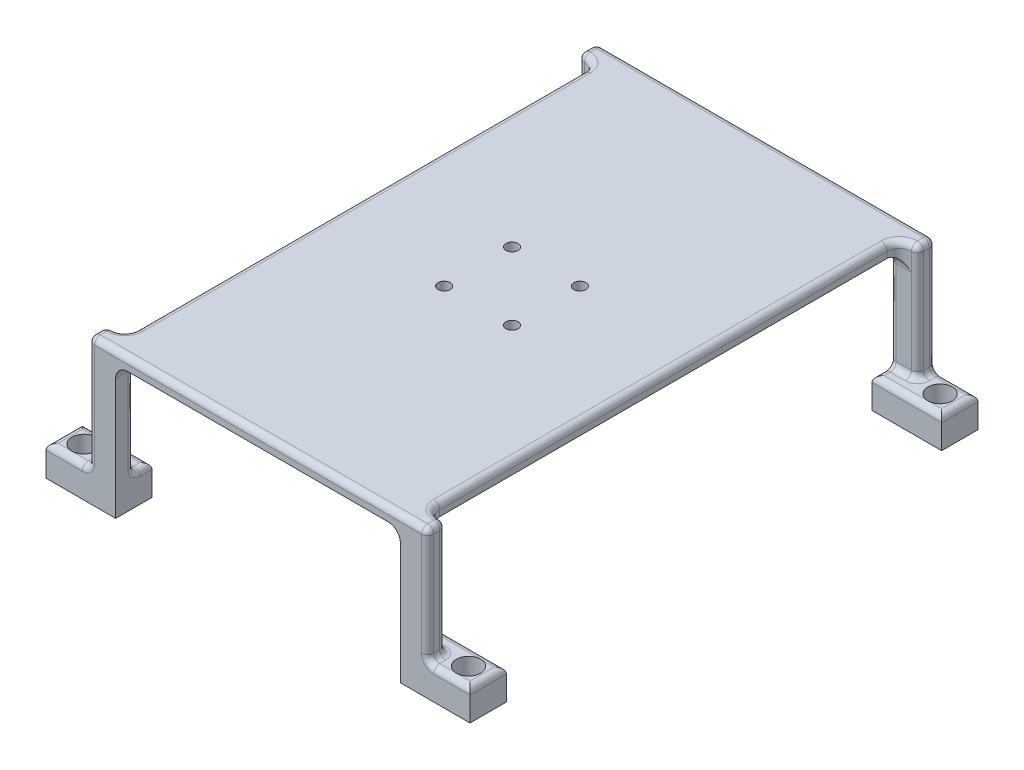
ISO-10303-21;
HEADER;
FILE_DESCRIPTION(('STEP AP214'),'2;1');
FILE_NAME('part.step','',(''),(''),'','','');
FILE_SCHEMA(('AUTOMOTIVE_DESIGN { 1 0 10303 214 1 1 1 1 }'));
ENDSEC;
DATA;
#1=APPLICATION_CONTEXT('core data for automotive mechanical design processes');
#2=APPLICATION_PROTOCOL_DEFINITION('international standard','automotive_design',2000,#1);
#3=PRODUCT_CONTEXT('',#1,'mechanical');
#4=PRODUCT('Part','Part','',(#3));
#5=PRODUCT_RELATED_PRODUCT_CATEGORY('part','',(#4));
#6=PRODUCT_DEFINITION_FORMATION('','',#4);
#7=PRODUCT_DEFINITION_CONTEXT('part definition',#1,'design');
#8=PRODUCT_DEFINITION('design','',#6,#7);
#9=PRODUCT_DEFINITION_SHAPE('','',#8);
#10=(LENGTH_UNIT() NAMED_UNIT(*) SI_UNIT(.MILLI.,.METRE.));
#11=(NAMED_UNIT(*) PLANE_ANGLE_UNIT() SI_UNIT($,.RADIAN.));
#12=(NAMED_UNIT(*) SI_UNIT($,.STERADIAN.) SOLID_ANGLE_UNIT());
#13=UNCERTAINTY_MEASURE_WITH_UNIT(LENGTH_MEASURE(1.E-05),#10,'distance_accuracy_value','');
#14=(GEOMETRIC_REPRESENTATION_CONTEXT(3) GLOBAL_UNCERTAINTY_ASSIGNED_CONTEXT((#13)) GLOBAL_UNIT_ASSIGNED_CONTEXT((#10,
#11,#12)) REPRESENTATION_CONTEXT('',''));
#15=CARTESIAN_POINT('',(0.,0.,0.));
#16=DIRECTION('',(0.,0.,1.));
#17=DIRECTION('',(1.,0.,0.));
#18=AXIS2_PLACEMENT_3D('',#15,#16,#17);
#19=CARTESIAN_POINT('',(0.,-17.,0.));
#20=DIRECTION('',(0.,1.,0.));
#21=DIRECTION('',(0.,0.,1.));
#22=AXIS2_PLACEMENT_3D('',#19,#20,#21);
#23=PLANE('',#22);
#24=DIRECTION('',(1.,0.,0.));
#25=VECTOR('',#24,1.);
#26=CARTESIAN_POINT('',(-35.,-17.,-40.93));
#27=LINE('',#26,#25);
#28=CARTESIAN_POINT('',(-31.75,-17.,-40.93));
#29=VERTEX_POINT('',#28);
#30=CARTESIAN_POINT('',(-34.,-17.,-40.93));
#31=VERTEX_POINT('',#30);
#32=EDGE_CURVE('E113',#29,#31,#27,.F.);
#33=ORIENTED_EDGE('',*,*,#32,.T.);
#34=DIRECTION('',(0.,0.,-1.));
#35=VECTOR('',#34,1.);
#36=CARTESIAN_POINT('',(-34.,-17.,0.));
#37=LINE('',#36,#35);
#38=CARTESIAN_POINT('',(-34.,-17.,-36.93));
#39=VERTEX_POINT('',#38);
#40=EDGE_CURVE('E105',#31,#39,#37,.F.);
#41=ORIENTED_EDGE('',*,*,#40,.T.);
#42=DIRECTION('',(-1.,0.,0.));
#43=VECTOR('',#42,1.);
#44=CARTESIAN_POINT('',(0.,-17.,-36.93));
#45=LINE('',#44,#43);
#46=CARTESIAN_POINT('',(-31.75,-17.,-36.93));
#47=VERTEX_POINT('',#46);
#48=EDGE_CURVE('E1299',#39,#47,#45,.F.);
#49=ORIENTED_EDGE('',*,*,#48,.T.);
#50=CARTESIAN_POINT('',(-31.75,-17.,-38.93));
#51=DIRECTION('',(0.,1.,0.));
#52=DIRECTION('',(0.,0.,1.));
#53=AXIS2_PLACEMENT_3D('',#50,#51,#52);
#54=CIRCLE('',#53,2.);
#55=EDGE_CURVE('E1510',#29,#47,#54,.T.);
#56=ORIENTED_EDGE('',*,*,#55,.F.);
#57=EDGE_LOOP('',(#33,#41,#49,#56));
#58=FACE_BOUND('',#57,.T.);
#59=ADVANCED_FACE('F91',(#58),#23,.T.);
#60=CARTESIAN_POINT('',(0.,-17.,0.));
#61=DIRECTION('',(0.,-1.,0.));
#62=DIRECTION('',(0.,0.,-1.));
#63=AXIS2_PLACEMENT_3D('',#60,#61,#62);
#64=PLANE('',#63);
#65=CARTESIAN_POINT('',(-27.,-17.,39.93));
#66=DIRECTION('',(0.,-1.,0.));
#67=DIRECTION('',(0.,0.,-1.));
#68=AXIS2_PLACEMENT_3D('',#65,#66,#67);
#69=CIRCLE('',#68,2.);
#70=CARTESIAN_POINT('',(-27.,-17.,37.93));
#71=VERTEX_POINT('',#70);
#72=CARTESIAN_POINT('',(-29.,-17.,39.93));
#73=VERTEX_POINT('',#72);
#74=EDGE_CURVE('E1212',#71,#73,#69,.F.);
#75=ORIENTED_EDGE('',*,*,#74,.F.);
#76=DIRECTION('',(-1.,0.,0.));
#77=VECTOR('',#76,1.);
#78=CARTESIAN_POINT('',(-23.5,-17.,37.93));
#79=LINE('',#78,#77);
#80=CARTESIAN_POINT('',(-24.5,-17.,37.93));
#81=VERTEX_POINT('',#80);
#82=EDGE_CURVE('E1219',#71,#81,#79,.F.);
#83=ORIENTED_EDGE('',*,*,#82,.T.);
#84=DIRECTION('',(0.,0.,1.));
#85=VECTOR('',#84,1.);
#86=CARTESIAN_POINT('',(-24.5,-17.,0.));
#87=LINE('',#86,#85);
#88=CARTESIAN_POINT('',(-24.5,-17.,36.93));
#89=VERTEX_POINT('',#88);
#90=EDGE_CURVE('E1216',#81,#89,#87,.F.);
#91=ORIENTED_EDGE('',*,*,#90,.T.);
#92=DIRECTION('',(1.,0.,0.));
#93=VECTOR('',#92,1.);
#94=CARTESIAN_POINT('',(-35.,-17.,36.93));
#95=LINE('',#94,#93);
#96=CARTESIAN_POINT('',(-31.7500000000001,-17.,36.93));
#97=VERTEX_POINT('',#96);
#98=EDGE_CURVE('E1209',#89,#97,#95,.F.);
#99=ORIENTED_EDGE('',*,*,#98,.T.);
#100=CARTESIAN_POINT('',(-31.7500000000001,-17.,38.9299999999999));
#101=DIRECTION('',(0.,1.,0.));
#102=DIRECTION('',(0.,0.,-1.));
#103=AXIS2_PLACEMENT_3D('',#100,#101,#102);
#104=CIRCLE('',#103,2.);
#105=CARTESIAN_POINT('',(-31.7500000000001,-17.,40.93));
#106=VERTEX_POINT('',#105);
#107=EDGE_CURVE('E1815',#106,#97,#104,.T.);
#108=ORIENTED_EDGE('',*,*,#107,.F.);
#109=DIRECTION('',(-1.,0.,0.));
#110=VECTOR('',#109,1.);
#111=CARTESIAN_POINT('',(-28.,-17.,40.93));
#112=LINE('',#111,#110);
#113=CARTESIAN_POINT('',(-29.,-17.,40.93));
#114=VERTEX_POINT('',#113);
#115=EDGE_CURVE('E1194',#106,#114,#112,.F.);
#116=ORIENTED_EDGE('',*,*,#115,.T.);
#117=DIRECTION('',(0.,0.,1.));
#118=VECTOR('',#117,1.);
#119=CARTESIAN_POINT('',(-29.,-17.,0.));
#120=LINE('',#119,#118);
#121=EDGE_CURVE('E1200',#114,#73,#120,.F.);
#122=ORIENTED_EDGE('',*,*,#121,.T.);
#123=EDGE_LOOP('',(#75,#83,#91,#99,#108,#116,#122));
#124=FACE_BOUND('',#123,.T.);
#125=ADVANCED_FACE('F1475',(#124),#64,.F.);
#126=CARTESIAN_POINT('',(0.,-17.,0.));
#127=DIRECTION('',(0.,1.,0.));
#128=DIRECTION('',(0.,0.,1.));
#129=AXIS2_PLACEMENT_3D('',#126,#127,#128);
#130=PLANE('',#129);
#131=CARTESIAN_POINT('',(27.,-17.,39.93));
#132=DIRECTION('',(0.,1.,0.));
#133=DIRECTION('',(0.,0.,1.));
#134=AXIS2_PLACEMENT_3D('',#131,#132,#133);
#135=CIRCLE('',#134,2.);
#136=CARTESIAN_POINT('',(29.,-17.,39.93));
#137=VERTEX_POINT('',#136);
#138=CARTESIAN_POINT('',(27.,-17.,37.93));
#139=VERTEX_POINT('',#138);
#140=EDGE_CURVE('E1190',#137,#139,#135,.T.);
#141=ORIENTED_EDGE('',*,*,#140,.F.);
#142=DIRECTION('',(0.,0.,-1.));
#143=VECTOR('',#142,1.);
#144=CARTESIAN_POINT('',(29.,-17.,0.));
#145=LINE('',#144,#143);
#146=CARTESIAN_POINT('',(29.,-17.,40.93));
#147=VERTEX_POINT('',#146);
#148=EDGE_CURVE('E1187',#137,#147,#145,.F.);
#149=ORIENTED_EDGE('',*,*,#148,.T.);
#150=DIRECTION('',(-1.,0.,0.));
#151=VECTOR('',#150,1.);
#152=CARTESIAN_POINT('',(0.,-17.,40.93));
#153=LINE('',#152,#151);
#154=CARTESIAN_POINT('',(31.7499999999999,-17.,40.93));
#155=VERTEX_POINT('',#154);
#156=EDGE_CURVE('E1180',#147,#155,#153,.F.);
#157=ORIENTED_EDGE('',*,*,#156,.T.);
#158=CARTESIAN_POINT('',(31.7499999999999,-17.,38.93));
#159=DIRECTION('',(0.,1.,0.));
#160=DIRECTION('',(0.,0.,1.));
#161=AXIS2_PLACEMENT_3D('',#158,#159,#160);
#162=CIRCLE('',#161,2.);
#163=CARTESIAN_POINT('',(31.7499999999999,-17.,36.93));
#164=VERTEX_POINT('',#163);
#165=EDGE_CURVE('E1826',#164,#155,#162,.T.);
#166=ORIENTED_EDGE('',*,*,#165,.F.);
#167=DIRECTION('',(1.,0.,0.));
#168=VECTOR('',#167,1.);
#169=CARTESIAN_POINT('',(0.,-17.,36.93));
#170=LINE('',#169,#168);
#171=CARTESIAN_POINT('',(24.5,-17.,36.93));
#172=VERTEX_POINT('',#171);
#173=EDGE_CURVE('E1168',#164,#172,#170,.F.);
#174=ORIENTED_EDGE('',*,*,#173,.T.);
#175=DIRECTION('',(0.,0.,-1.));
#176=VECTOR('',#175,1.);
#177=CARTESIAN_POINT('',(24.5,-17.,38.93));
#178=LINE('',#177,#176);
#179=CARTESIAN_POINT('',(24.5,-17.,37.93));
#180=VERTEX_POINT('',#179);
#181=EDGE_CURVE('E1165',#172,#180,#178,.F.);
#182=ORIENTED_EDGE('',*,*,#181,.T.);
#183=DIRECTION('',(-1.,0.,0.));
#184=VECTOR('',#183,1.);
#185=CARTESIAN_POINT('',(28.,-17.,37.93));
#186=LINE('',#185,#184);
#187=EDGE_CURVE('E1183',#180,#139,#186,.F.);
#188=ORIENTED_EDGE('',*,*,#187,.T.);
#189=EDGE_LOOP('',(#141,#149,#157,#166,#174,#182,#188));
#190=FACE_BOUND('',#189,.T.);
#191=ADVANCED_FACE('F1482',(#190),#130,.T.);
#192=CARTESIAN_POINT('',(0.,-17.,0.));
#193=DIRECTION('',(0.,-1.,0.));
#194=DIRECTION('',(0.,0.,-1.));
#195=AXIS2_PLACEMENT_3D('',#192,#193,#194);
#196=PLANE('',#195);
#197=CARTESIAN_POINT('',(31.75,-17.,-38.93));
#198=DIRECTION('',(0.,1.,0.));
#199=DIRECTION('',(0.,0.,-1.));
#200=AXIS2_PLACEMENT_3D('',#197,#198,#199);
#201=CIRCLE('',#200,2.);
#202=CARTESIAN_POINT('',(31.75,-17.,-36.93));
#203=VERTEX_POINT('',#202);
#204=CARTESIAN_POINT('',(31.75,-17.,-40.9299999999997));
#205=VERTEX_POINT('',#204);
#206=EDGE_CURVE('E1837',#203,#205,#201,.T.);
#207=ORIENTED_EDGE('',*,*,#206,.F.);
#208=DIRECTION('',(-1.,0.,0.));
#209=VECTOR('',#208,1.);
#210=CARTESIAN_POINT('',(35.,-17.,-36.93));
#211=LINE('',#210,#209);
#212=CARTESIAN_POINT('',(34.,-17.,-36.93));
#213=VERTEX_POINT('',#212);
#214=EDGE_CURVE('E1133',#203,#213,#211,.F.);
#215=ORIENTED_EDGE('',*,*,#214,.T.);
#216=DIRECTION('',(0.,0.,1.));
#217=VECTOR('',#216,1.);
#218=CARTESIAN_POINT('',(34.,-17.,-41.93));
#219=LINE('',#218,#217);
#220=CARTESIAN_POINT('',(34.,-17.,-40.9299999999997));
#221=VERTEX_POINT('',#220);
#222=EDGE_CURVE('E1130',#213,#221,#219,.F.);
#223=ORIENTED_EDGE('',*,*,#222,.T.);
#224=DIRECTION('',(1.,0.,0.));
#225=VECTOR('',#224,1.);
#226=CARTESIAN_POINT('',(1.89339284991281E-13,-17.,-40.9299999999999));
#227=LINE('',#226,#225);
#228=EDGE_CURVE('E1117',#221,#205,#227,.F.);
#229=ORIENTED_EDGE('',*,*,#228,.T.);
#230=EDGE_LOOP('',(#207,#215,#223,#229));
#231=FACE_BOUND('',#230,.T.);
#232=ADVANCED_FACE('F2074',(#231),#196,.F.);
#233=CARTESIAN_POINT('',(25.,2.,-38.93));
#234=DIRECTION('',(0.,0.,-1.));
#235=DIRECTION('',(-1.,0.,0.));
#236=AXIS2_PLACEMENT_3D('',#233,#234,#235);
#237=PLANE('',#236);
#238=DIRECTION('',(-1.,0.,0.));
#239=VECTOR('',#238,1.);
#240=CARTESIAN_POINT('',(23.5,-2.,-38.93));
#241=LINE('',#240,#239);
#242=CARTESIAN_POINT('',(27.,-2.,-38.93));
#243=VERTEX_POINT('',#242);
#244=CARTESIAN_POINT('',(24.5,-2.,-38.93));
#245=VERTEX_POINT('',#244);
#246=EDGE_CURVE('E786',#243,#245,#241,.T.);
#247=ORIENTED_EDGE('',*,*,#246,.T.);
#248=DIRECTION('',(0.,1.,0.));
#249=VECTOR('',#248,1.);
#250=CARTESIAN_POINT('',(24.5,2.,-38.93));
#251=LINE('',#250,#249);
#252=CARTESIAN_POINT('',(24.5,-16.,-38.93));
#253=VERTEX_POINT('',#252);
#254=EDGE_CURVE('E1007',#245,#253,#251,.F.);
#255=ORIENTED_EDGE('',*,*,#254,.T.);
#256=DIRECTION('',(1.,0.,0.));
#257=VECTOR('',#256,1.);
#258=CARTESIAN_POINT('',(28.,-16.,-38.93));
#259=LINE('',#258,#257);
#260=CARTESIAN_POINT('',(27.,-16.,-38.93));
#261=VERTEX_POINT('',#260);
#262=EDGE_CURVE('E1004',#253,#261,#259,.T.);
#263=ORIENTED_EDGE('',*,*,#262,.T.);
#264=DIRECTION('',(0.,-1.,0.));
#265=VECTOR('',#264,1.);
#266=CARTESIAN_POINT('',(27.,1.,-38.93));
#267=LINE('',#266,#265);
#268=EDGE_CURVE('E1001',#261,#243,#267,.F.);
#269=ORIENTED_EDGE('',*,*,#268,.T.);
#270=EDGE_LOOP('',(#247,#255,#263,#269));
#271=FACE_BOUND('',#270,.T.);
#272=ADVANCED_FACE('F2078',(#271),#237,.F.);
#273=CARTESIAN_POINT('',(28.,2.,-41.93));
#274=DIRECTION('',(1.,0.,0.));
#275=DIRECTION('',(0.,0.,-1.));
#276=AXIS2_PLACEMENT_3D('',#273,#274,#275);
#277=PLANE('',#276);
#278=DIRECTION('',(0.,0.,-1.));
#279=VECTOR('',#278,1.);
#280=CARTESIAN_POINT('',(28.,-16.,-41.93));
#281=LINE('',#280,#279);
#282=CARTESIAN_POINT('',(28.,-16.,-39.93));
#283=VERTEX_POINT('',#282);
#284=CARTESIAN_POINT('',(28.,-16.,-40.9299999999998));
#285=VERTEX_POINT('',#284);
#286=EDGE_CURVE('E1098',#283,#285,#281,.T.);
#287=ORIENTED_EDGE('',*,*,#286,.T.);
#288=DIRECTION('',(0.,-1.,0.));
#289=VECTOR('',#288,1.);
#290=CARTESIAN_POINT('',(28.,1.,-40.9299999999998));
#291=LINE('',#290,#289);
#292=CARTESIAN_POINT('',(28.,1.,-40.9299999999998));
#293=VERTEX_POINT('',#292);
#294=EDGE_CURVE('E1104',#285,#293,#291,.F.);
#295=ORIENTED_EDGE('',*,*,#294,.T.);
#296=DIRECTION('',(0.,0.,1.));
#297=VECTOR('',#296,1.);
#298=CARTESIAN_POINT('',(28.,1.,-41.93));
#299=LINE('',#298,#297);
#300=CARTESIAN_POINT('',(28.,1.,-39.93));
#301=VERTEX_POINT('',#300);
#302=EDGE_CURVE('E898',#293,#301,#299,.T.);
#303=ORIENTED_EDGE('',*,*,#302,.T.);
#304=DIRECTION('',(0.,-1.,0.));
#305=VECTOR('',#304,1.);
#306=CARTESIAN_POINT('',(28.,-17.,-39.93));
#307=LINE('',#306,#305);
#308=EDGE_CURVE('E1101',#301,#283,#307,.T.);
#309=ORIENTED_EDGE('',*,*,#308,.T.);
#310=EDGE_LOOP('',(#287,#295,#303,#309));
#311=FACE_BOUND('',#310,.T.);
#312=ADVANCED_FACE('F1970',(#311),#277,.T.);
#313=CARTESIAN_POINT('',(0.,2.,38.93));
#314=DIRECTION('',(0.,0.,1.));
#315=DIRECTION('',(1.,0.,0.));
#316=AXIS2_PLACEMENT_3D('',#313,#314,#315);
#317=PLANE('',#316);
#318=DIRECTION('',(1.,0.,0.));
#319=VECTOR('',#318,1.);
#320=CARTESIAN_POINT('',(-23.5,-2.,38.93));
#321=LINE('',#320,#319);
#322=CARTESIAN_POINT('',(-27.,-2.,38.93));
#323=VERTEX_POINT('',#322);
#324=CARTESIAN_POINT('',(-24.5,-2.,38.93));
#325=VERTEX_POINT('',#324);
#326=EDGE_CURVE('E760',#323,#325,#321,.T.);
#327=ORIENTED_EDGE('',*,*,#326,.T.);
#328=DIRECTION('',(0.,1.,0.));
#329=VECTOR('',#328,1.);
#330=CARTESIAN_POINT('',(-24.5,2.,38.93));
#331=LINE('',#330,#329);
#332=CARTESIAN_POINT('',(-24.5,-16.,38.93));
#333=VERTEX_POINT('',#332);
#334=EDGE_CURVE('E1057',#325,#333,#331,.F.);
#335=ORIENTED_EDGE('',*,*,#334,.T.);
#336=DIRECTION('',(-1.,0.,0.));
#337=VECTOR('',#336,1.);
#338=CARTESIAN_POINT('',(-28.,-16.,38.93));
#339=LINE('',#338,#337);
#340=CARTESIAN_POINT('',(-27.,-16.,38.93));
#341=VERTEX_POINT('',#340);
#342=EDGE_CURVE('E1054',#333,#341,#339,.T.);
#343=ORIENTED_EDGE('',*,*,#342,.T.);
#344=DIRECTION('',(0.,-1.,0.));
#345=VECTOR('',#344,1.);
#346=CARTESIAN_POINT('',(-27.,1.,38.93));
#347=LINE('',#346,#345);
#348=EDGE_CURVE('E1051',#341,#323,#347,.F.);
#349=ORIENTED_EDGE('',*,*,#348,.T.);
#350=EDGE_LOOP('',(#327,#335,#343,#349));
#351=FACE_BOUND('',#350,.T.);
#352=ADVANCED_FACE('F1736',(#351),#317,.F.);
#353=CARTESIAN_POINT('',(-28.,2.,0.));
#354=DIRECTION('',(-1.,0.,0.));
#355=DIRECTION('',(0.,0.,1.));
#356=AXIS2_PLACEMENT_3D('',#353,#354,#355);
#357=PLANE('',#356);
#358=DIRECTION('',(0.,0.,1.));
#359=VECTOR('',#358,1.);
#360=CARTESIAN_POINT('',(-28.,-16.,0.));
#361=LINE('',#360,#359);
#362=CARTESIAN_POINT('',(-28.,-16.,39.93));
#363=VERTEX_POINT('',#362);
#364=CARTESIAN_POINT('',(-28.,-16.,40.93));
#365=VERTEX_POINT('',#364);
#366=EDGE_CURVE('E1223',#363,#365,#361,.T.);
#367=ORIENTED_EDGE('',*,*,#366,.T.);
#368=DIRECTION('',(0.,-1.,0.));
#369=VECTOR('',#368,1.);
#370=CARTESIAN_POINT('',(-28.,2.,40.93));
#371=LINE('',#370,#369);
#372=CARTESIAN_POINT('',(-28.,1.,40.93));
#373=VERTEX_POINT('',#372);
#374=EDGE_CURVE('E1229',#365,#373,#371,.F.);
#375=ORIENTED_EDGE('',*,*,#374,.T.);
#376=DIRECTION('',(0.,0.,-1.));
#377=VECTOR('',#376,1.);
#378=CARTESIAN_POINT('',(-28.,1.,0.));
#379=LINE('',#378,#377);
#380=CARTESIAN_POINT('',(-28.,1.,39.93));
#381=VERTEX_POINT('',#380);
#382=EDGE_CURVE('E913',#373,#381,#379,.T.);
#383=ORIENTED_EDGE('',*,*,#382,.T.);
#384=DIRECTION('',(0.,-1.,0.));
#385=VECTOR('',#384,1.);
#386=CARTESIAN_POINT('',(-28.,-17.,39.93));
#387=LINE('',#386,#385);
#388=EDGE_CURVE('E1226',#381,#363,#387,.T.);
#389=ORIENTED_EDGE('',*,*,#388,.T.);
#390=EDGE_LOOP('',(#367,#375,#383,#389));
#391=FACE_BOUND('',#390,.T.);
#392=ADVANCED_FACE('F2826',(#391),#357,.T.);
#393=CARTESIAN_POINT('',(0.,0.,0.));
#394=DIRECTION('',(0.,1.,0.));
#395=DIRECTION('',(0.,0.,1.));
#396=AXIS2_PLACEMENT_3D('',#393,#394,#395);
#397=PLANE('',#396);
#398=CARTESIAN_POINT('',(-5.6,0.,5.6));
#399=DIRECTION('',(0.,1.,0.));
#400=DIRECTION('',(0.,0.,1.));
#401=AXIS2_PLACEMENT_3D('',#398,#399,#400);
#402=CIRCLE('',#401,1.);
#403=CARTESIAN_POINT('',(-5.6,0.,6.6));
#404=VERTEX_POINT('',#403);
#405=EDGE_CURVE('E1619',#404,#404,#402,.T.);
#406=ORIENTED_EDGE('',*,*,#405,.T.);
#407=EDGE_LOOP('',(#406));
#408=FACE_BOUND('',#407,.T.);
#409=CARTESIAN_POINT('',(5.6,0.,5.6));
#410=DIRECTION('',(0.,1.,0.));
#411=DIRECTION('',(0.,0.,1.));
#412=AXIS2_PLACEMENT_3D('',#409,#410,#411);
#413=CIRCLE('',#412,1.);
#414=CARTESIAN_POINT('',(5.6,0.,6.6));
#415=VERTEX_POINT('',#414);
#416=EDGE_CURVE('E1854',#415,#415,#413,.T.);
#417=ORIENTED_EDGE('',*,*,#416,.T.);
#418=EDGE_LOOP('',(#417));
#419=FACE_BOUND('',#418,.T.);
#420=CARTESIAN_POINT('',(5.6,0.,-5.6));
#421=DIRECTION('',(0.,1.,0.));
#422=DIRECTION('',(0.,0.,1.));
#423=AXIS2_PLACEMENT_3D('',#420,#421,#422);
#424=CIRCLE('',#423,1.);
#425=CARTESIAN_POINT('',(5.6,0.,-4.6));
#426=VERTEX_POINT('',#425);
#427=EDGE_CURVE('E1858',#426,#426,#424,.T.);
#428=ORIENTED_EDGE('',*,*,#427,.T.);
#429=EDGE_LOOP('',(#428));
#430=FACE_BOUND('',#429,.T.);
#431=CARTESIAN_POINT('',(-5.6,0.,-5.6));
#432=DIRECTION('',(0.,1.,0.));
#433=DIRECTION('',(0.,0.,1.));
#434=AXIS2_PLACEMENT_3D('',#431,#432,#433);
#435=CIRCLE('',#434,1.);
#436=CARTESIAN_POINT('',(-5.6,0.,-4.6));
#437=VERTEX_POINT('',#436);
#438=EDGE_CURVE('E1862',#437,#437,#435,.T.);
#439=ORIENTED_EDGE('',*,*,#438,.T.);
#440=EDGE_LOOP('',(#439));
#441=FACE_BOUND('',#440,.T.);
#442=DIRECTION('',(-1.,0.,0.));
#443=VECTOR('',#442,1.);
#444=CARTESIAN_POINT('',(0.,0.,41.93));
#445=LINE('',#444,#443);
#446=CARTESIAN_POINT('',(21.5,0.,41.93));
#447=VERTEX_POINT('',#446);
#448=CARTESIAN_POINT('',(-21.5,0.,41.93));
#449=VERTEX_POINT('',#448);
#450=EDGE_CURVE('E721',#447,#449,#445,.T.);
#451=ORIENTED_EDGE('',*,*,#450,.T.);
#452=DIRECTION('',(0.,0.,1.));
#453=VECTOR('',#452,1.);
#454=CARTESIAN_POINT('',(-21.5,0.,38.93));
#455=LINE('',#454,#453);
#456=CARTESIAN_POINT('',(-21.5,0.,36.93));
#457=VERTEX_POINT('',#456);
#458=EDGE_CURVE('E756',#449,#457,#455,.F.);
#459=ORIENTED_EDGE('',*,*,#458,.T.);
#460=DIRECTION('',(1.,0.,0.));
#461=VECTOR('',#460,1.);
#462=CARTESIAN_POINT('',(-25.,0.,36.93));
#463=LINE('',#462,#461);
#464=CARTESIAN_POINT('',(-25.,0.,36.93));
#465=VERTEX_POINT('',#464);
#466=EDGE_CURVE('E753',#457,#465,#463,.F.);
#467=ORIENTED_EDGE('',*,*,#466,.T.);
#468=DIRECTION('',(0.,0.,-1.));
#469=VECTOR('',#468,1.);
#470=CARTESIAN_POINT('',(-25.,0.,0.));
#471=LINE('',#470,#469);
#472=CARTESIAN_POINT('',(-25.,0.,-36.93));
#473=VERTEX_POINT('',#472);
#474=EDGE_CURVE('E717',#465,#473,#471,.T.);
#475=ORIENTED_EDGE('',*,*,#474,.T.);
#476=DIRECTION('',(-1.,0.,0.));
#477=VECTOR('',#476,1.);
#478=CARTESIAN_POINT('',(0.,0.,-36.93));
#479=LINE('',#478,#477);
#480=CARTESIAN_POINT('',(-21.5,0.,-36.93));
#481=VERTEX_POINT('',#480);
#482=EDGE_CURVE('E749',#473,#481,#479,.F.);
#483=ORIENTED_EDGE('',*,*,#482,.T.);
#484=DIRECTION('',(0.,0.,1.));
#485=VECTOR('',#484,1.);
#486=CARTESIAN_POINT('',(-21.5,0.,-41.93));
#487=LINE('',#486,#485);
#488=CARTESIAN_POINT('',(-21.5,0.,-41.93));
#489=VERTEX_POINT('',#488);
#490=EDGE_CURVE('E746',#481,#489,#487,.F.);
#491=ORIENTED_EDGE('',*,*,#490,.T.);
#492=DIRECTION('',(-1.,0.,0.));
#493=VECTOR('',#492,1.);
#494=CARTESIAN_POINT('',(1.93965214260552E-13,0.,-41.9299999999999));
#495=LINE('',#494,#493);
#496=CARTESIAN_POINT('',(21.5,0.,-41.9299999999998));
#497=VERTEX_POINT('',#496);
#498=EDGE_CURVE('E713',#497,#489,#495,.T.);
#499=ORIENTED_EDGE('',*,*,#498,.F.);
#500=DIRECTION('',(0.,0.,-1.));
#501=VECTOR('',#500,1.);
#502=CARTESIAN_POINT('',(21.5,0.,-38.93));
#503=LINE('',#502,#501);
#504=CARTESIAN_POINT('',(21.5,0.,-36.93));
#505=VERTEX_POINT('',#504);
#506=EDGE_CURVE('E739',#497,#505,#503,.F.);
#507=ORIENTED_EDGE('',*,*,#506,.T.);
#508=DIRECTION('',(-1.,0.,0.));
#509=VECTOR('',#508,1.);
#510=CARTESIAN_POINT('',(25.,0.,-36.93));
#511=LINE('',#510,#509);
#512=CARTESIAN_POINT('',(25.,0.,-36.93));
#513=VERTEX_POINT('',#512);
#514=EDGE_CURVE('E743',#505,#513,#511,.F.);
#515=ORIENTED_EDGE('',*,*,#514,.T.);
#516=DIRECTION('',(0.,0.,-1.));
#517=VECTOR('',#516,1.);
#518=CARTESIAN_POINT('',(25.,0.,0.));
#519=LINE('',#518,#517);
#520=CARTESIAN_POINT('',(25.,0.,36.93));
#521=VERTEX_POINT('',#520);
#522=EDGE_CURVE('E725',#521,#513,#519,.T.);
#523=ORIENTED_EDGE('',*,*,#522,.F.);
#524=DIRECTION('',(1.,0.,0.));
#525=VECTOR('',#524,1.);
#526=CARTESIAN_POINT('',(0.,0.,36.93));
#527=LINE('',#526,#525);
#528=CARTESIAN_POINT('',(21.5,0.,36.93));
#529=VERTEX_POINT('',#528);
#530=EDGE_CURVE('E735',#521,#529,#527,.F.);
#531=ORIENTED_EDGE('',*,*,#530,.T.);
#532=DIRECTION('',(0.,0.,-1.));
#533=VECTOR('',#532,1.);
#534=CARTESIAN_POINT('',(21.5,0.,41.93));
#535=LINE('',#534,#533);
#536=EDGE_CURVE('E732',#529,#447,#535,.F.);
#537=ORIENTED_EDGE('',*,*,#536,.T.);
#538=EDGE_LOOP('',(#451,#459,#467,#475,#483,#491,#499,#507,#515,#523,#531,#537));
#539=FACE_BOUND('',#538,.T.);
#540=ADVANCED_FACE('F1560',(#408,#419,#430,#441,#539),#397,.F.);
#541=CARTESIAN_POINT('',(25.,2.,0.));
#542=DIRECTION('',(-1.,0.,0.));
#543=DIRECTION('',(0.,0.,1.));
#544=AXIS2_PLACEMENT_3D('',#541,#542,#543);
#545=PLANE('',#544);
#546=DIRECTION('',(0.,-1.,0.));
#547=VECTOR('',#546,1.);
#548=CARTESIAN_POINT('',(25.,2.,-36.93));
#549=LINE('',#548,#547);
#550=CARTESIAN_POINT('',(25.,1.,-36.93));
#551=VERTEX_POINT('',#550);
#552=EDGE_CURVE('E797',#513,#551,#549,.F.);
#553=ORIENTED_EDGE('',*,*,#552,.T.);
#554=DIRECTION('',(0.,0.,-1.));
#555=VECTOR('',#554,1.);
#556=CARTESIAN_POINT('',(25.,1.,36.93));
#557=LINE('',#556,#555);
#558=CARTESIAN_POINT('',(25.,1.,36.93));
#559=VERTEX_POINT('',#558);
#560=EDGE_CURVE('E902',#551,#559,#557,.F.);
#561=ORIENTED_EDGE('',*,*,#560,.T.);
#562=DIRECTION('',(0.,-1.,0.));
#563=VECTOR('',#562,1.);
#564=CARTESIAN_POINT('',(25.,2.,36.93));
#565=LINE('',#564,#563);
#566=EDGE_CURVE('E794',#559,#521,#565,.T.);
#567=ORIENTED_EDGE('',*,*,#566,.T.);
#568=ORIENTED_EDGE('',*,*,#522,.T.);
#569=EDGE_LOOP('',(#553,#561,#567,#568));
#570=FACE_BOUND('',#569,.T.);
#571=ADVANCED_FACE('F1949',(#570),#545,.F.);
#572=CARTESIAN_POINT('',(1.93965214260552E-13,2.,-41.9299999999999));
#573=DIRECTION('',(0.,0.,1.));
#574=DIRECTION('',(1.,0.,0.));
#575=AXIS2_PLACEMENT_3D('',#572,#573,#574);
#576=PLANE('',#575);
#577=DIRECTION('',(-1.,0.,0.));
#578=VECTOR('',#577,1.);
#579=CARTESIAN_POINT('',(28.,1.,-41.9299999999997));
#580=LINE('',#579,#578);
#581=CARTESIAN_POINT('',(-27.,1.,-41.93));
#582=VERTEX_POINT('',#581);
#583=CARTESIAN_POINT('',(27.,1.,-41.9299999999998));
#584=VERTEX_POINT('',#583);
#585=EDGE_CURVE('E920',#582,#584,#580,.F.);
#586=ORIENTED_EDGE('',*,*,#585,.T.);
#587=DIRECTION('',(0.,-1.,0.));
#588=VECTOR('',#587,1.);
#589=CARTESIAN_POINT('',(27.,-17.,-41.9299999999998));
#590=LINE('',#589,#588);
#591=CARTESIAN_POINT('',(27.,-16.,-41.9299999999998));
#592=VERTEX_POINT('',#591);
#593=EDGE_CURVE('E1095',#584,#592,#590,.T.);
#594=ORIENTED_EDGE('',*,*,#593,.T.);
#595=CARTESIAN_POINT('',(29.,-16.,-41.9299999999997));
#596=DIRECTION('',(0.,0.,1.));
#597=DIRECTION('',(1.,0.,0.));
#598=AXIS2_PLACEMENT_3D('',#595,#596,#597);
#599=CIRCLE('',#598,2.);
#600=CARTESIAN_POINT('',(29.,-18.,-41.9299999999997));
#601=VERTEX_POINT('',#600);
#602=EDGE_CURVE('E1091',#601,#592,#599,.F.);
#603=ORIENTED_EDGE('',*,*,#602,.F.);
#604=DIRECTION('',(1.,0.,0.));
#605=VECTOR('',#604,1.);
#606=CARTESIAN_POINT('',(1.93965214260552E-13,-18.,-41.9299999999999));
#607=LINE('',#606,#605);
#608=CARTESIAN_POINT('',(35.,-18.,-41.93));
#609=VERTEX_POINT('',#608);
#610=EDGE_CURVE('E1088',#601,#609,#607,.T.);
#611=ORIENTED_EDGE('',*,*,#610,.T.);
#612=DIRECTION('',(0.,-1.,0.));
#613=VECTOR('',#612,1.);
#614=CARTESIAN_POINT('',(35.,-17.,-41.93));
#615=LINE('',#614,#613);
#616=CARTESIAN_POINT('',(35.,-22.,-41.93));
#617=VERTEX_POINT('',#616);
#618=EDGE_CURVE('E629',#609,#617,#615,.T.);
#619=ORIENTED_EDGE('',*,*,#618,.T.);
#620=DIRECTION('',(1.,0.,0.));
#621=VECTOR('',#620,1.);
#622=CARTESIAN_POINT('',(28.,-22.,-41.93));
#623=LINE('',#622,#621);
#624=CARTESIAN_POINT('',(23.5,-22.,-41.93));
#625=VERTEX_POINT('',#624);
#626=EDGE_CURVE('E684',#625,#617,#623,.T.);
#627=ORIENTED_EDGE('',*,*,#626,.F.);
#628=DIRECTION('',(0.,1.,0.));
#629=VECTOR('',#628,1.);
#630=CARTESIAN_POINT('',(23.5,-22.,-41.93));
#631=LINE('',#630,#629);
#632=CARTESIAN_POINT('',(23.5,-2.,-41.93));
#633=VERTEX_POINT('',#632);
#634=EDGE_CURVE('E609',#625,#633,#631,.T.);
#635=ORIENTED_EDGE('',*,*,#634,.T.);
#636=CARTESIAN_POINT('',(21.5,-2.,-41.9299999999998));
#637=DIRECTION('',(0.,0.,1.));
#638=DIRECTION('',(1.,0.,0.));
#639=AXIS2_PLACEMENT_3D('',#636,#637,#638);
#640=CIRCLE('',#639,2.);
#641=EDGE_CURVE('E821',#633,#497,#640,.T.);
#642=ORIENTED_EDGE('',*,*,#641,.T.);
#643=ORIENTED_EDGE('',*,*,#498,.T.);
#644=CARTESIAN_POINT('',(-21.5,-2.,-41.93));
#645=DIRECTION('',(0.,0.,1.));
#646=DIRECTION('',(1.,0.,0.));
#647=AXIS2_PLACEMENT_3D('',#644,#645,#646);
#648=CIRCLE('',#647,2.);
#649=CARTESIAN_POINT('',(-23.5,-2.,-41.93));
#650=VERTEX_POINT('',#649);
#651=EDGE_CURVE('E818',#489,#650,#648,.T.);
#652=ORIENTED_EDGE('',*,*,#651,.T.);
#653=DIRECTION('',(0.,1.,0.));
#654=VECTOR('',#653,1.);
#655=CARTESIAN_POINT('',(-23.5,-22.,-41.93));
#656=LINE('',#655,#654);
#657=CARTESIAN_POINT('',(-23.5,-22.,-41.93));
#658=VERTEX_POINT('',#657);
#659=EDGE_CURVE('E691',#658,#650,#656,.T.);
#660=ORIENTED_EDGE('',*,*,#659,.F.);
#661=DIRECTION('',(1.,0.,0.));
#662=VECTOR('',#661,1.);
#663=CARTESIAN_POINT('',(-28.,-22.,-41.93));
#664=LINE('',#663,#662);
#665=CARTESIAN_POINT('',(-35.,-22.,-41.93));
#666=VERTEX_POINT('',#665);
#667=EDGE_CURVE('E699',#666,#658,#664,.T.);
#668=ORIENTED_EDGE('',*,*,#667,.F.);
#669=DIRECTION('',(0.,-1.,0.));
#670=VECTOR('',#669,1.);
#671=CARTESIAN_POINT('',(-35.,-17.,-41.93));
#672=LINE('',#671,#670);
#673=CARTESIAN_POINT('',(-35.,-18.,-41.93));
#674=VERTEX_POINT('',#673);
#675=EDGE_CURVE('E667',#674,#666,#672,.T.);
#676=ORIENTED_EDGE('',*,*,#675,.F.);
#677=DIRECTION('',(1.,0.,0.));
#678=VECTOR('',#677,1.);
#679=CARTESIAN_POINT('',(-28.,-18.,-41.93));
#680=LINE('',#679,#678);
#681=CARTESIAN_POINT('',(-29.,-18.,-41.93));
#682=VERTEX_POINT('',#681);
#683=EDGE_CURVE('E1082',#674,#682,#680,.T.);
#684=ORIENTED_EDGE('',*,*,#683,.T.);
#685=CARTESIAN_POINT('',(-29.,-16.,-41.93));
#686=DIRECTION('',(0.,0.,1.));
#687=DIRECTION('',(1.,0.,0.));
#688=AXIS2_PLACEMENT_3D('',#685,#686,#687);
#689=CIRCLE('',#688,2.);
#690=CARTESIAN_POINT('',(-27.,-16.,-41.93));
#691=VERTEX_POINT('',#690);
#692=EDGE_CURVE('E1078',#691,#682,#689,.F.);
#693=ORIENTED_EDGE('',*,*,#692,.F.);
#694=DIRECTION('',(0.,-1.,0.));
#695=VECTOR('',#694,1.);
#696=CARTESIAN_POINT('',(-27.,2.,-41.93));
#697=LINE('',#696,#695);
#698=EDGE_CURVE('E1085',#691,#582,#697,.F.);
#699=ORIENTED_EDGE('',*,*,#698,.T.);
#700=EDGE_LOOP('',(#586,#594,#603,#611,#619,#627,#635,#642,#643,#652,#660,#668,#676,#684,#693,#699));
#701=FACE_BOUND('',#700,.T.);
#702=ADVANCED_FACE('F1567',(#701),#576,.F.);
#703=CARTESIAN_POINT('',(-27.9999999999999,2.,0.));
#704=DIRECTION('',(1.,0.,0.));
#705=DIRECTION('',(0.,0.,-1.));
#706=AXIS2_PLACEMENT_3D('',#703,#704,#705);
#707=PLANE('',#706);
#708=DIRECTION('',(0.,0.,1.));
#709=VECTOR('',#708,1.);
#710=CARTESIAN_POINT('',(-28.,1.,-41.93));
#711=LINE('',#710,#709);
#712=CARTESIAN_POINT('',(-28.,1.,-39.93));
#713=VERTEX_POINT('',#712);
#714=CARTESIAN_POINT('',(-28.,1.,-40.93));
#715=VERTEX_POINT('',#714);
#716=EDGE_CURVE('E924',#713,#715,#711,.F.);
#717=ORIENTED_EDGE('',*,*,#716,.T.);
#718=DIRECTION('',(0.,-1.,0.));
#719=VECTOR('',#718,1.);
#720=CARTESIAN_POINT('',(-28.,2.,-40.93));
#721=LINE('',#720,#719);
#722=CARTESIAN_POINT('',(-28.,-16.,-40.93));
#723=VERTEX_POINT('',#722);
#724=EDGE_CURVE('E1238',#715,#723,#721,.T.);
#725=ORIENTED_EDGE('',*,*,#724,.T.);
#726=DIRECTION('',(0.,0.,1.));
#727=VECTOR('',#726,1.);
#728=CARTESIAN_POINT('',(-27.9999999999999,-16.,0.));
#729=LINE('',#728,#727);
#730=CARTESIAN_POINT('',(-28.,-16.,-39.93));
#731=VERTEX_POINT('',#730);
#732=EDGE_CURVE('E1232',#723,#731,#729,.T.);
#733=ORIENTED_EDGE('',*,*,#732,.T.);
#734=DIRECTION('',(0.,-1.,0.));
#735=VECTOR('',#734,1.);
#736=CARTESIAN_POINT('',(-28.,1.,-39.93));
#737=LINE('',#736,#735);
#738=EDGE_CURVE('E1235',#731,#713,#737,.F.);
#739=ORIENTED_EDGE('',*,*,#738,.T.);
#740=EDGE_LOOP('',(#717,#725,#733,#739));
#741=FACE_BOUND('',#740,.T.);
#742=ADVANCED_FACE('F1627',(#741),#707,.F.);
#743=CARTESIAN_POINT('',(0.,2.,-38.93));
#744=DIRECTION('',(0.,0.,1.));
#745=DIRECTION('',(1.,0.,0.));
#746=AXIS2_PLACEMENT_3D('',#743,#744,#745);
#747=PLANE('',#746);
#748=DIRECTION('',(1.,0.,0.));
#749=VECTOR('',#748,1.);
#750=CARTESIAN_POINT('',(-23.5,-16.,-38.93));
#751=LINE('',#750,#749);
#752=CARTESIAN_POINT('',(-27.,-16.,-38.93));
#753=VERTEX_POINT('',#752);
#754=CARTESIAN_POINT('',(-24.5,-16.,-38.93));
#755=VERTEX_POINT('',#754);
#756=EDGE_CURVE('E1241',#753,#755,#751,.T.);
#757=ORIENTED_EDGE('',*,*,#756,.T.);
#758=DIRECTION('',(0.,1.,0.));
#759=VECTOR('',#758,1.);
#760=CARTESIAN_POINT('',(-24.5,-2.,-38.93));
#761=LINE('',#760,#759);
#762=CARTESIAN_POINT('',(-24.5,-2.,-38.93));
#763=VERTEX_POINT('',#762);
#764=EDGE_CURVE('E1247',#755,#763,#761,.T.);
#765=ORIENTED_EDGE('',*,*,#764,.T.);
#766=DIRECTION('',(-1.,0.,0.));
#767=VECTOR('',#766,1.);
#768=CARTESIAN_POINT('',(0.,-2.,-38.93));
#769=LINE('',#768,#767);
#770=CARTESIAN_POINT('',(-27.,-2.,-38.93));
#771=VERTEX_POINT('',#770);
#772=EDGE_CURVE('E775',#763,#771,#769,.T.);
#773=ORIENTED_EDGE('',*,*,#772,.T.);
#774=DIRECTION('',(0.,-1.,0.));
#775=VECTOR('',#774,1.);
#776=CARTESIAN_POINT('',(-27.,-17.,-38.93));
#777=LINE('',#776,#775);
#778=EDGE_CURVE('E1244',#771,#753,#777,.T.);
#779=ORIENTED_EDGE('',*,*,#778,.T.);
#780=EDGE_LOOP('',(#757,#765,#773,#779));
#781=FACE_BOUND('',#780,.T.);
#782=ADVANCED_FACE('F2781',(#781),#747,.T.);
#783=CARTESIAN_POINT('',(-25.,2.,0.));
#784=DIRECTION('',(-1.,0.,0.));
#785=DIRECTION('',(0.,0.,1.));
#786=AXIS2_PLACEMENT_3D('',#783,#784,#785);
#787=PLANE('',#786);
#788=DIRECTION('',(0.,-1.,0.));
#789=VECTOR('',#788,1.);
#790=CARTESIAN_POINT('',(-25.,2.,36.93));
#791=LINE('',#790,#789);
#792=CARTESIAN_POINT('',(-25.,1.,36.93));
#793=VERTEX_POINT('',#792);
#794=EDGE_CURVE('E771',#465,#793,#791,.F.);
#795=ORIENTED_EDGE('',*,*,#794,.T.);
#796=DIRECTION('',(0.,0.,-1.));
#797=VECTOR('',#796,1.);
#798=CARTESIAN_POINT('',(-25.,1.,0.));
#799=LINE('',#798,#797);
#800=CARTESIAN_POINT('',(-25.,1.,-36.93));
#801=VERTEX_POINT('',#800);
#802=EDGE_CURVE('E917',#793,#801,#799,.T.);
#803=ORIENTED_EDGE('',*,*,#802,.T.);
#804=DIRECTION('',(0.,-1.,0.));
#805=VECTOR('',#804,1.);
#806=CARTESIAN_POINT('',(-25.,0.,-36.93));
#807=LINE('',#806,#805);
#808=EDGE_CURVE('E768',#801,#473,#807,.T.);
#809=ORIENTED_EDGE('',*,*,#808,.T.);
#810=ORIENTED_EDGE('',*,*,#474,.F.);
#811=EDGE_LOOP('',(#795,#803,#809,#810));
#812=FACE_BOUND('',#811,.T.);
#813=ADVANCED_FACE('F2772',(#812),#787,.T.);
#814=CARTESIAN_POINT('',(0.,2.,41.93));
#815=DIRECTION('',(0.,0.,1.));
#816=DIRECTION('',(1.,0.,0.));
#817=AXIS2_PLACEMENT_3D('',#814,#815,#816);
#818=PLANE('',#817);
#819=CARTESIAN_POINT('',(29.,-16.,41.93));
#820=DIRECTION('',(0.,0.,1.));
#821=DIRECTION('',(1.,0.,0.));
#822=AXIS2_PLACEMENT_3D('',#819,#820,#821);
#823=CIRCLE('',#822,2.);
#824=CARTESIAN_POINT('',(27.,-16.,41.93));
#825=VERTEX_POINT('',#824);
#826=CARTESIAN_POINT('',(29.,-18.,41.93));
#827=VERTEX_POINT('',#826);
#828=EDGE_CURVE('E1155',#825,#827,#823,.T.);
#829=ORIENTED_EDGE('',*,*,#828,.F.);
#830=DIRECTION('',(0.,-1.,0.));
#831=VECTOR('',#830,1.);
#832=CARTESIAN_POINT('',(27.,1.,41.93));
#833=LINE('',#832,#831);
#834=CARTESIAN_POINT('',(27.,1.,41.93));
#835=VERTEX_POINT('',#834);
#836=EDGE_CURVE('E1162',#825,#835,#833,.F.);
#837=ORIENTED_EDGE('',*,*,#836,.T.);
#838=DIRECTION('',(-1.,0.,0.));
#839=VECTOR('',#838,1.);
#840=CARTESIAN_POINT('',(0.,1.,41.93));
#841=LINE('',#840,#839);
#842=CARTESIAN_POINT('',(-27.,1.,41.93));
#843=VERTEX_POINT('',#842);
#844=EDGE_CURVE('E909',#835,#843,#841,.T.);
#845=ORIENTED_EDGE('',*,*,#844,.T.);
#846=DIRECTION('',(0.,-1.,0.));
#847=VECTOR('',#846,1.);
#848=CARTESIAN_POINT('',(-27.,2.,41.93));
#849=LINE('',#848,#847);
#850=CARTESIAN_POINT('',(-27.,-16.,41.93));
#851=VERTEX_POINT('',#850);
#852=EDGE_CURVE('E1152',#843,#851,#849,.T.);
#853=ORIENTED_EDGE('',*,*,#852,.T.);
#854=CARTESIAN_POINT('',(-29.,-16.,41.93));
#855=DIRECTION('',(0.,0.,1.));
#856=DIRECTION('',(1.,0.,0.));
#857=AXIS2_PLACEMENT_3D('',#854,#855,#856);
#858=CIRCLE('',#857,2.);
#859=CARTESIAN_POINT('',(-29.,-18.,41.93));
#860=VERTEX_POINT('',#859);
#861=EDGE_CURVE('E1148',#860,#851,#858,.T.);
#862=ORIENTED_EDGE('',*,*,#861,.F.);
#863=DIRECTION('',(-1.,0.,0.));
#864=VECTOR('',#863,1.);
#865=CARTESIAN_POINT('',(-35.,-18.,41.93));
#866=LINE('',#865,#864);
#867=CARTESIAN_POINT('',(-35.,-18.,41.93));
#868=VERTEX_POINT('',#867);
#869=EDGE_CURVE('E1145',#860,#868,#866,.T.);
#870=ORIENTED_EDGE('',*,*,#869,.T.);
#871=DIRECTION('',(0.,-1.,0.));
#872=VECTOR('',#871,1.);
#873=CARTESIAN_POINT('',(-35.,-17.,41.93));
#874=LINE('',#873,#872);
#875=CARTESIAN_POINT('',(-35.,-22.,41.93));
#876=VERTEX_POINT('',#875);
#877=EDGE_CURVE('E646',#868,#876,#874,.T.);
#878=ORIENTED_EDGE('',*,*,#877,.T.);
#879=DIRECTION('',(-1.,0.,0.));
#880=VECTOR('',#879,1.);
#881=CARTESIAN_POINT('',(-28.,-22.,41.93));
#882=LINE('',#881,#880);
#883=CARTESIAN_POINT('',(-23.5,-22.,41.93));
#884=VERTEX_POINT('',#883);
#885=EDGE_CURVE('E705',#884,#876,#882,.T.);
#886=ORIENTED_EDGE('',*,*,#885,.F.);
#887=DIRECTION('',(0.,1.,0.));
#888=VECTOR('',#887,1.);
#889=CARTESIAN_POINT('',(-23.5,-22.,41.93));
#890=LINE('',#889,#888);
#891=CARTESIAN_POINT('',(-23.5,-2.,41.93));
#892=VERTEX_POINT('',#891);
#893=EDGE_CURVE('E709',#884,#892,#890,.T.);
#894=ORIENTED_EDGE('',*,*,#893,.T.);
#895=CARTESIAN_POINT('',(-21.5,-2.,41.93));
#896=DIRECTION('',(0.,0.,1.));
#897=DIRECTION('',(1.,0.,0.));
#898=AXIS2_PLACEMENT_3D('',#895,#896,#897);
#899=CIRCLE('',#898,2.);
#900=EDGE_CURVE('E815',#892,#449,#899,.F.);
#901=ORIENTED_EDGE('',*,*,#900,.T.);
#902=ORIENTED_EDGE('',*,*,#450,.F.);
#903=CARTESIAN_POINT('',(21.5,-2.,41.93));
#904=DIRECTION('',(0.,0.,1.));
#905=DIRECTION('',(1.,0.,0.));
#906=AXIS2_PLACEMENT_3D('',#903,#904,#905);
#907=CIRCLE('',#906,2.);
#908=CARTESIAN_POINT('',(23.5,-2.,41.93));
#909=VERTEX_POINT('',#908);
#910=EDGE_CURVE('E824',#447,#909,#907,.F.);
#911=ORIENTED_EDGE('',*,*,#910,.T.);
#912=DIRECTION('',(0.,1.,0.));
#913=VECTOR('',#912,1.);
#914=CARTESIAN_POINT('',(23.5,-22.,41.93));
#915=LINE('',#914,#913);
#916=CARTESIAN_POINT('',(23.5,-22.,41.93));
#917=VERTEX_POINT('',#916);
#918=EDGE_CURVE('E604',#917,#909,#915,.T.);
#919=ORIENTED_EDGE('',*,*,#918,.F.);
#920=DIRECTION('',(-1.,0.,0.));
#921=VECTOR('',#920,1.);
#922=CARTESIAN_POINT('',(28.,-22.,41.93));
#923=LINE('',#922,#921);
#924=CARTESIAN_POINT('',(35.,-22.,41.93));
#925=VERTEX_POINT('',#924);
#926=EDGE_CURVE('E601',#925,#917,#923,.T.);
#927=ORIENTED_EDGE('',*,*,#926,.F.);
#928=DIRECTION('',(0.,-1.,0.));
#929=VECTOR('',#928,1.);
#930=CARTESIAN_POINT('',(35.,-17.,41.93));
#931=LINE('',#930,#929);
#932=CARTESIAN_POINT('',(35.,-18.,41.93));
#933=VERTEX_POINT('',#932);
#934=EDGE_CURVE('E585',#933,#925,#931,.T.);
#935=ORIENTED_EDGE('',*,*,#934,.F.);
#936=DIRECTION('',(-1.,0.,0.));
#937=VECTOR('',#936,1.);
#938=CARTESIAN_POINT('',(0.,-18.,41.93));
#939=LINE('',#938,#937);
#940=EDGE_CURVE('E1159',#933,#827,#939,.T.);
#941=ORIENTED_EDGE('',*,*,#940,.T.);
#942=EDGE_LOOP('',(#829,#837,#845,#853,#862,#870,#878,#886,#894,#901,#902,#911,#919,#927,#935,#941));
#943=FACE_BOUND('',#942,.T.);
#944=ADVANCED_FACE('F602',(#943),#818,.T.);
#945=CARTESIAN_POINT('',(28.,2.,0.));
#946=DIRECTION('',(-1.,0.,0.));
#947=DIRECTION('',(0.,0.,1.));
#948=AXIS2_PLACEMENT_3D('',#945,#946,#947);
#949=PLANE('',#948);
#950=DIRECTION('',(0.,0.,-1.));
#951=VECTOR('',#950,1.);
#952=CARTESIAN_POINT('',(28.,1.,41.93));
#953=LINE('',#952,#951);
#954=CARTESIAN_POINT('',(28.,1.,39.93));
#955=VERTEX_POINT('',#954);
#956=CARTESIAN_POINT('',(28.,1.,40.93));
#957=VERTEX_POINT('',#956);
#958=EDGE_CURVE('E905',#955,#957,#953,.F.);
#959=ORIENTED_EDGE('',*,*,#958,.T.);
#960=DIRECTION('',(0.,-1.,0.));
#961=VECTOR('',#960,1.);
#962=CARTESIAN_POINT('',(28.,-17.,40.93));
#963=LINE('',#962,#961);
#964=CARTESIAN_POINT('',(28.,-16.,40.93));
#965=VERTEX_POINT('',#964);
#966=EDGE_CURVE('E1142',#957,#965,#963,.T.);
#967=ORIENTED_EDGE('',*,*,#966,.T.);
#968=DIRECTION('',(0.,0.,-1.));
#969=VECTOR('',#968,1.);
#970=CARTESIAN_POINT('',(28.,-16.,0.));
#971=LINE('',#970,#969);
#972=CARTESIAN_POINT('',(28.,-16.,39.93));
#973=VERTEX_POINT('',#972);
#974=EDGE_CURVE('E1136',#965,#973,#971,.T.);
#975=ORIENTED_EDGE('',*,*,#974,.T.);
#976=DIRECTION('',(0.,-1.,0.));
#977=VECTOR('',#976,1.);
#978=CARTESIAN_POINT('',(28.,1.,39.93));
#979=LINE('',#978,#977);
#980=EDGE_CURVE('E1139',#973,#955,#979,.F.);
#981=ORIENTED_EDGE('',*,*,#980,.T.);
#982=EDGE_LOOP('',(#959,#967,#975,#981));
#983=FACE_BOUND('',#982,.T.);
#984=ADVANCED_FACE('F1916',(#983),#949,.F.);
#985=CARTESIAN_POINT('',(0.,2.,38.93));
#986=DIRECTION('',(0.,0.,-1.));
#987=DIRECTION('',(-1.,0.,0.));
#988=AXIS2_PLACEMENT_3D('',#985,#986,#987);
#989=PLANE('',#988);
#990=DIRECTION('',(-1.,0.,0.));
#991=VECTOR('',#990,1.);
#992=CARTESIAN_POINT('',(23.5,-16.,38.93));
#993=LINE('',#992,#991);
#994=CARTESIAN_POINT('',(27.,-16.,38.93));
#995=VERTEX_POINT('',#994);
#996=CARTESIAN_POINT('',(24.5,-16.,38.93));
#997=VERTEX_POINT('',#996);
#998=EDGE_CURVE('E1025',#995,#997,#993,.T.);
#999=ORIENTED_EDGE('',*,*,#998,.T.);
#1000=DIRECTION('',(0.,1.,0.));
#1001=VECTOR('',#1000,1.);
#1002=CARTESIAN_POINT('',(24.5,-2.,38.93));
#1003=LINE('',#1002,#1001);
#1004=CARTESIAN_POINT('',(24.5,-2.,38.93));
#1005=VERTEX_POINT('',#1004);
#1006=EDGE_CURVE('E1028',#997,#1005,#1003,.T.);
#1007=ORIENTED_EDGE('',*,*,#1006,.T.);
#1008=DIRECTION('',(1.,0.,0.));
#1009=VECTOR('',#1008,1.);
#1010=CARTESIAN_POINT('',(0.,-2.,38.93));
#1011=LINE('',#1010,#1009);
#1012=CARTESIAN_POINT('',(27.,-2.,38.93));
#1013=VERTEX_POINT('',#1012);
#1014=EDGE_CURVE('E808',#1005,#1013,#1011,.T.);
#1015=ORIENTED_EDGE('',*,*,#1014,.T.);
#1016=DIRECTION('',(0.,-1.,0.));
#1017=VECTOR('',#1016,1.);
#1018=CARTESIAN_POINT('',(27.,-17.,38.93));
#1019=LINE('',#1018,#1017);
#1020=EDGE_CURVE('E1022',#1013,#995,#1019,.T.);
#1021=ORIENTED_EDGE('',*,*,#1020,.T.);
#1022=EDGE_LOOP('',(#999,#1007,#1015,#1021));
#1023=FACE_BOUND('',#1022,.T.);
#1024=ADVANCED_FACE('F1890',(#1023),#989,.T.);
#1025=CARTESIAN_POINT('',(0.,2.,0.));
#1026=DIRECTION('',(0.,1.,0.));
#1027=DIRECTION('',(0.,0.,1.));
#1028=AXIS2_PLACEMENT_3D('',#1025,#1026,#1027);
#1029=PLANE('',#1028);
#1030=CARTESIAN_POINT('',(-5.6,2.,5.6));
#1031=DIRECTION('',(0.,1.,0.));
#1032=DIRECTION('',(0.,0.,1.));
#1033=AXIS2_PLACEMENT_3D('',#1030,#1031,#1032);
#1034=CIRCLE('',#1033,1.);
#1035=CARTESIAN_POINT('',(-5.6,2.,6.6));
#1036=VERTEX_POINT('',#1035);
#1037=EDGE_CURVE('E1871',#1036,#1036,#1034,.T.);
#1038=ORIENTED_EDGE('',*,*,#1037,.F.);
#1039=EDGE_LOOP('',(#1038));
#1040=FACE_BOUND('',#1039,.T.);
#1041=CARTESIAN_POINT('',(5.6,2.,5.6));
#1042=DIRECTION('',(0.,1.,0.));
#1043=DIRECTION('',(0.,0.,1.));
#1044=AXIS2_PLACEMENT_3D('',#1041,#1042,#1043);
#1045=CIRCLE('',#1044,1.);
#1046=CARTESIAN_POINT('',(5.6,2.,6.6));
#1047=VERTEX_POINT('',#1046);
#1048=EDGE_CURVE('E1875',#1047,#1047,#1045,.T.);
#1049=ORIENTED_EDGE('',*,*,#1048,.F.);
#1050=EDGE_LOOP('',(#1049));
#1051=FACE_BOUND('',#1050,.T.);
#1052=CARTESIAN_POINT('',(5.6,2.,-5.6));
#1053=DIRECTION('',(0.,1.,0.));
#1054=DIRECTION('',(0.,0.,1.));
#1055=AXIS2_PLACEMENT_3D('',#1052,#1053,#1054);
#1056=CIRCLE('',#1055,1.);
#1057=CARTESIAN_POINT('',(5.6,2.,-4.6));
#1058=VERTEX_POINT('',#1057);
#1059=EDGE_CURVE('E1870',#1058,#1058,#1056,.T.);
#1060=ORIENTED_EDGE('',*,*,#1059,.F.);
#1061=EDGE_LOOP('',(#1060));
#1062=FACE_BOUND('',#1061,.T.);
#1063=CARTESIAN_POINT('',(-5.6,2.,-5.6));
#1064=DIRECTION('',(0.,1.,0.));
#1065=DIRECTION('',(0.,0.,1.));
#1066=AXIS2_PLACEMENT_3D('',#1063,#1064,#1065);
#1067=CIRCLE('',#1066,1.);
#1068=CARTESIAN_POINT('',(-5.6,2.,-4.6));
#1069=VERTEX_POINT('',#1068);
#1070=EDGE_CURVE('E1866',#1069,#1069,#1067,.T.);
#1071=ORIENTED_EDGE('',*,*,#1070,.F.);
#1072=EDGE_LOOP('',(#1071));
#1073=FACE_BOUND('',#1072,.T.);
#1074=DIRECTION('',(-1.,0.,0.));
#1075=VECTOR('',#1074,1.);
#1076=CARTESIAN_POINT('',(0.,2.,40.93));
#1077=LINE('',#1076,#1075);
#1078=CARTESIAN_POINT('',(-27.,2.,40.93));
#1079=VERTEX_POINT('',#1078);
#1080=CARTESIAN_POINT('',(27.,2.,40.93));
#1081=VERTEX_POINT('',#1080);
#1082=EDGE_CURVE('E878',#1079,#1081,#1077,.F.);
#1083=ORIENTED_EDGE('',*,*,#1082,.T.);
#1084=DIRECTION('',(0.,0.,-1.));
#1085=VECTOR('',#1084,1.);
#1086=CARTESIAN_POINT('',(27.,2.,38.93));
#1087=LINE('',#1086,#1085);
#1088=CARTESIAN_POINT('',(27.,2.,39.93));
#1089=VERTEX_POINT('',#1088);
#1090=EDGE_CURVE('E882',#1081,#1089,#1087,.T.);
#1091=ORIENTED_EDGE('',*,*,#1090,.T.);
#1092=CARTESIAN_POINT('',(27.,2.,36.93));
#1093=DIRECTION('',(0.,1.,0.));
#1094=DIRECTION('',(0.,0.,1.));
#1095=AXIS2_PLACEMENT_3D('',#1092,#1093,#1094);
#1096=CIRCLE('',#1095,3.);
#1097=CARTESIAN_POINT('',(24.,2.,36.93));
#1098=VERTEX_POINT('',#1097);
#1099=EDGE_CURVE('E870',#1089,#1098,#1096,.F.);
#1100=ORIENTED_EDGE('',*,*,#1099,.T.);
#1101=DIRECTION('',(0.,0.,-1.));
#1102=VECTOR('',#1101,1.);
#1103=CARTESIAN_POINT('',(24.,2.,-36.93));
#1104=LINE('',#1103,#1102);
#1105=CARTESIAN_POINT('',(24.,2.,-36.93));
#1106=VERTEX_POINT('',#1105);
#1107=EDGE_CURVE('E864',#1098,#1106,#1104,.T.);
#1108=ORIENTED_EDGE('',*,*,#1107,.T.);
#1109=CARTESIAN_POINT('',(27.,2.,-36.93));
#1110=DIRECTION('',(0.,1.,0.));
#1111=DIRECTION('',(0.,0.,1.));
#1112=AXIS2_PLACEMENT_3D('',#1109,#1110,#1111);
#1113=CIRCLE('',#1112,3.);
#1114=CARTESIAN_POINT('',(27.,2.,-39.93));
#1115=VERTEX_POINT('',#1114);
#1116=EDGE_CURVE('E858',#1106,#1115,#1113,.F.);
#1117=ORIENTED_EDGE('',*,*,#1116,.T.);
#1118=DIRECTION('',(0.,0.,1.));
#1119=VECTOR('',#1118,1.);
#1120=CARTESIAN_POINT('',(27.,2.,0.));
#1121=LINE('',#1120,#1119);
#1122=CARTESIAN_POINT('',(27.,2.,-40.9299999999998));
#1123=VERTEX_POINT('',#1122);
#1124=EDGE_CURVE('E851',#1115,#1123,#1121,.F.);
#1125=ORIENTED_EDGE('',*,*,#1124,.T.);
#1126=DIRECTION('',(-1.,0.,0.));
#1127=VECTOR('',#1126,1.);
#1128=CARTESIAN_POINT('',(-28.,2.,-40.93));
#1129=LINE('',#1128,#1127);
#1130=CARTESIAN_POINT('',(-27.,2.,-40.93));
#1131=VERTEX_POINT('',#1130);
#1132=EDGE_CURVE('E847',#1123,#1131,#1129,.T.);
#1133=ORIENTED_EDGE('',*,*,#1132,.T.);
#1134=DIRECTION('',(0.,0.,1.));
#1135=VECTOR('',#1134,1.);
#1136=CARTESIAN_POINT('',(-27.,2.,-38.93));
#1137=LINE('',#1136,#1135);
#1138=CARTESIAN_POINT('',(-27.,2.,-39.93));
#1139=VERTEX_POINT('',#1138);
#1140=EDGE_CURVE('E827',#1131,#1139,#1137,.T.);
#1141=ORIENTED_EDGE('',*,*,#1140,.T.);
#1142=CARTESIAN_POINT('',(-27.,2.,-36.93));
#1143=DIRECTION('',(0.,1.,0.));
#1144=DIRECTION('',(0.,0.,1.));
#1145=AXIS2_PLACEMENT_3D('',#1142,#1143,#1144);
#1146=CIRCLE('',#1145,3.);
#1147=CARTESIAN_POINT('',(-24.,2.,-36.93));
#1148=VERTEX_POINT('',#1147);
#1149=EDGE_CURVE('E855',#1139,#1148,#1146,.F.);
#1150=ORIENTED_EDGE('',*,*,#1149,.T.);
#1151=DIRECTION('',(0.,0.,-1.));
#1152=VECTOR('',#1151,1.);
#1153=CARTESIAN_POINT('',(-24.,2.,0.));
#1154=LINE('',#1153,#1152);
#1155=CARTESIAN_POINT('',(-24.,2.,36.93));
#1156=VERTEX_POINT('',#1155);
#1157=EDGE_CURVE('E861',#1148,#1156,#1154,.F.);
#1158=ORIENTED_EDGE('',*,*,#1157,.T.);
#1159=CARTESIAN_POINT('',(-27.,2.,36.93));
#1160=DIRECTION('',(0.,1.,0.));
#1161=DIRECTION('',(0.,0.,1.));
#1162=AXIS2_PLACEMENT_3D('',#1159,#1160,#1161);
#1163=CIRCLE('',#1162,3.);
#1164=CARTESIAN_POINT('',(-27.,2.,39.93));
#1165=VERTEX_POINT('',#1164);
#1166=EDGE_CURVE('E867',#1156,#1165,#1163,.F.);
#1167=ORIENTED_EDGE('',*,*,#1166,.T.);
#1168=DIRECTION('',(0.,0.,-1.));
#1169=VECTOR('',#1168,1.);
#1170=CARTESIAN_POINT('',(-27.,2.,0.));
#1171=LINE('',#1170,#1169);
#1172=EDGE_CURVE('E874',#1165,#1079,#1171,.F.);
#1173=ORIENTED_EDGE('',*,*,#1172,.T.);
#1174=EDGE_LOOP('',(#1083,#1091,#1100,#1108,#1117,#1125,#1133,#1141,#1150,#1158,#1167,#1173));
#1175=FACE_BOUND('',#1174,.T.);
#1176=ADVANCED_FACE('F1886',(#1040,#1051,#1062,#1073,#1175),#1029,.T.);
#1177=CARTESIAN_POINT('',(-23.5,-22.,41.93));
#1178=DIRECTION('',(-1.,0.,0.));
#1179=DIRECTION('',(0.,0.,1.));
#1180=AXIS2_PLACEMENT_3D('',#1177,#1178,#1179);
#1181=PLANE('',#1180);
#1182=CARTESIAN_POINT('',(-23.5,-16.,37.93));
#1183=DIRECTION('',(-1.,0.,0.));
#1184=DIRECTION('',(0.,0.,1.));
#1185=AXIS2_PLACEMENT_3D('',#1182,#1183,#1184);
#1186=CIRCLE('',#1185,2.);
#1187=CARTESIAN_POINT('',(-23.5,-16.,39.93));
#1188=VERTEX_POINT('',#1187);
#1189=CARTESIAN_POINT('',(-23.5,-18.,37.93));
#1190=VERTEX_POINT('',#1189);
#1191=EDGE_CURVE('E1041',#1188,#1190,#1186,.F.);
#1192=ORIENTED_EDGE('',*,*,#1191,.F.);
#1193=DIRECTION('',(0.,1.,0.));
#1194=VECTOR('',#1193,1.);
#1195=CARTESIAN_POINT('',(-23.5,-22.,39.93));
#1196=LINE('',#1195,#1194);
#1197=CARTESIAN_POINT('',(-23.5,-2.,39.93));
#1198=VERTEX_POINT('',#1197);
#1199=EDGE_CURVE('E1048',#1188,#1198,#1196,.T.);
#1200=ORIENTED_EDGE('',*,*,#1199,.T.);
#1201=DIRECTION('',(0.,0.,1.));
#1202=VECTOR('',#1201,1.);
#1203=CARTESIAN_POINT('',(-23.5,-2.,41.93));
#1204=LINE('',#1203,#1202);
#1205=EDGE_CURVE('E729',#1198,#892,#1204,.T.);
#1206=ORIENTED_EDGE('',*,*,#1205,.T.);
#1207=ORIENTED_EDGE('',*,*,#893,.F.);
#1208=DIRECTION('',(0.,0.,1.));
#1209=VECTOR('',#1208,1.);
#1210=CARTESIAN_POINT('',(-23.5,-22.,41.93));
#1211=LINE('',#1210,#1209);
#1212=CARTESIAN_POINT('',(-23.5,-22.,35.93));
#1213=VERTEX_POINT('',#1212);
#1214=EDGE_CURVE('E702',#1213,#884,#1211,.T.);
#1215=ORIENTED_EDGE('',*,*,#1214,.F.);
#1216=DIRECTION('',(0.,-1.,0.));
#1217=VECTOR('',#1216,1.);
#1218=CARTESIAN_POINT('',(-23.5,-17.,35.93));
#1219=LINE('',#1218,#1217);
#1220=CARTESIAN_POINT('',(-23.5,-18.,35.93));
#1221=VERTEX_POINT('',#1220);
#1222=EDGE_CURVE('E642',#1221,#1213,#1219,.T.);
#1223=ORIENTED_EDGE('',*,*,#1222,.F.);
#1224=DIRECTION('',(0.,0.,1.));
#1225=VECTOR('',#1224,1.);
#1226=CARTESIAN_POINT('',(-23.5,-18.,41.93));
#1227=LINE('',#1226,#1225);
#1228=EDGE_CURVE('E1045',#1221,#1190,#1227,.T.);
#1229=ORIENTED_EDGE('',*,*,#1228,.T.);
#1230=EDGE_LOOP('',(#1192,#1200,#1206,#1207,#1215,#1223,#1229));
#1231=FACE_BOUND('',#1230,.T.);
#1232=ADVANCED_FACE('F1889',(#1231),#1181,.F.);
#1233=CARTESIAN_POINT('',(0.,-22.,0.));
#1234=DIRECTION('',(0.,-1.,0.));
#1235=DIRECTION('',(0.,0.,-1.));
#1236=AXIS2_PLACEMENT_3D('',#1233,#1234,#1235);
#1237=PLANE('',#1236);
#1238=CARTESIAN_POINT('',(-31.7500000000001,-22.,38.9299999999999));
#1239=DIRECTION('',(0.,1.,0.));
#1240=DIRECTION('',(0.,0.,-1.));
#1241=AXIS2_PLACEMENT_3D('',#1238,#1239,#1240);
#1242=CIRCLE('',#1241,2.);
#1243=CARTESIAN_POINT('',(-31.7500000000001,-22.,36.9299999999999));
#1244=VERTEX_POINT('',#1243);
#1245=EDGE_CURVE('E1812',#1244,#1244,#1242,.T.);
#1246=ORIENTED_EDGE('',*,*,#1245,.T.);
#1247=EDGE_LOOP('',(#1246));
#1248=FACE_BOUND('',#1247,.T.);
#1249=ORIENTED_EDGE('',*,*,#885,.T.);
#1250=DIRECTION('',(0.,0.,-1.));
#1251=VECTOR('',#1250,1.);
#1252=CARTESIAN_POINT('',(-35.,-22.,41.93));
#1253=LINE('',#1252,#1251);
#1254=CARTESIAN_POINT('',(-35.,-22.,35.93));
#1255=VERTEX_POINT('',#1254);
#1256=EDGE_CURVE('E645',#876,#1255,#1253,.T.);
#1257=ORIENTED_EDGE('',*,*,#1256,.T.);
#1258=DIRECTION('',(1.,0.,0.));
#1259=VECTOR('',#1258,1.);
#1260=CARTESIAN_POINT('',(-35.,-22.,35.93));
#1261=LINE('',#1260,#1259);
#1262=EDGE_CURVE('E654',#1255,#1213,#1261,.T.);
#1263=ORIENTED_EDGE('',*,*,#1262,.T.);
#1264=ORIENTED_EDGE('',*,*,#1214,.T.);
#1265=EDGE_LOOP('',(#1249,#1257,#1263,#1264));
#1266=FACE_BOUND('',#1265,.T.);
#1267=ADVANCED_FACE('F2738',(#1248,#1266),#1237,.T.);
#1268=CARTESIAN_POINT('',(-23.5,-22.,-41.93));
#1269=DIRECTION('',(-1.,0.,0.));
#1270=DIRECTION('',(0.,0.,1.));
#1271=AXIS2_PLACEMENT_3D('',#1268,#1269,#1270);
#1272=PLANE('',#1271);
#1273=DIRECTION('',(0.,0.,1.));
#1274=VECTOR('',#1273,1.);
#1275=CARTESIAN_POINT('',(-23.5,-2.,-38.93));
#1276=LINE('',#1275,#1274);
#1277=CARTESIAN_POINT('',(-23.5,-2.,-39.93));
#1278=VERTEX_POINT('',#1277);
#1279=EDGE_CURVE('E782',#650,#1278,#1276,.T.);
#1280=ORIENTED_EDGE('',*,*,#1279,.T.);
#1281=DIRECTION('',(0.,1.,0.));
#1282=VECTOR('',#1281,1.);
#1283=CARTESIAN_POINT('',(-23.5,-17.,-39.93));
#1284=LINE('',#1283,#1282);
#1285=CARTESIAN_POINT('',(-23.5,-16.,-39.93));
#1286=VERTEX_POINT('',#1285);
#1287=EDGE_CURVE('E1257',#1278,#1286,#1284,.F.);
#1288=ORIENTED_EDGE('',*,*,#1287,.T.);
#1289=CARTESIAN_POINT('',(-23.5,-16.,-37.93));
#1290=DIRECTION('',(-1.,0.,0.));
#1291=DIRECTION('',(0.,0.,1.));
#1292=AXIS2_PLACEMENT_3D('',#1289,#1290,#1291);
#1293=CIRCLE('',#1292,2.);
#1294=CARTESIAN_POINT('',(-23.5,-18.,-37.93));
#1295=VERTEX_POINT('',#1294);
#1296=EDGE_CURVE('E1253',#1295,#1286,#1293,.F.);
#1297=ORIENTED_EDGE('',*,*,#1296,.F.);
#1298=DIRECTION('',(0.,0.,1.));
#1299=VECTOR('',#1298,1.);
#1300=CARTESIAN_POINT('',(-23.5,-18.,-35.93));
#1301=LINE('',#1300,#1299);
#1302=CARTESIAN_POINT('',(-23.5,-18.,-35.93));
#1303=VERTEX_POINT('',#1302);
#1304=EDGE_CURVE('E1250',#1295,#1303,#1301,.T.);
#1305=ORIENTED_EDGE('',*,*,#1304,.T.);
#1306=DIRECTION('',(0.,-1.,0.));
#1307=VECTOR('',#1306,1.);
#1308=CARTESIAN_POINT('',(-23.5,-17.,-35.93));
#1309=LINE('',#1308,#1307);
#1310=CARTESIAN_POINT('',(-23.5,-22.,-35.93));
#1311=VERTEX_POINT('',#1310);
#1312=EDGE_CURVE('E666',#1303,#1311,#1309,.T.);
#1313=ORIENTED_EDGE('',*,*,#1312,.T.);
#1314=DIRECTION('',(0.,0.,1.));
#1315=VECTOR('',#1314,1.);
#1316=CARTESIAN_POINT('',(-23.5,-22.,-41.93));
#1317=LINE('',#1316,#1315);
#1318=EDGE_CURVE('E695',#658,#1311,#1317,.T.);
#1319=ORIENTED_EDGE('',*,*,#1318,.F.);
#1320=ORIENTED_EDGE('',*,*,#659,.T.);
#1321=EDGE_LOOP('',(#1280,#1288,#1297,#1305,#1313,#1319,#1320));
#1322=FACE_BOUND('',#1321,.T.);
#1323=ADVANCED_FACE('F1571',(#1322),#1272,.F.);
#1324=CARTESIAN_POINT('',(0.,-22.,0.));
#1325=DIRECTION('',(0.,1.,0.));
#1326=DIRECTION('',(0.,0.,1.));
#1327=AXIS2_PLACEMENT_3D('',#1324,#1325,#1326);
#1328=PLANE('',#1327);
#1329=CARTESIAN_POINT('',(-31.75,-22.,-38.93));
#1330=DIRECTION('',(0.,1.,0.));
#1331=DIRECTION('',(0.,0.,1.));
#1332=AXIS2_PLACEMENT_3D('',#1329,#1330,#1331);
#1333=CIRCLE('',#1332,2.);
#1334=CARTESIAN_POINT('',(-31.75,-22.,-36.93));
#1335=VERTEX_POINT('',#1334);
#1336=EDGE_CURVE('E598',#1335,#1335,#1333,.T.);
#1337=ORIENTED_EDGE('',*,*,#1336,.T.);
#1338=EDGE_LOOP('',(#1337));
#1339=FACE_BOUND('',#1338,.T.);
#1340=ORIENTED_EDGE('',*,*,#1318,.T.);
#1341=DIRECTION('',(-1.,0.,0.));
#1342=VECTOR('',#1341,1.);
#1343=CARTESIAN_POINT('',(-35.,-22.,-35.93));
#1344=LINE('',#1343,#1342);
#1345=CARTESIAN_POINT('',(-35.,-22.,-35.93));
#1346=VERTEX_POINT('',#1345);
#1347=EDGE_CURVE('E658',#1311,#1346,#1344,.T.);
#1348=ORIENTED_EDGE('',*,*,#1347,.T.);
#1349=DIRECTION('',(0.,0.,-1.));
#1350=VECTOR('',#1349,1.);
#1351=CARTESIAN_POINT('',(-35.,-22.,-41.93));
#1352=LINE('',#1351,#1350);
#1353=EDGE_CURVE('E662',#1346,#666,#1352,.T.);
#1354=ORIENTED_EDGE('',*,*,#1353,.T.);
#1355=ORIENTED_EDGE('',*,*,#667,.T.);
#1356=EDGE_LOOP('',(#1340,#1348,#1354,#1355));
#1357=FACE_BOUND('',#1356,.T.);
#1358=ADVANCED_FACE('F1575',(#1339,#1357),#1328,.F.);
#1359=CARTESIAN_POINT('',(23.5,-22.,-41.93));
#1360=DIRECTION('',(1.,0.,0.));
#1361=DIRECTION('',(0.,0.,-1.));
#1362=AXIS2_PLACEMENT_3D('',#1359,#1360,#1361);
#1363=PLANE('',#1362);
#1364=CARTESIAN_POINT('',(23.5,-16.,-37.93));
#1365=DIRECTION('',(1.,0.,0.));
#1366=DIRECTION('',(0.,0.,-1.));
#1367=AXIS2_PLACEMENT_3D('',#1364,#1365,#1366);
#1368=CIRCLE('',#1367,2.);
#1369=CARTESIAN_POINT('',(23.5,-16.,-39.93));
#1370=VERTEX_POINT('',#1369);
#1371=CARTESIAN_POINT('',(23.5,-18.,-37.93));
#1372=VERTEX_POINT('',#1371);
#1373=EDGE_CURVE('E991',#1370,#1372,#1368,.F.);
#1374=ORIENTED_EDGE('',*,*,#1373,.F.);
#1375=DIRECTION('',(0.,1.,0.));
#1376=VECTOR('',#1375,1.);
#1377=CARTESIAN_POINT('',(23.5,-22.,-39.93));
#1378=LINE('',#1377,#1376);
#1379=CARTESIAN_POINT('',(23.5,-2.,-39.93));
#1380=VERTEX_POINT('',#1379);
#1381=EDGE_CURVE('E998',#1370,#1380,#1378,.T.);
#1382=ORIENTED_EDGE('',*,*,#1381,.T.);
#1383=DIRECTION('',(0.,0.,-1.));
#1384=VECTOR('',#1383,1.);
#1385=CARTESIAN_POINT('',(23.5,-2.,-41.9299999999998));
#1386=LINE('',#1385,#1384);
#1387=EDGE_CURVE('E801',#1380,#633,#1386,.T.);
#1388=ORIENTED_EDGE('',*,*,#1387,.T.);
#1389=ORIENTED_EDGE('',*,*,#634,.F.);
#1390=DIRECTION('',(0.,0.,-1.));
#1391=VECTOR('',#1390,1.);
#1392=CARTESIAN_POINT('',(23.5,-22.,-41.93));
#1393=LINE('',#1392,#1391);
#1394=CARTESIAN_POINT('',(23.5,-22.,-35.93));
#1395=VERTEX_POINT('',#1394);
#1396=EDGE_CURVE('E688',#1395,#625,#1393,.T.);
#1397=ORIENTED_EDGE('',*,*,#1396,.F.);
#1398=DIRECTION('',(0.,-1.,0.));
#1399=VECTOR('',#1398,1.);
#1400=CARTESIAN_POINT('',(23.5,-17.,-35.93));
#1401=LINE('',#1400,#1399);
#1402=CARTESIAN_POINT('',(23.5,-18.,-35.93));
#1403=VERTEX_POINT('',#1402);
#1404=EDGE_CURVE('E625',#1403,#1395,#1401,.T.);
#1405=ORIENTED_EDGE('',*,*,#1404,.F.);
#1406=DIRECTION('',(0.,0.,-1.));
#1407=VECTOR('',#1406,1.);
#1408=CARTESIAN_POINT('',(23.5,-18.,-41.93));
#1409=LINE('',#1408,#1407);
#1410=EDGE_CURVE('E995',#1403,#1372,#1409,.T.);
#1411=ORIENTED_EDGE('',*,*,#1410,.T.);
#1412=EDGE_LOOP('',(#1374,#1382,#1388,#1389,#1397,#1405,#1411));
#1413=FACE_BOUND('',#1412,.T.);
#1414=ADVANCED_FACE('F2116',(#1413),#1363,.F.);
#1415=CARTESIAN_POINT('',(0.,-22.,0.));
#1416=DIRECTION('',(0.,-1.,0.));
#1417=DIRECTION('',(0.,0.,-1.));
#1418=AXIS2_PLACEMENT_3D('',#1415,#1416,#1417);
#1419=PLANE('',#1418);
#1420=CARTESIAN_POINT('',(31.75,-22.,-38.93));
#1421=DIRECTION('',(0.,1.,0.));
#1422=DIRECTION('',(0.,0.,-1.));
#1423=AXIS2_PLACEMENT_3D('',#1420,#1421,#1422);
#1424=CIRCLE('',#1423,2.);
#1425=CARTESIAN_POINT('',(31.75,-22.,-40.93));
#1426=VERTEX_POINT('',#1425);
#1427=EDGE_CURVE('E1834',#1426,#1426,#1424,.T.);
#1428=ORIENTED_EDGE('',*,*,#1427,.T.);
#1429=EDGE_LOOP('',(#1428));
#1430=FACE_BOUND('',#1429,.T.);
#1431=ORIENTED_EDGE('',*,*,#626,.T.);
#1432=DIRECTION('',(0.,0.,1.));
#1433=VECTOR('',#1432,1.);
#1434=CARTESIAN_POINT('',(35.,-22.,-41.93));
#1435=LINE('',#1434,#1433);
#1436=CARTESIAN_POINT('',(35.,-22.,-35.93));
#1437=VERTEX_POINT('',#1436);
#1438=EDGE_CURVE('E628',#617,#1437,#1435,.T.);
#1439=ORIENTED_EDGE('',*,*,#1438,.T.);
#1440=DIRECTION('',(-1.,0.,0.));
#1441=VECTOR('',#1440,1.);
#1442=CARTESIAN_POINT('',(35.,-22.,-35.93));
#1443=LINE('',#1442,#1441);
#1444=EDGE_CURVE('E637',#1437,#1395,#1443,.T.);
#1445=ORIENTED_EDGE('',*,*,#1444,.T.);
#1446=ORIENTED_EDGE('',*,*,#1396,.T.);
#1447=EDGE_LOOP('',(#1431,#1439,#1445,#1446));
#1448=FACE_BOUND('',#1447,.T.);
#1449=ADVANCED_FACE('F2004',(#1430,#1448),#1419,.T.);
#1450=CARTESIAN_POINT('',(23.5,-22.,41.93));
#1451=DIRECTION('',(1.,0.,0.));
#1452=DIRECTION('',(0.,0.,-1.));
#1453=AXIS2_PLACEMENT_3D('',#1450,#1451,#1452);
#1454=PLANE('',#1453);
#1455=DIRECTION('',(0.,0.,-1.));
#1456=VECTOR('',#1455,1.);
#1457=CARTESIAN_POINT('',(23.5,-2.,38.93));
#1458=LINE('',#1457,#1456);
#1459=CARTESIAN_POINT('',(23.5,-2.,39.93));
#1460=VERTEX_POINT('',#1459);
#1461=EDGE_CURVE('E811',#909,#1460,#1458,.T.);
#1462=ORIENTED_EDGE('',*,*,#1461,.T.);
#1463=DIRECTION('',(0.,1.,0.));
#1464=VECTOR('',#1463,1.);
#1465=CARTESIAN_POINT('',(23.5,-17.,39.93));
#1466=LINE('',#1465,#1464);
#1467=CARTESIAN_POINT('',(23.5,-16.,39.93));
#1468=VERTEX_POINT('',#1467);
#1469=EDGE_CURVE('E1038',#1460,#1468,#1466,.F.);
#1470=ORIENTED_EDGE('',*,*,#1469,.T.);
#1471=CARTESIAN_POINT('',(23.5,-16.,37.93));
#1472=DIRECTION('',(1.,0.,0.));
#1473=DIRECTION('',(0.,0.,-1.));
#1474=AXIS2_PLACEMENT_3D('',#1471,#1472,#1473);
#1475=CIRCLE('',#1474,2.);
#1476=CARTESIAN_POINT('',(23.5,-18.,37.93));
#1477=VERTEX_POINT('',#1476);
#1478=EDGE_CURVE('E1034',#1477,#1468,#1475,.F.);
#1479=ORIENTED_EDGE('',*,*,#1478,.F.);
#1480=DIRECTION('',(0.,0.,-1.));
#1481=VECTOR('',#1480,1.);
#1482=CARTESIAN_POINT('',(23.5,-18.,35.93));
#1483=LINE('',#1482,#1481);
#1484=CARTESIAN_POINT('',(23.5,-18.,35.93));
#1485=VERTEX_POINT('',#1484);
#1486=EDGE_CURVE('E1031',#1477,#1485,#1483,.T.);
#1487=ORIENTED_EDGE('',*,*,#1486,.T.);
#1488=DIRECTION('',(0.,-1.,0.));
#1489=VECTOR('',#1488,1.);
#1490=CARTESIAN_POINT('',(23.5,-17.,35.93));
#1491=LINE('',#1490,#1489);
#1492=CARTESIAN_POINT('',(23.5,-22.,35.93));
#1493=VERTEX_POINT('',#1492);
#1494=EDGE_CURVE('E616',#1485,#1493,#1491,.T.);
#1495=ORIENTED_EDGE('',*,*,#1494,.T.);
#1496=DIRECTION('',(0.,0.,-1.));
#1497=VECTOR('',#1496,1.);
#1498=CARTESIAN_POINT('',(23.5,-22.,41.93));
#1499=LINE('',#1498,#1497);
#1500=EDGE_CURVE('E610',#917,#1493,#1499,.T.);
#1501=ORIENTED_EDGE('',*,*,#1500,.F.);
#1502=ORIENTED_EDGE('',*,*,#918,.T.);
#1503=EDGE_LOOP('',(#1462,#1470,#1479,#1487,#1495,#1501,#1502));
#1504=FACE_BOUND('',#1503,.T.);
#1505=ADVANCED_FACE('F1752',(#1504),#1454,.F.);
#1506=CARTESIAN_POINT('',(0.,-22.,0.));
#1507=DIRECTION('',(0.,1.,0.));
#1508=DIRECTION('',(0.,0.,1.));
#1509=AXIS2_PLACEMENT_3D('',#1506,#1507,#1508);
#1510=PLANE('',#1509);
#1511=CARTESIAN_POINT('',(31.7499999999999,-22.,38.93));
#1512=DIRECTION('',(0.,1.,0.));
#1513=DIRECTION('',(0.,0.,1.));
#1514=AXIS2_PLACEMENT_3D('',#1511,#1512,#1513);
#1515=CIRCLE('',#1514,2.);
#1516=CARTESIAN_POINT('',(31.7499999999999,-22.,40.93));
#1517=VERTEX_POINT('',#1516);
#1518=EDGE_CURVE('E1823',#1517,#1517,#1515,.T.);
#1519=ORIENTED_EDGE('',*,*,#1518,.T.);
#1520=EDGE_LOOP('',(#1519));
#1521=FACE_BOUND('',#1520,.T.);
#1522=ORIENTED_EDGE('',*,*,#1500,.T.);
#1523=DIRECTION('',(1.,0.,0.));
#1524=VECTOR('',#1523,1.);
#1525=CARTESIAN_POINT('',(35.,-22.,35.93));
#1526=LINE('',#1525,#1524);
#1527=CARTESIAN_POINT('',(35.,-22.,35.93));
#1528=VERTEX_POINT('',#1527);
#1529=EDGE_CURVE('E614',#1493,#1528,#1526,.T.);
#1530=ORIENTED_EDGE('',*,*,#1529,.T.);
#1531=DIRECTION('',(0.,0.,1.));
#1532=VECTOR('',#1531,1.);
#1533=CARTESIAN_POINT('',(35.,-22.,41.93));
#1534=LINE('',#1533,#1532);
#1535=EDGE_CURVE('E590',#1528,#925,#1534,.T.);
#1536=ORIENTED_EDGE('',*,*,#1535,.T.);
#1537=ORIENTED_EDGE('',*,*,#926,.T.);
#1538=EDGE_LOOP('',(#1522,#1530,#1536,#1537));
#1539=FACE_BOUND('',#1538,.T.);
#1540=ADVANCED_FACE('F612',(#1521,#1539),#1510,.F.);
#1541=CARTESIAN_POINT('',(-27.,2.,36.93));
#1542=DIRECTION('',(0.,-1.,0.));
#1543=DIRECTION('',(0.,0.,-1.));
#1544=AXIS2_PLACEMENT_3D('',#1541,#1542,#1543);
#1545=CYLINDRICAL_SURFACE('',#1544,2.);
#1546=DIRECTION('',(0.,-1.,0.));
#1547=VECTOR('',#1546,1.);
#1548=CARTESIAN_POINT('',(-27.,2.,38.93));
#1549=LINE('',#1548,#1547);
#1550=CARTESIAN_POINT('',(-27.,1.,38.93));
#1551=VERTEX_POINT('',#1550);
#1552=EDGE_CURVE('E764',#1551,#323,#1549,.T.);
#1553=ORIENTED_EDGE('',*,*,#1552,.F.);
#1554=CARTESIAN_POINT('',(-27.,1.,36.93));
#1555=DIRECTION('',(0.,1.,0.));
#1556=DIRECTION('',(0.,0.,1.));
#1557=AXIS2_PLACEMENT_3D('',#1554,#1555,#1556);
#1558=CIRCLE('',#1557,2.);
#1559=EDGE_CURVE('E892',#1551,#793,#1558,.T.);
#1560=ORIENTED_EDGE('',*,*,#1559,.T.);
#1561=ORIENTED_EDGE('',*,*,#794,.F.);
#1562=CARTESIAN_POINT('',(-27.,-2.,36.93));
#1563=DIRECTION('',(-0.707106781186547,0.707106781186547,0.));
#1564=DIRECTION('',(-0.707106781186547,-0.707106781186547,0.));
#1565=AXIS2_PLACEMENT_3D('',#1562,#1563,#1564);
#1566=ELLIPSE('',#1565,2.82842712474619,2.);
#1567=EDGE_CURVE('E678',#323,#465,#1566,.T.);
#1568=ORIENTED_EDGE('',*,*,#1567,.F.);
#1569=EDGE_LOOP('',(#1553,#1560,#1561,#1568));
#1570=FACE_BOUND('',#1569,.T.);
#1571=ADVANCED_FACE('F1450',(#1570),#1545,.F.);
#1572=CARTESIAN_POINT('',(0.,-2.,36.93));
#1573=DIRECTION('',(-1.,0.,0.));
#1574=DIRECTION('',(0.,0.,1.));
#1575=AXIS2_PLACEMENT_3D('',#1572,#1573,#1574);
#1576=CYLINDRICAL_SURFACE('',#1575,2.);
#1577=ORIENTED_EDGE('',*,*,#466,.F.);
#1578=CARTESIAN_POINT('',(-21.5,-2.,36.93));
#1579=DIRECTION('',(0.554700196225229,0.,0.832050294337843));
#1580=DIRECTION('',(0.832050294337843,0.,-0.55470019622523));
#1581=AXIS2_PLACEMENT_3D('',#1578,#1579,#1580);
#1582=ELLIPSE('',#1581,3.60555127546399,2.);
#1583=EDGE_CURVE('E975',#457,#325,#1582,.T.);
#1584=ORIENTED_EDGE('',*,*,#1583,.T.);
#1585=ORIENTED_EDGE('',*,*,#326,.F.);
#1586=ORIENTED_EDGE('',*,*,#1567,.T.);
#1587=EDGE_LOOP('',(#1577,#1584,#1585,#1586));
#1588=FACE_BOUND('',#1587,.T.);
#1589=ADVANCED_FACE('F1446',(#1588),#1576,.F.);
#1590=CARTESIAN_POINT('',(-21.5,-2.,41.93));
#1591=DIRECTION('',(0.,0.,-1.));
#1592=DIRECTION('',(-1.,0.,0.));
#1593=AXIS2_PLACEMENT_3D('',#1590,#1591,#1592);
#1594=CYLINDRICAL_SURFACE('',#1593,2.);
#1595=ORIENTED_EDGE('',*,*,#1205,.F.);
#1596=CARTESIAN_POINT('',(-21.5,-2.,36.93));
#1597=DIRECTION('',(0.832050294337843,0.,0.554700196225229));
#1598=DIRECTION('',(0.554700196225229,0.,-0.832050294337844));
#1599=AXIS2_PLACEMENT_3D('',#1596,#1597,#1598);
#1600=ELLIPSE('',#1599,3.60555127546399,2.);
#1601=EDGE_CURVE('E971',#1198,#457,#1600,.F.);
#1602=ORIENTED_EDGE('',*,*,#1601,.T.);
#1603=ORIENTED_EDGE('',*,*,#458,.F.);
#1604=ORIENTED_EDGE('',*,*,#900,.F.);
#1605=EDGE_LOOP('',(#1595,#1602,#1603,#1604));
#1606=FACE_BOUND('',#1605,.T.);
#1607=ADVANCED_FACE('F1443',(#1606),#1594,.F.);
#1608=CARTESIAN_POINT('',(-21.5,-2.,-41.93));
#1609=DIRECTION('',(0.,0.,-1.));
#1610=DIRECTION('',(-1.,0.,0.));
#1611=AXIS2_PLACEMENT_3D('',#1608,#1609,#1610);
#1612=CYLINDRICAL_SURFACE('',#1611,2.);
#1613=ORIENTED_EDGE('',*,*,#490,.F.);
#1614=CARTESIAN_POINT('',(-21.5,-2.,-36.93));
#1615=DIRECTION('',(0.832050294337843,0.,-0.554700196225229));
#1616=DIRECTION('',(-0.554700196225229,0.,-0.832050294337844));
#1617=AXIS2_PLACEMENT_3D('',#1614,#1615,#1616);
#1618=ELLIPSE('',#1617,3.60555127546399,2.);
#1619=EDGE_CURVE('E1075',#481,#1278,#1618,.F.);
#1620=ORIENTED_EDGE('',*,*,#1619,.T.);
#1621=ORIENTED_EDGE('',*,*,#1279,.F.);
#1622=ORIENTED_EDGE('',*,*,#651,.F.);
#1623=EDGE_LOOP('',(#1613,#1620,#1621,#1622));
#1624=FACE_BOUND('',#1623,.T.);
#1625=ADVANCED_FACE('F1460',(#1624),#1612,.F.);
#1626=CARTESIAN_POINT('',(0.,-2.,-36.93));
#1627=DIRECTION('',(-1.,0.,0.));
#1628=DIRECTION('',(0.,0.,1.));
#1629=AXIS2_PLACEMENT_3D('',#1626,#1627,#1628);
#1630=CYLINDRICAL_SURFACE('',#1629,2.);
#1631=ORIENTED_EDGE('',*,*,#772,.F.);
#1632=CARTESIAN_POINT('',(-21.5,-2.,-36.93));
#1633=DIRECTION('',(0.554700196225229,0.,-0.832050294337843));
#1634=DIRECTION('',(-0.832050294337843,0.,-0.55470019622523));
#1635=AXIS2_PLACEMENT_3D('',#1632,#1633,#1634);
#1636=ELLIPSE('',#1635,3.60555127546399,2.);
#1637=EDGE_CURVE('E1072',#763,#481,#1636,.T.);
#1638=ORIENTED_EDGE('',*,*,#1637,.T.);
#1639=ORIENTED_EDGE('',*,*,#482,.F.);
#1640=CARTESIAN_POINT('',(-27.,-2.,-36.93));
#1641=DIRECTION('',(-0.707106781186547,0.707106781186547,0.));
#1642=DIRECTION('',(-0.707106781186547,-0.707106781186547,0.));
#1643=AXIS2_PLACEMENT_3D('',#1640,#1641,#1642);
#1644=ELLIPSE('',#1643,2.82842712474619,2.);
#1645=EDGE_CURVE('E831',#771,#473,#1644,.F.);
#1646=ORIENTED_EDGE('',*,*,#1645,.F.);
#1647=EDGE_LOOP('',(#1631,#1638,#1639,#1646));
#1648=FACE_BOUND('',#1647,.T.);
#1649=ADVANCED_FACE('F1456',(#1648),#1630,.F.);
#1650=CARTESIAN_POINT('',(-27.,2.,-36.93));
#1651=DIRECTION('',(0.,1.,0.));
#1652=DIRECTION('',(0.,0.,1.));
#1653=AXIS2_PLACEMENT_3D('',#1650,#1651,#1652);
#1654=CYLINDRICAL_SURFACE('',#1653,2.);
#1655=ORIENTED_EDGE('',*,*,#808,.F.);
#1656=CARTESIAN_POINT('',(-27.,1.,-36.93));
#1657=DIRECTION('',(0.,1.,0.));
#1658=DIRECTION('',(0.,0.,1.));
#1659=AXIS2_PLACEMENT_3D('',#1656,#1657,#1658);
#1660=CIRCLE('',#1659,2.);
#1661=CARTESIAN_POINT('',(-27.,1.,-38.93));
#1662=VERTEX_POINT('',#1661);
#1663=EDGE_CURVE('E895',#801,#1662,#1660,.T.);
#1664=ORIENTED_EDGE('',*,*,#1663,.T.);
#1665=DIRECTION('',(0.,-1.,0.));
#1666=VECTOR('',#1665,1.);
#1667=CARTESIAN_POINT('',(-27.,2.,-38.93));
#1668=LINE('',#1667,#1666);
#1669=EDGE_CURVE('E778',#771,#1662,#1668,.F.);
#1670=ORIENTED_EDGE('',*,*,#1669,.F.);
#1671=ORIENTED_EDGE('',*,*,#1645,.T.);
#1672=EDGE_LOOP('',(#1655,#1664,#1670,#1671));
#1673=FACE_BOUND('',#1672,.T.);
#1674=ADVANCED_FACE('F1336',(#1673),#1654,.F.);
#1675=CARTESIAN_POINT('',(21.5,-2.,-41.93));
#1676=DIRECTION('',(0.,0.,1.));
#1677=DIRECTION('',(1.,0.,0.));
#1678=AXIS2_PLACEMENT_3D('',#1675,#1676,#1677);
#1679=CYLINDRICAL_SURFACE('',#1678,2.);
#1680=ORIENTED_EDGE('',*,*,#1387,.F.);
#1681=CARTESIAN_POINT('',(21.5,-2.,-36.93));
#1682=DIRECTION('',(-0.832050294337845,0.,-0.554700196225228));
#1683=DIRECTION('',(0.554700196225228,0.,-0.832050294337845));
#1684=AXIS2_PLACEMENT_3D('',#1681,#1682,#1683);
#1685=ELLIPSE('',#1684,3.60555127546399,2.);
#1686=EDGE_CURVE('E961',#1380,#505,#1685,.F.);
#1687=ORIENTED_EDGE('',*,*,#1686,.T.);
#1688=ORIENTED_EDGE('',*,*,#506,.F.);
#1689=ORIENTED_EDGE('',*,*,#641,.F.);
#1690=EDGE_LOOP('',(#1680,#1687,#1688,#1689));
#1691=FACE_BOUND('',#1690,.T.);
#1692=ADVANCED_FACE('F1332',(#1691),#1679,.F.);
#1693=CARTESIAN_POINT('',(25.,-2.,-36.93));
#1694=DIRECTION('',(1.,0.,0.));
#1695=DIRECTION('',(0.,0.,-1.));
#1696=AXIS2_PLACEMENT_3D('',#1693,#1694,#1695);
#1697=CYLINDRICAL_SURFACE('',#1696,2.);
#1698=ORIENTED_EDGE('',*,*,#514,.F.);
#1699=CARTESIAN_POINT('',(21.5,-2.,-36.93));
#1700=DIRECTION('',(-0.55470019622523,0.,-0.832050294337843));
#1701=DIRECTION('',(0.832050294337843,0.,-0.55470019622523));
#1702=AXIS2_PLACEMENT_3D('',#1699,#1700,#1701);
#1703=ELLIPSE('',#1702,3.60555127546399,2.);
#1704=EDGE_CURVE('E928',#505,#245,#1703,.T.);
#1705=ORIENTED_EDGE('',*,*,#1704,.T.);
#1706=ORIENTED_EDGE('',*,*,#246,.F.);
#1707=CARTESIAN_POINT('',(27.,-2.,-36.93));
#1708=DIRECTION('',(0.707106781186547,0.707106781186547,0.));
#1709=DIRECTION('',(0.707106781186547,-0.707106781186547,0.));
#1710=AXIS2_PLACEMENT_3D('',#1707,#1708,#1709);
#1711=ELLIPSE('',#1710,2.82842712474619,2.);
#1712=EDGE_CURVE('E835',#513,#243,#1711,.F.);
#1713=ORIENTED_EDGE('',*,*,#1712,.F.);
#1714=EDGE_LOOP('',(#1698,#1705,#1706,#1713));
#1715=FACE_BOUND('',#1714,.T.);
#1716=ADVANCED_FACE('F1329',(#1715),#1697,.F.);
#1717=CARTESIAN_POINT('',(27.,2.,-36.93));
#1718=DIRECTION('',(0.,1.,0.));
#1719=DIRECTION('',(0.,0.,1.));
#1720=AXIS2_PLACEMENT_3D('',#1717,#1718,#1719);
#1721=CYLINDRICAL_SURFACE('',#1720,2.);
#1722=DIRECTION('',(0.,-1.,0.));
#1723=VECTOR('',#1722,1.);
#1724=CARTESIAN_POINT('',(27.,0.,-38.93));
#1725=LINE('',#1724,#1723);
#1726=CARTESIAN_POINT('',(27.,1.,-38.93));
#1727=VERTEX_POINT('',#1726);
#1728=EDGE_CURVE('E790',#1727,#243,#1725,.T.);
#1729=ORIENTED_EDGE('',*,*,#1728,.F.);
#1730=CARTESIAN_POINT('',(27.,1.,-36.93));
#1731=DIRECTION('',(0.,1.,0.));
#1732=DIRECTION('',(0.,0.,1.));
#1733=AXIS2_PLACEMENT_3D('',#1730,#1731,#1732);
#1734=CIRCLE('',#1733,2.);
#1735=EDGE_CURVE('E889',#1727,#551,#1734,.T.);
#1736=ORIENTED_EDGE('',*,*,#1735,.T.);
#1737=ORIENTED_EDGE('',*,*,#552,.F.);
#1738=ORIENTED_EDGE('',*,*,#1712,.T.);
#1739=EDGE_LOOP('',(#1729,#1736,#1737,#1738));
#1740=FACE_BOUND('',#1739,.T.);
#1741=ADVANCED_FACE('F1465',(#1740),#1721,.F.);
#1742=CARTESIAN_POINT('',(21.5,-2.,41.93));
#1743=DIRECTION('',(0.,0.,1.));
#1744=DIRECTION('',(1.,0.,0.));
#1745=AXIS2_PLACEMENT_3D('',#1742,#1743,#1744);
#1746=CYLINDRICAL_SURFACE('',#1745,2.);
#1747=ORIENTED_EDGE('',*,*,#536,.F.);
#1748=CARTESIAN_POINT('',(21.5,-2.,36.93));
#1749=DIRECTION('',(-0.832050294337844,0.,0.554700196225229));
#1750=DIRECTION('',(0.554700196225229,0.,0.832050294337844));
#1751=AXIS2_PLACEMENT_3D('',#1748,#1749,#1750);
#1752=ELLIPSE('',#1751,3.60555127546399,2.);
#1753=EDGE_CURVE('E968',#529,#1460,#1752,.F.);
#1754=ORIENTED_EDGE('',*,*,#1753,.T.);
#1755=ORIENTED_EDGE('',*,*,#1461,.F.);
#1756=ORIENTED_EDGE('',*,*,#910,.F.);
#1757=EDGE_LOOP('',(#1747,#1754,#1755,#1756));
#1758=FACE_BOUND('',#1757,.T.);
#1759=ADVANCED_FACE('F1359',(#1758),#1746,.F.);
#1760=CARTESIAN_POINT('',(27.,2.,36.93));
#1761=DIRECTION('',(0.,-1.,0.));
#1762=DIRECTION('',(0.,0.,-1.));
#1763=AXIS2_PLACEMENT_3D('',#1760,#1761,#1762);
#1764=CYLINDRICAL_SURFACE('',#1763,2.);
#1765=ORIENTED_EDGE('',*,*,#566,.F.);
#1766=CARTESIAN_POINT('',(27.,1.,36.93));
#1767=DIRECTION('',(0.,1.,0.));
#1768=DIRECTION('',(0.,0.,1.));
#1769=AXIS2_PLACEMENT_3D('',#1766,#1767,#1768);
#1770=CIRCLE('',#1769,2.);
#1771=CARTESIAN_POINT('',(27.,1.,38.93));
#1772=VERTEX_POINT('',#1771);
#1773=EDGE_CURVE('E886',#559,#1772,#1770,.T.);
#1774=ORIENTED_EDGE('',*,*,#1773,.T.);
#1775=DIRECTION('',(0.,-1.,0.));
#1776=VECTOR('',#1775,1.);
#1777=CARTESIAN_POINT('',(27.,2.,38.93));
#1778=LINE('',#1777,#1776);
#1779=EDGE_CURVE('E804',#1013,#1772,#1778,.F.);
#1780=ORIENTED_EDGE('',*,*,#1779,.F.);
#1781=CARTESIAN_POINT('',(27.,-2.,36.93));
#1782=DIRECTION('',(-0.707106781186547,-0.707106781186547,0.));
#1783=DIRECTION('',(0.707106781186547,-0.707106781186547,0.));
#1784=AXIS2_PLACEMENT_3D('',#1781,#1782,#1783);
#1785=ELLIPSE('',#1784,2.82842712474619,2.);
#1786=EDGE_CURVE('E839',#521,#1013,#1785,.F.);
#1787=ORIENTED_EDGE('',*,*,#1786,.F.);
#1788=EDGE_LOOP('',(#1765,#1774,#1780,#1787));
#1789=FACE_BOUND('',#1788,.T.);
#1790=ADVANCED_FACE('F1342',(#1789),#1764,.F.);
#1791=CARTESIAN_POINT('',(0.,-2.,36.93));
#1792=DIRECTION('',(1.,0.,0.));
#1793=DIRECTION('',(0.,0.,-1.));
#1794=AXIS2_PLACEMENT_3D('',#1791,#1792,#1793);
#1795=CYLINDRICAL_SURFACE('',#1794,2.);
#1796=ORIENTED_EDGE('',*,*,#1014,.F.);
#1797=CARTESIAN_POINT('',(21.5,-2.,36.93));
#1798=DIRECTION('',(-0.554700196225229,0.,0.832050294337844));
#1799=DIRECTION('',(0.832050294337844,0.,0.554700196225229));
#1800=AXIS2_PLACEMENT_3D('',#1797,#1798,#1799);
#1801=ELLIPSE('',#1800,3.60555127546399,2.);
#1802=EDGE_CURVE('E964',#1005,#529,#1801,.T.);
#1803=ORIENTED_EDGE('',*,*,#1802,.T.);
#1804=ORIENTED_EDGE('',*,*,#530,.F.);
#1805=ORIENTED_EDGE('',*,*,#1786,.T.);
#1806=EDGE_LOOP('',(#1796,#1803,#1804,#1805));
#1807=FACE_BOUND('',#1806,.T.);
#1808=ADVANCED_FACE('F1338',(#1807),#1795,.F.);
#1809=CARTESIAN_POINT('',(-26.9999999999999,1.,0.));
#1810=DIRECTION('',(0.,0.,-1.));
#1811=DIRECTION('',(-1.,0.,0.));
#1812=AXIS2_PLACEMENT_3D('',#1809,#1810,#1811);
#1813=CYLINDRICAL_SURFACE('',#1812,1.);
#1814=ORIENTED_EDGE('',*,*,#1140,.F.);
#1815=CARTESIAN_POINT('',(-27.,1.,-40.93));
#1816=DIRECTION('',(0.,0.,-1.));
#1817=DIRECTION('',(-1.,0.,0.));
#1818=AXIS2_PLACEMENT_3D('',#1815,#1816,#1817);
#1819=CIRCLE('',#1818,1.);
#1820=EDGE_CURVE('E1069',#1131,#715,#1819,.F.);
#1821=ORIENTED_EDGE('',*,*,#1820,.T.);
#1822=ORIENTED_EDGE('',*,*,#716,.F.);
#1823=CARTESIAN_POINT('',(-27.,1.,-39.93));
#1824=DIRECTION('',(0.,0.,-1.));
#1825=DIRECTION('',(-1.,0.,0.));
#1826=AXIS2_PLACEMENT_3D('',#1823,#1824,#1825);
#1827=CIRCLE('',#1826,1.);
#1828=EDGE_CURVE('E1066',#713,#1139,#1827,.T.);
#1829=ORIENTED_EDGE('',*,*,#1828,.T.);
#1830=EDGE_LOOP('',(#1814,#1821,#1822,#1829));
#1831=FACE_BOUND('',#1830,.T.);
#1832=ADVANCED_FACE('F1326',(#1831),#1813,.T.);
#1833=CARTESIAN_POINT('',(-27.,1.,-36.93));
#1834=DIRECTION('',(0.,1.,0.));
#1835=DIRECTION('',(0.,0.,1.));
#1836=AXIS2_PLACEMENT_3D('',#1833,#1834,#1835);
#1837=TOROIDAL_SURFACE('',#1836,3.,1.);
#1838=CARTESIAN_POINT('',(-27.,1.,-39.93));
#1839=DIRECTION('',(1.,0.,0.));
#1840=DIRECTION('',(0.,0.,-1.));
#1841=AXIS2_PLACEMENT_3D('',#1838,#1839,#1840);
#1842=CIRCLE('',#1841,1.);
#1843=EDGE_CURVE('E843',#1139,#1662,#1842,.T.);
#1844=ORIENTED_EDGE('',*,*,#1843,.T.);
#1845=ORIENTED_EDGE('',*,*,#1663,.F.);
#1846=CARTESIAN_POINT('',(-24.,1.,-36.93));
#1847=DIRECTION('',(0.,0.,1.));
#1848=DIRECTION('',(1.,0.,0.));
#1849=AXIS2_PLACEMENT_3D('',#1846,#1847,#1848);
#1850=CIRCLE('',#1849,1.);
#1851=EDGE_CURVE('E951',#1148,#801,#1850,.T.);
#1852=ORIENTED_EDGE('',*,*,#1851,.F.);
#1853=ORIENTED_EDGE('',*,*,#1149,.F.);
#1854=EDGE_LOOP('',(#1844,#1845,#1852,#1853));
#1855=FACE_BOUND('',#1854,.T.);
#1856=ADVANCED_FACE('F2166',(#1855),#1837,.T.);
#1857=CARTESIAN_POINT('',(1.89339284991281E-13,1.,-40.9299999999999));
#1858=DIRECTION('',(1.,0.,0.));
#1859=DIRECTION('',(0.,0.,-1.));
#1860=AXIS2_PLACEMENT_3D('',#1857,#1858,#1859);
#1861=CYLINDRICAL_SURFACE('',#1860,1.);
#1862=ORIENTED_EDGE('',*,*,#1132,.F.);
#1863=CARTESIAN_POINT('',(27.,1.,-40.9299999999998));
#1864=DIRECTION('',(1.,0.,0.));
#1865=DIRECTION('',(0.,0.,-1.));
#1866=AXIS2_PLACEMENT_3D('',#1863,#1864,#1865);
#1867=CIRCLE('',#1866,1.);
#1868=EDGE_CURVE('E988',#1123,#584,#1867,.F.);
#1869=ORIENTED_EDGE('',*,*,#1868,.T.);
#1870=ORIENTED_EDGE('',*,*,#585,.F.);
#1871=CARTESIAN_POINT('',(-27.,1.,-40.93));
#1872=DIRECTION('',(1.,0.,0.));
#1873=DIRECTION('',(0.,0.,-1.));
#1874=AXIS2_PLACEMENT_3D('',#1871,#1872,#1873);
#1875=CIRCLE('',#1874,1.);
#1876=EDGE_CURVE('E984',#582,#1131,#1875,.T.);
#1877=ORIENTED_EDGE('',*,*,#1876,.T.);
#1878=EDGE_LOOP('',(#1862,#1869,#1870,#1877));
#1879=FACE_BOUND('',#1878,.T.);
#1880=ADVANCED_FACE('F1610',(#1879),#1861,.T.);
#1881=CARTESIAN_POINT('',(-24.,1.,0.));
#1882=DIRECTION('',(0.,0.,-1.));
#1883=DIRECTION('',(-1.,0.,0.));
#1884=AXIS2_PLACEMENT_3D('',#1881,#1882,#1883);
#1885=CYLINDRICAL_SURFACE('',#1884,1.);
#1886=ORIENTED_EDGE('',*,*,#1851,.T.);
#1887=ORIENTED_EDGE('',*,*,#802,.F.);
#1888=CARTESIAN_POINT('',(-24.,1.,36.93));
#1889=DIRECTION('',(0.,0.,1.));
#1890=DIRECTION('',(1.,0.,0.));
#1891=AXIS2_PLACEMENT_3D('',#1888,#1889,#1890);
#1892=CIRCLE('',#1891,1.);
#1893=EDGE_CURVE('E947',#1156,#793,#1892,.T.);
#1894=ORIENTED_EDGE('',*,*,#1893,.F.);
#1895=ORIENTED_EDGE('',*,*,#1157,.F.);
#1896=EDGE_LOOP('',(#1886,#1887,#1894,#1895));
#1897=FACE_BOUND('',#1896,.T.);
#1898=ADVANCED_FACE('F2175',(#1897),#1885,.T.);
#1899=CARTESIAN_POINT('',(27.,1.,-41.93));
#1900=DIRECTION('',(0.,0.,1.));
#1901=DIRECTION('',(1.,0.,0.));
#1902=AXIS2_PLACEMENT_3D('',#1899,#1900,#1901);
#1903=CYLINDRICAL_SURFACE('',#1902,1.);
#1904=ORIENTED_EDGE('',*,*,#302,.F.);
#1905=CARTESIAN_POINT('',(27.,1.,-40.9299999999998));
#1906=DIRECTION('',(0.,0.,1.));
#1907=DIRECTION('',(1.,0.,0.));
#1908=AXIS2_PLACEMENT_3D('',#1905,#1906,#1907);
#1909=CIRCLE('',#1908,1.);
#1910=EDGE_CURVE('E981',#293,#1123,#1909,.T.);
#1911=ORIENTED_EDGE('',*,*,#1910,.T.);
#1912=ORIENTED_EDGE('',*,*,#1124,.F.);
#1913=CARTESIAN_POINT('',(27.,1.,-39.93));
#1914=DIRECTION('',(0.,0.,1.));
#1915=DIRECTION('',(1.,0.,0.));
#1916=AXIS2_PLACEMENT_3D('',#1913,#1914,#1915);
#1917=CIRCLE('',#1916,1.);
#1918=EDGE_CURVE('E978',#1115,#301,#1917,.F.);
#1919=ORIENTED_EDGE('',*,*,#1918,.T.);
#1920=EDGE_LOOP('',(#1904,#1911,#1912,#1919));
#1921=FACE_BOUND('',#1920,.T.);
#1922=ADVANCED_FACE('F1967',(#1921),#1903,.T.);
#1923=CARTESIAN_POINT('',(-27.,1.,36.93));
#1924=DIRECTION('',(0.,1.,0.));
#1925=DIRECTION('',(0.,0.,1.));
#1926=AXIS2_PLACEMENT_3D('',#1923,#1924,#1925);
#1927=TOROIDAL_SURFACE('',#1926,3.,1.);
#1928=ORIENTED_EDGE('',*,*,#1893,.T.);
#1929=ORIENTED_EDGE('',*,*,#1559,.F.);
#1930=CARTESIAN_POINT('',(-27.,1.,39.93));
#1931=DIRECTION('',(-1.,0.,0.));
#1932=DIRECTION('',(0.,0.,1.));
#1933=AXIS2_PLACEMENT_3D('',#1930,#1931,#1932);
#1934=CIRCLE('',#1933,1.);
#1935=EDGE_CURVE('E943',#1165,#1551,#1934,.T.);
#1936=ORIENTED_EDGE('',*,*,#1935,.F.);
#1937=ORIENTED_EDGE('',*,*,#1166,.F.);
#1938=EDGE_LOOP('',(#1928,#1929,#1936,#1937));
#1939=FACE_BOUND('',#1938,.T.);
#1940=ADVANCED_FACE('F2180',(#1939),#1927,.T.);
#1941=CARTESIAN_POINT('',(27.,1.,-36.93));
#1942=DIRECTION('',(0.,1.,0.));
#1943=DIRECTION('',(0.,0.,1.));
#1944=AXIS2_PLACEMENT_3D('',#1941,#1942,#1943);
#1945=TOROIDAL_SURFACE('',#1944,3.,1.);
#1946=CARTESIAN_POINT('',(27.,1.,-39.93));
#1947=DIRECTION('',(-1.,0.,0.));
#1948=DIRECTION('',(0.,0.,1.));
#1949=AXIS2_PLACEMENT_3D('',#1946,#1947,#1948);
#1950=CIRCLE('',#1949,1.);
#1951=EDGE_CURVE('E939',#1727,#1115,#1950,.T.);
#1952=ORIENTED_EDGE('',*,*,#1951,.T.);
#1953=ORIENTED_EDGE('',*,*,#1116,.F.);
#1954=CARTESIAN_POINT('',(24.,1.,-36.93));
#1955=DIRECTION('',(0.,0.,1.));
#1956=DIRECTION('',(1.,0.,0.));
#1957=AXIS2_PLACEMENT_3D('',#1954,#1955,#1956);
#1958=CIRCLE('',#1957,1.);
#1959=EDGE_CURVE('E935',#551,#1106,#1958,.T.);
#1960=ORIENTED_EDGE('',*,*,#1959,.F.);
#1961=ORIENTED_EDGE('',*,*,#1735,.F.);
#1962=EDGE_LOOP('',(#1952,#1953,#1960,#1961));
#1963=FACE_BOUND('',#1962,.T.);
#1964=ADVANCED_FACE('F1942',(#1963),#1945,.T.);
#1965=CARTESIAN_POINT('',(-27.,1.,0.));
#1966=DIRECTION('',(0.,0.,-1.));
#1967=DIRECTION('',(-1.,0.,0.));
#1968=AXIS2_PLACEMENT_3D('',#1965,#1966,#1967);
#1969=CYLINDRICAL_SURFACE('',#1968,1.);
#1970=ORIENTED_EDGE('',*,*,#382,.F.);
#1971=CARTESIAN_POINT('',(-27.,1.,40.93));
#1972=DIRECTION('',(0.,0.,-1.));
#1973=DIRECTION('',(-1.,0.,0.));
#1974=AXIS2_PLACEMENT_3D('',#1971,#1972,#1973);
#1975=CIRCLE('',#1974,1.);
#1976=EDGE_CURVE('E1063',#373,#1079,#1975,.T.);
#1977=ORIENTED_EDGE('',*,*,#1976,.T.);
#1978=ORIENTED_EDGE('',*,*,#1172,.F.);
#1979=CARTESIAN_POINT('',(-27.,1.,39.93));
#1980=DIRECTION('',(0.,0.,-1.));
#1981=DIRECTION('',(-1.,0.,0.));
#1982=AXIS2_PLACEMENT_3D('',#1979,#1980,#1981);
#1983=CIRCLE('',#1982,1.);
#1984=EDGE_CURVE('E1060',#1165,#381,#1983,.F.);
#1985=ORIENTED_EDGE('',*,*,#1984,.T.);
#1986=EDGE_LOOP('',(#1970,#1977,#1978,#1985));
#1987=FACE_BOUND('',#1986,.T.);
#1988=ADVANCED_FACE('F2186',(#1987),#1969,.T.);
#1989=CARTESIAN_POINT('',(24.,1.,0.));
#1990=DIRECTION('',(0.,0.,1.));
#1991=DIRECTION('',(1.,0.,0.));
#1992=AXIS2_PLACEMENT_3D('',#1989,#1990,#1991);
#1993=CYLINDRICAL_SURFACE('',#1992,1.);
#1994=ORIENTED_EDGE('',*,*,#1959,.T.);
#1995=ORIENTED_EDGE('',*,*,#1107,.F.);
#1996=CARTESIAN_POINT('',(24.,1.,36.93));
#1997=DIRECTION('',(0.,0.,1.));
#1998=DIRECTION('',(1.,0.,0.));
#1999=AXIS2_PLACEMENT_3D('',#1996,#1997,#1998);
#2000=CIRCLE('',#1999,1.);
#2001=EDGE_CURVE('E932',#559,#1098,#2000,.T.);
#2002=ORIENTED_EDGE('',*,*,#2001,.F.);
#2003=ORIENTED_EDGE('',*,*,#560,.F.);
#2004=EDGE_LOOP('',(#1994,#1995,#2002,#2003));
#2005=FACE_BOUND('',#2004,.T.);
#2006=ADVANCED_FACE('F1947',(#2005),#1993,.T.);
#2007=CARTESIAN_POINT('',(0.,1.,40.93));
#2008=DIRECTION('',(-1.,0.,0.));
#2009=DIRECTION('',(0.,0.,1.));
#2010=AXIS2_PLACEMENT_3D('',#2007,#2008,#2009);
#2011=CYLINDRICAL_SURFACE('',#2010,1.);
#2012=ORIENTED_EDGE('',*,*,#844,.F.);
#2013=CARTESIAN_POINT('',(27.,1.,40.93));
#2014=DIRECTION('',(-1.,0.,0.));
#2015=DIRECTION('',(0.,0.,1.));
#2016=AXIS2_PLACEMENT_3D('',#2013,#2014,#2015);
#2017=CIRCLE('',#2016,1.);
#2018=EDGE_CURVE('E1019',#835,#1081,#2017,.T.);
#2019=ORIENTED_EDGE('',*,*,#2018,.T.);
#2020=ORIENTED_EDGE('',*,*,#1082,.F.);
#2021=CARTESIAN_POINT('',(-27.,1.,40.93));
#2022=DIRECTION('',(-1.,0.,0.));
#2023=DIRECTION('',(0.,0.,1.));
#2024=AXIS2_PLACEMENT_3D('',#2021,#2022,#2023);
#2025=CIRCLE('',#2024,1.);
#2026=EDGE_CURVE('E1016',#1079,#843,#2025,.F.);
#2027=ORIENTED_EDGE('',*,*,#2026,.T.);
#2028=EDGE_LOOP('',(#2012,#2019,#2020,#2027));
#2029=FACE_BOUND('',#2028,.T.);
#2030=ADVANCED_FACE('F2913',(#2029),#2011,.T.);
#2031=CARTESIAN_POINT('',(27.,1.,36.93));
#2032=DIRECTION('',(0.,1.,0.));
#2033=DIRECTION('',(0.,0.,1.));
#2034=AXIS2_PLACEMENT_3D('',#2031,#2032,#2033);
#2035=TOROIDAL_SURFACE('',#2034,3.,1.);
#2036=ORIENTED_EDGE('',*,*,#2001,.T.);
#2037=ORIENTED_EDGE('',*,*,#1099,.F.);
#2038=CARTESIAN_POINT('',(27.,1.,39.93));
#2039=DIRECTION('',(1.,0.,0.));
#2040=DIRECTION('',(0.,0.,-1.));
#2041=AXIS2_PLACEMENT_3D('',#2038,#2039,#2040);
#2042=CIRCLE('',#2041,1.);
#2043=EDGE_CURVE('E670',#1772,#1089,#2042,.T.);
#2044=ORIENTED_EDGE('',*,*,#2043,.F.);
#2045=ORIENTED_EDGE('',*,*,#1773,.F.);
#2046=EDGE_LOOP('',(#2036,#2037,#2044,#2045));
#2047=FACE_BOUND('',#2046,.T.);
#2048=ADVANCED_FACE('F1935',(#2047),#2035,.T.);
#2049=CARTESIAN_POINT('',(27.,1.,0.));
#2050=DIRECTION('',(0.,0.,1.));
#2051=DIRECTION('',(1.,0.,0.));
#2052=AXIS2_PLACEMENT_3D('',#2049,#2050,#2051);
#2053=CYLINDRICAL_SURFACE('',#2052,1.);
#2054=ORIENTED_EDGE('',*,*,#1090,.F.);
#2055=CARTESIAN_POINT('',(27.,1.,40.93));
#2056=DIRECTION('',(0.,0.,1.));
#2057=DIRECTION('',(1.,0.,0.));
#2058=AXIS2_PLACEMENT_3D('',#2055,#2056,#2057);
#2059=CIRCLE('',#2058,1.);
#2060=EDGE_CURVE('E1013',#1081,#957,#2059,.F.);
#2061=ORIENTED_EDGE('',*,*,#2060,.T.);
#2062=ORIENTED_EDGE('',*,*,#958,.F.);
#2063=CARTESIAN_POINT('',(27.,1.,39.93));
#2064=DIRECTION('',(0.,0.,1.));
#2065=DIRECTION('',(1.,0.,0.));
#2066=AXIS2_PLACEMENT_3D('',#2063,#2064,#2065);
#2067=CIRCLE('',#2066,1.);
#2068=EDGE_CURVE('E1010',#955,#1089,#2067,.T.);
#2069=ORIENTED_EDGE('',*,*,#2068,.T.);
#2070=EDGE_LOOP('',(#2054,#2061,#2062,#2069));
#2071=FACE_BOUND('',#2070,.T.);
#2072=ADVANCED_FACE('F1903',(#2071),#2053,.T.);
#2073=CARTESIAN_POINT('',(-35.,-17.,-41.93));
#2074=DIRECTION('',(-1.,0.,0.));
#2075=DIRECTION('',(0.,0.,1.));
#2076=AXIS2_PLACEMENT_3D('',#2073,#2074,#2075);
#2077=PLANE('',#2076);
#2078=DIRECTION('',(0.,-1.,0.));
#2079=VECTOR('',#2078,1.);
#2080=CARTESIAN_POINT('',(-35.,-17.,-35.93));
#2081=LINE('',#2080,#2079);
#2082=CARTESIAN_POINT('',(-35.,-18.,-35.93));
#2083=VERTEX_POINT('',#2082);
#2084=EDGE_CURVE('E671',#2083,#1346,#2081,.T.);
#2085=ORIENTED_EDGE('',*,*,#2084,.F.);
#2086=DIRECTION('',(0.,0.,-1.));
#2087=VECTOR('',#2086,1.);
#2088=CARTESIAN_POINT('',(-35.,-18.,-41.93));
#2089=LINE('',#2088,#2087);
#2090=EDGE_CURVE('E1277',#2083,#674,#2089,.T.);
#2091=ORIENTED_EDGE('',*,*,#2090,.T.);
#2092=ORIENTED_EDGE('',*,*,#675,.T.);
#2093=ORIENTED_EDGE('',*,*,#1353,.F.);
#2094=EDGE_LOOP('',(#2085,#2091,#2092,#2093));
#2095=FACE_BOUND('',#2094,.T.);
#2096=ADVANCED_FACE('F1498',(#2095),#2077,.T.);
#2097=CARTESIAN_POINT('',(-35.,-17.,-35.93));
#2098=DIRECTION('',(0.,0.,1.));
#2099=DIRECTION('',(1.,0.,0.));
#2100=AXIS2_PLACEMENT_3D('',#2097,#2098,#2099);
#2101=PLANE('',#2100);
#2102=ORIENTED_EDGE('',*,*,#1312,.F.);
#2103=DIRECTION('',(-1.,0.,0.));
#2104=VECTOR('',#2103,1.);
#2105=CARTESIAN_POINT('',(-35.,-18.,-35.93));
#2106=LINE('',#2105,#2104);
#2107=EDGE_CURVE('E12',#1303,#2083,#2106,.T.);
#2108=ORIENTED_EDGE('',*,*,#2107,.T.);
#2109=ORIENTED_EDGE('',*,*,#2084,.T.);
#2110=ORIENTED_EDGE('',*,*,#1347,.F.);
#2111=EDGE_LOOP('',(#2102,#2108,#2109,#2110));
#2112=FACE_BOUND('',#2111,.T.);
#2113=ADVANCED_FACE('F1489',(#2112),#2101,.T.);
#2114=EDGE_CURVE('E1503',#47,#29,#54,.T.);
#2115=ORIENTED_EDGE('',*,*,#2114,.F.);
#2116=DIRECTION('',(-1.,0.,0.));
#2117=VECTOR('',#2116,1.);
#2118=CARTESIAN_POINT('',(0.,-17.,-36.93));
#2119=LINE('',#2118,#2117);
#2120=CARTESIAN_POINT('',(-24.5,-17.,-36.93));
#2121=VERTEX_POINT('',#2120);
#2122=EDGE_CURVE('E1296',#47,#2121,#2119,.F.);
#2123=ORIENTED_EDGE('',*,*,#2122,.T.);
#2124=DIRECTION('',(0.,0.,1.));
#2125=VECTOR('',#2124,1.);
#2126=CARTESIAN_POINT('',(-24.5,-17.,-38.93));
#2127=LINE('',#2126,#2125);
#2128=CARTESIAN_POINT('',(-24.5,-17.,-37.93));
#2129=VERTEX_POINT('',#2128);
#2130=EDGE_CURVE('E1290',#2121,#2129,#2127,.F.);
#2131=ORIENTED_EDGE('',*,*,#2130,.T.);
#2132=DIRECTION('',(1.,0.,0.));
#2133=VECTOR('',#2132,1.);
#2134=CARTESIAN_POINT('',(-28.,-17.,-37.93));
#2135=LINE('',#2134,#2133);
#2136=CARTESIAN_POINT('',(-27.,-17.,-37.93));
#2137=VERTEX_POINT('',#2136);
#2138=EDGE_CURVE('E1287',#2129,#2137,#2135,.F.);
#2139=ORIENTED_EDGE('',*,*,#2138,.T.);
#2140=CARTESIAN_POINT('',(-27.,-17.,-39.93));
#2141=DIRECTION('',(0.,1.,0.));
#2142=DIRECTION('',(0.,0.,1.));
#2143=AXIS2_PLACEMENT_3D('',#2140,#2141,#2142);
#2144=CIRCLE('',#2143,2.);
#2145=CARTESIAN_POINT('',(-29.,-17.,-39.93));
#2146=VERTEX_POINT('',#2145);
#2147=EDGE_CURVE('E1283',#2146,#2137,#2144,.T.);
#2148=ORIENTED_EDGE('',*,*,#2147,.F.);
#2149=DIRECTION('',(0.,0.,1.));
#2150=VECTOR('',#2149,1.);
#2151=CARTESIAN_POINT('',(-28.9999999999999,-17.,0.));
#2152=LINE('',#2151,#2150);
#2153=CARTESIAN_POINT('',(-29.,-17.,-40.93));
#2154=VERTEX_POINT('',#2153);
#2155=EDGE_CURVE('E1280',#2146,#2154,#2152,.F.);
#2156=ORIENTED_EDGE('',*,*,#2155,.T.);
#2157=DIRECTION('',(1.,0.,0.));
#2158=VECTOR('',#2157,1.);
#2159=CARTESIAN_POINT('',(-35.,-17.,-40.93));
#2160=LINE('',#2159,#2158);
#2161=EDGE_CURVE('E1293',#2154,#29,#2160,.F.);
#2162=ORIENTED_EDGE('',*,*,#2161,.T.);
#2163=EDGE_LOOP('',(#2115,#2123,#2131,#2139,#2148,#2156,#2162));
#2164=FACE_BOUND('',#2163,.T.);
#2165=ADVANCED_FACE('F1477',(#2164),#23,.T.);
#2166=CARTESIAN_POINT('',(-35.,-17.,35.93));
#2167=DIRECTION('',(0.,0.,-1.));
#2168=DIRECTION('',(-1.,0.,0.));
#2169=AXIS2_PLACEMENT_3D('',#2166,#2167,#2168);
#2170=PLANE('',#2169);
#2171=DIRECTION('',(0.,-1.,0.));
#2172=VECTOR('',#2171,1.);
#2173=CARTESIAN_POINT('',(-35.,-17.,35.93));
#2174=LINE('',#2173,#2172);
#2175=CARTESIAN_POINT('',(-35.,-18.,35.93));
#2176=VERTEX_POINT('',#2175);
#2177=EDGE_CURVE('E641',#2176,#1255,#2174,.T.);
#2178=ORIENTED_EDGE('',*,*,#2177,.F.);
#2179=DIRECTION('',(1.,0.,0.));
#2180=VECTOR('',#2179,1.);
#2181=CARTESIAN_POINT('',(-23.5,-18.,35.93));
#2182=LINE('',#2181,#2180);
#2183=EDGE_CURVE('E1274',#2176,#1221,#2182,.T.);
#2184=ORIENTED_EDGE('',*,*,#2183,.T.);
#2185=ORIENTED_EDGE('',*,*,#1222,.T.);
#2186=ORIENTED_EDGE('',*,*,#1262,.F.);
#2187=EDGE_LOOP('',(#2178,#2184,#2185,#2186));
#2188=FACE_BOUND('',#2187,.T.);
#2189=ADVANCED_FACE('F1488',(#2188),#2170,.T.);
#2190=CARTESIAN_POINT('',(-35.,-17.,41.93));
#2191=DIRECTION('',(-1.,0.,0.));
#2192=DIRECTION('',(0.,0.,1.));
#2193=AXIS2_PLACEMENT_3D('',#2190,#2191,#2192);
#2194=PLANE('',#2193);
#2195=ORIENTED_EDGE('',*,*,#877,.F.);
#2196=DIRECTION('',(0.,0.,-1.));
#2197=VECTOR('',#2196,1.);
#2198=CARTESIAN_POINT('',(-35.,-18.,35.93));
#2199=LINE('',#2198,#2197);
#2200=EDGE_CURVE('E1271',#868,#2176,#2199,.T.);
#2201=ORIENTED_EDGE('',*,*,#2200,.T.);
#2202=ORIENTED_EDGE('',*,*,#2177,.T.);
#2203=ORIENTED_EDGE('',*,*,#1256,.F.);
#2204=EDGE_LOOP('',(#2195,#2201,#2202,#2203));
#2205=FACE_BOUND('',#2204,.T.);
#2206=ADVANCED_FACE('F1495',(#2205),#2194,.T.);
#2207=EDGE_CURVE('E1819',#97,#106,#104,.T.);
#2208=ORIENTED_EDGE('',*,*,#2207,.F.);
#2209=DIRECTION('',(1.,0.,0.));
#2210=VECTOR('',#2209,1.);
#2211=CARTESIAN_POINT('',(-35.,-17.,36.93));
#2212=LINE('',#2211,#2210);
#2213=CARTESIAN_POINT('',(-34.,-17.,36.93));
#2214=VERTEX_POINT('',#2213);
#2215=EDGE_CURVE('E1206',#97,#2214,#2212,.F.);
#2216=ORIENTED_EDGE('',*,*,#2215,.T.);
#2217=DIRECTION('',(0.,0.,-1.));
#2218=VECTOR('',#2217,1.);
#2219=CARTESIAN_POINT('',(-34.,-17.,41.93));
#2220=LINE('',#2219,#2218);
#2221=CARTESIAN_POINT('',(-34.,-17.,40.93));
#2222=VERTEX_POINT('',#2221);
#2223=EDGE_CURVE('E1203',#2214,#2222,#2220,.F.);
#2224=ORIENTED_EDGE('',*,*,#2223,.T.);
#2225=DIRECTION('',(-1.,0.,0.));
#2226=VECTOR('',#2225,1.);
#2227=CARTESIAN_POINT('',(-28.,-17.,40.93));
#2228=LINE('',#2227,#2226);
#2229=EDGE_CURVE('E1197',#2222,#106,#2228,.F.);
#2230=ORIENTED_EDGE('',*,*,#2229,.T.);
#2231=EDGE_LOOP('',(#2208,#2216,#2224,#2230));
#2232=FACE_BOUND('',#2231,.T.);
#2233=ADVANCED_FACE('F1485',(#2232),#64,.F.);
#2234=CARTESIAN_POINT('',(35.,-17.,-35.93));
#2235=DIRECTION('',(0.,0.,1.));
#2236=DIRECTION('',(1.,0.,0.));
#2237=AXIS2_PLACEMENT_3D('',#2234,#2235,#2236);
#2238=PLANE('',#2237);
#2239=DIRECTION('',(0.,-1.,0.));
#2240=VECTOR('',#2239,1.);
#2241=CARTESIAN_POINT('',(35.,-17.,-35.93));
#2242=LINE('',#2241,#2240);
#2243=CARTESIAN_POINT('',(35.,-18.,-35.93));
#2244=VERTEX_POINT('',#2243);
#2245=EDGE_CURVE('E620',#2244,#1437,#2242,.T.);
#2246=ORIENTED_EDGE('',*,*,#2245,.F.);
#2247=DIRECTION('',(-1.,0.,0.));
#2248=VECTOR('',#2247,1.);
#2249=CARTESIAN_POINT('',(23.5,-18.,-35.93));
#2250=LINE('',#2249,#2248);
#2251=EDGE_CURVE('E1263',#2244,#1403,#2250,.T.);
#2252=ORIENTED_EDGE('',*,*,#2251,.T.);
#2253=ORIENTED_EDGE('',*,*,#1404,.T.);
#2254=ORIENTED_EDGE('',*,*,#1444,.F.);
#2255=EDGE_LOOP('',(#2246,#2252,#2253,#2254));
#2256=FACE_BOUND('',#2255,.T.);
#2257=ADVANCED_FACE('F2091',(#2256),#2238,.T.);
#2258=CARTESIAN_POINT('',(35.,-17.,-41.93));
#2259=DIRECTION('',(1.,0.,0.));
#2260=DIRECTION('',(0.,0.,-1.));
#2261=AXIS2_PLACEMENT_3D('',#2258,#2259,#2260);
#2262=PLANE('',#2261);
#2263=ORIENTED_EDGE('',*,*,#618,.F.);
#2264=DIRECTION('',(0.,0.,1.));
#2265=VECTOR('',#2264,1.);
#2266=CARTESIAN_POINT('',(35.,-18.,-35.93));
#2267=LINE('',#2266,#2265);
#2268=EDGE_CURVE('E1260',#609,#2244,#2267,.T.);
#2269=ORIENTED_EDGE('',*,*,#2268,.T.);
#2270=ORIENTED_EDGE('',*,*,#2245,.T.);
#2271=ORIENTED_EDGE('',*,*,#1438,.F.);
#2272=EDGE_LOOP('',(#2263,#2269,#2270,#2271));
#2273=FACE_BOUND('',#2272,.T.);
#2274=ADVANCED_FACE('F2000',(#2273),#2262,.T.);
#2275=DIRECTION('',(0.,0.,-1.));
#2276=VECTOR('',#2275,1.);
#2277=CARTESIAN_POINT('',(24.5000000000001,-17.,0.));
#2278=LINE('',#2277,#2276);
#2279=CARTESIAN_POINT('',(24.5,-17.,-37.93));
#2280=VERTEX_POINT('',#2279);
#2281=CARTESIAN_POINT('',(24.5,-17.,-36.93));
#2282=VERTEX_POINT('',#2281);
#2283=EDGE_CURVE('E1124',#2280,#2282,#2278,.F.);
#2284=ORIENTED_EDGE('',*,*,#2283,.T.);
#2285=DIRECTION('',(-1.,0.,0.));
#2286=VECTOR('',#2285,1.);
#2287=CARTESIAN_POINT('',(35.,-17.,-36.93));
#2288=LINE('',#2287,#2286);
#2289=EDGE_CURVE('E1127',#2282,#203,#2288,.F.);
#2290=ORIENTED_EDGE('',*,*,#2289,.T.);
#2291=EDGE_CURVE('E1841',#205,#203,#201,.T.);
#2292=ORIENTED_EDGE('',*,*,#2291,.F.);
#2293=DIRECTION('',(1.,0.,0.));
#2294=VECTOR('',#2293,1.);
#2295=CARTESIAN_POINT('',(1.89339284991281E-13,-17.,-40.9299999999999));
#2296=LINE('',#2295,#2294);
#2297=CARTESIAN_POINT('',(29.,-17.,-40.9299999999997));
#2298=VERTEX_POINT('',#2297);
#2299=EDGE_CURVE('E1114',#205,#2298,#2296,.F.);
#2300=ORIENTED_EDGE('',*,*,#2299,.T.);
#2301=DIRECTION('',(0.,0.,-1.));
#2302=VECTOR('',#2301,1.);
#2303=CARTESIAN_POINT('',(29.,-17.,0.));
#2304=LINE('',#2303,#2302);
#2305=CARTESIAN_POINT('',(29.,-17.,-39.93));
#2306=VERTEX_POINT('',#2305);
#2307=EDGE_CURVE('E1111',#2298,#2306,#2304,.F.);
#2308=ORIENTED_EDGE('',*,*,#2307,.T.);
#2309=CARTESIAN_POINT('',(27.,-17.,-39.93));
#2310=DIRECTION('',(0.,-1.,0.));
#2311=DIRECTION('',(0.,0.,-1.));
#2312=AXIS2_PLACEMENT_3D('',#2309,#2310,#2311);
#2313=CIRCLE('',#2312,2.);
#2314=CARTESIAN_POINT('',(27.,-17.,-37.93));
#2315=VERTEX_POINT('',#2314);
#2316=EDGE_CURVE('E1107',#2315,#2306,#2313,.F.);
#2317=ORIENTED_EDGE('',*,*,#2316,.F.);
#2318=DIRECTION('',(1.,0.,0.));
#2319=VECTOR('',#2318,1.);
#2320=CARTESIAN_POINT('',(23.5,-17.,-37.93));
#2321=LINE('',#2320,#2319);
#2322=EDGE_CURVE('E1120',#2315,#2280,#2321,.F.);
#2323=ORIENTED_EDGE('',*,*,#2322,.T.);
#2324=EDGE_LOOP('',(#2284,#2290,#2292,#2300,#2308,#2317,#2323));
#2325=FACE_BOUND('',#2324,.T.);
#2326=ADVANCED_FACE('F1986',(#2325),#196,.F.);
#2327=CARTESIAN_POINT('',(35.,-17.,41.93));
#2328=DIRECTION('',(1.,0.,0.));
#2329=DIRECTION('',(0.,0.,-1.));
#2330=AXIS2_PLACEMENT_3D('',#2327,#2328,#2329);
#2331=PLANE('',#2330);
#2332=DIRECTION('',(0.,-1.,0.));
#2333=VECTOR('',#2332,1.);
#2334=CARTESIAN_POINT('',(35.,-17.,35.93));
#2335=LINE('',#2334,#2333);
#2336=CARTESIAN_POINT('',(35.,-18.,35.93));
#2337=VERTEX_POINT('',#2336);
#2338=EDGE_CURVE('E597',#2337,#1528,#2335,.T.);
#2339=ORIENTED_EDGE('',*,*,#2338,.F.);
#2340=DIRECTION('',(0.,0.,1.));
#2341=VECTOR('',#2340,1.);
#2342=CARTESIAN_POINT('',(35.,-18.,41.93));
#2343=LINE('',#2342,#2341);
#2344=EDGE_CURVE('E593',#2337,#933,#2343,.T.);
#2345=ORIENTED_EDGE('',*,*,#2344,.T.);
#2346=ORIENTED_EDGE('',*,*,#934,.T.);
#2347=ORIENTED_EDGE('',*,*,#1535,.F.);
#2348=EDGE_LOOP('',(#2339,#2345,#2346,#2347));
#2349=FACE_BOUND('',#2348,.T.);
#2350=ADVANCED_FACE('F588',(#2349),#2331,.T.);
#2351=CARTESIAN_POINT('',(35.,-17.,35.93));
#2352=DIRECTION('',(0.,0.,-1.));
#2353=DIRECTION('',(-1.,0.,0.));
#2354=AXIS2_PLACEMENT_3D('',#2351,#2352,#2353);
#2355=PLANE('',#2354);
#2356=ORIENTED_EDGE('',*,*,#1494,.F.);
#2357=DIRECTION('',(1.,0.,0.));
#2358=VECTOR('',#2357,1.);
#2359=CARTESIAN_POINT('',(35.,-18.,35.93));
#2360=LINE('',#2359,#2358);
#2361=EDGE_CURVE('E1268',#1485,#2337,#2360,.T.);
#2362=ORIENTED_EDGE('',*,*,#2361,.T.);
#2363=ORIENTED_EDGE('',*,*,#2338,.T.);
#2364=ORIENTED_EDGE('',*,*,#1529,.F.);
#2365=EDGE_LOOP('',(#2356,#2362,#2363,#2364));
#2366=FACE_BOUND('',#2365,.T.);
#2367=ADVANCED_FACE('F2035',(#2366),#2355,.T.);
#2368=EDGE_CURVE('E1830',#155,#164,#162,.T.);
#2369=ORIENTED_EDGE('',*,*,#2368,.F.);
#2370=DIRECTION('',(-1.,0.,0.));
#2371=VECTOR('',#2370,1.);
#2372=CARTESIAN_POINT('',(0.,-17.,40.93));
#2373=LINE('',#2372,#2371);
#2374=CARTESIAN_POINT('',(34.,-17.,40.93));
#2375=VERTEX_POINT('',#2374);
#2376=EDGE_CURVE('E1177',#155,#2375,#2373,.F.);
#2377=ORIENTED_EDGE('',*,*,#2376,.T.);
#2378=DIRECTION('',(0.,0.,1.));
#2379=VECTOR('',#2378,1.);
#2380=CARTESIAN_POINT('',(34.,-17.,0.));
#2381=LINE('',#2380,#2379);
#2382=CARTESIAN_POINT('',(34.,-17.,36.93));
#2383=VERTEX_POINT('',#2382);
#2384=EDGE_CURVE('E1174',#2375,#2383,#2381,.F.);
#2385=ORIENTED_EDGE('',*,*,#2384,.T.);
#2386=DIRECTION('',(1.,0.,0.));
#2387=VECTOR('',#2386,1.);
#2388=CARTESIAN_POINT('',(0.,-17.,36.93));
#2389=LINE('',#2388,#2387);
#2390=EDGE_CURVE('E1171',#2383,#164,#2389,.F.);
#2391=ORIENTED_EDGE('',*,*,#2390,.T.);
#2392=EDGE_LOOP('',(#2369,#2377,#2385,#2391));
#2393=FACE_BOUND('',#2392,.T.);
#2394=ADVANCED_FACE('F2060',(#2393),#130,.T.);
#2395=CARTESIAN_POINT('',(31.7499999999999,-22.,38.93));
#2396=DIRECTION('',(0.,1.,0.));
#2397=DIRECTION('',(0.,0.,1.));
#2398=AXIS2_PLACEMENT_3D('',#2395,#2396,#2397);
#2399=CYLINDRICAL_SURFACE('',#2398,2.);
#2400=ORIENTED_EDGE('',*,*,#1518,.F.);
#2401=EDGE_LOOP('',(#2400));
#2402=FACE_BOUND('',#2401,.T.);
#2403=ORIENTED_EDGE('',*,*,#2368,.T.);
#2404=ORIENTED_EDGE('',*,*,#165,.T.);
#2405=EDGE_LOOP('',(#2403,#2404));
#2406=FACE_BOUND('',#2405,.T.);
#2407=ADVANCED_FACE('F2058',(#2402,#2406),#2399,.F.);
#2408=CARTESIAN_POINT('',(31.75,-22.,-38.93));
#2409=DIRECTION('',(0.,1.,0.));
#2410=DIRECTION('',(0.,0.,1.));
#2411=AXIS2_PLACEMENT_3D('',#2408,#2409,#2410);
#2412=CYLINDRICAL_SURFACE('',#2411,2.);
#2413=ORIENTED_EDGE('',*,*,#1427,.F.);
#2414=EDGE_LOOP('',(#2413));
#2415=FACE_BOUND('',#2414,.T.);
#2416=ORIENTED_EDGE('',*,*,#2291,.T.);
#2417=ORIENTED_EDGE('',*,*,#206,.T.);
#2418=EDGE_LOOP('',(#2416,#2417));
#2419=FACE_BOUND('',#2418,.T.);
#2420=ADVANCED_FACE('F2067',(#2415,#2419),#2412,.F.);
#2421=CARTESIAN_POINT('',(-31.7500000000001,-22.,38.9299999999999));
#2422=DIRECTION('',(0.,1.,0.));
#2423=DIRECTION('',(0.,0.,1.));
#2424=AXIS2_PLACEMENT_3D('',#2421,#2422,#2423);
#2425=CYLINDRICAL_SURFACE('',#2424,2.);
#2426=ORIENTED_EDGE('',*,*,#1245,.F.);
#2427=EDGE_LOOP('',(#2426));
#2428=FACE_BOUND('',#2427,.T.);
#2429=ORIENTED_EDGE('',*,*,#2207,.T.);
#2430=ORIENTED_EDGE('',*,*,#107,.T.);
#2431=EDGE_LOOP('',(#2429,#2430));
#2432=FACE_BOUND('',#2431,.T.);
#2433=ADVANCED_FACE('F2159',(#2428,#2432),#2425,.F.);
#2434=CARTESIAN_POINT('',(-31.75,-22.,-38.93));
#2435=DIRECTION('',(0.,1.,0.));
#2436=DIRECTION('',(0.,0.,1.));
#2437=AXIS2_PLACEMENT_3D('',#2434,#2435,#2436);
#2438=CYLINDRICAL_SURFACE('',#2437,2.);
#2439=ORIENTED_EDGE('',*,*,#1336,.F.);
#2440=EDGE_LOOP('',(#2439));
#2441=FACE_BOUND('',#2440,.T.);
#2442=ORIENTED_EDGE('',*,*,#2114,.T.);
#2443=ORIENTED_EDGE('',*,*,#55,.T.);
#2444=EDGE_LOOP('',(#2442,#2443));
#2445=FACE_BOUND('',#2444,.T.);
#2446=ADVANCED_FACE('F2154',(#2441,#2445),#2438,.F.);
#2447=CARTESIAN_POINT('',(27.,1.,-40.9299999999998));
#2448=DIRECTION('',(0.,0.,1.));
#2449=DIRECTION('',(1.,0.,0.));
#2450=AXIS2_PLACEMENT_3D('',#2447,#2448,#2449);
#2451=SPHERICAL_SURFACE('',#2450,1.);
#2452=ORIENTED_EDGE('',*,*,#1868,.F.);
#2453=ORIENTED_EDGE('',*,*,#1910,.F.);
#2454=CARTESIAN_POINT('',(27.,1.,-40.9299999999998));
#2455=DIRECTION('',(0.,-1.,0.));
#2456=DIRECTION('',(0.,0.,-1.));
#2457=AXIS2_PLACEMENT_3D('',#2454,#2455,#2456);
#2458=CIRCLE('',#2457,1.);
#2459=EDGE_CURVE('E1808',#584,#293,#2458,.T.);
#2460=ORIENTED_EDGE('',*,*,#2459,.F.);
#2461=EDGE_LOOP('',(#2452,#2453,#2460));
#2462=FACE_BOUND('',#2461,.T.);
#2463=ADVANCED_FACE('F1356',(#2462),#2451,.T.);
#2464=CARTESIAN_POINT('',(27.,2.,-40.9299999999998));
#2465=DIRECTION('',(0.,1.,0.));
#2466=DIRECTION('',(0.,0.,1.));
#2467=AXIS2_PLACEMENT_3D('',#2464,#2465,#2466);
#2468=CYLINDRICAL_SURFACE('',#2467,1.);
#2469=ORIENTED_EDGE('',*,*,#2459,.T.);
#2470=ORIENTED_EDGE('',*,*,#294,.F.);
#2471=CARTESIAN_POINT('',(27.,-16.,-40.9299999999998));
#2472=DIRECTION('',(0.,-1.,0.));
#2473=DIRECTION('',(0.,0.,-1.));
#2474=AXIS2_PLACEMENT_3D('',#2471,#2472,#2473);
#2475=CIRCLE('',#2474,1.);
#2476=EDGE_CURVE('E1804',#592,#285,#2475,.T.);
#2477=ORIENTED_EDGE('',*,*,#2476,.F.);
#2478=ORIENTED_EDGE('',*,*,#593,.F.);
#2479=EDGE_LOOP('',(#2469,#2470,#2477,#2478));
#2480=FACE_BOUND('',#2479,.T.);
#2481=ADVANCED_FACE('F1975',(#2480),#2468,.T.);
#2482=CARTESIAN_POINT('',(27.,1.,-39.93));
#2483=DIRECTION('',(0.,0.,1.));
#2484=DIRECTION('',(1.,0.,0.));
#2485=AXIS2_PLACEMENT_3D('',#2482,#2483,#2484);
#2486=SPHERICAL_SURFACE('',#2485,1.);
#2487=ORIENTED_EDGE('',*,*,#1918,.F.);
#2488=ORIENTED_EDGE('',*,*,#1951,.F.);
#2489=CARTESIAN_POINT('',(27.,1.,-39.93));
#2490=DIRECTION('',(0.,-1.,0.));
#2491=DIRECTION('',(0.,0.,-1.));
#2492=AXIS2_PLACEMENT_3D('',#2489,#2490,#2491);
#2493=CIRCLE('',#2492,1.);
#2494=EDGE_CURVE('E1796',#301,#1727,#2493,.T.);
#2495=ORIENTED_EDGE('',*,*,#2494,.F.);
#2496=EDGE_LOOP('',(#2487,#2488,#2495));
#2497=FACE_BOUND('',#2496,.T.);
#2498=ADVANCED_FACE('F1964',(#2497),#2486,.T.);
#2499=CARTESIAN_POINT('',(29.,-16.,-40.9299999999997));
#2500=DIRECTION('',(0.,0.,1.));
#2501=DIRECTION('',(1.,0.,0.));
#2502=AXIS2_PLACEMENT_3D('',#2499,#2500,#2501);
#2503=TOROIDAL_SURFACE('',#2502,2.,1.);
#2504=CARTESIAN_POINT('',(29.,-16.,-40.9299999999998));
#2505=DIRECTION('',(0.,0.,1.));
#2506=DIRECTION('',(1.,0.,0.));
#2507=AXIS2_PLACEMENT_3D('',#2504,#2505,#2506);
#2508=CIRCLE('',#2507,1.);
#2509=EDGE_CURVE('E1792',#2298,#285,#2508,.F.);
#2510=ORIENTED_EDGE('',*,*,#2509,.F.);
#2511=CARTESIAN_POINT('',(29.,-18.,-40.9299999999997));
#2512=DIRECTION('',(-1.,0.,0.));
#2513=DIRECTION('',(0.,0.,1.));
#2514=AXIS2_PLACEMENT_3D('',#2511,#2512,#2513);
#2515=CIRCLE('',#2514,1.);
#2516=EDGE_CURVE('E1800',#601,#2298,#2515,.F.);
#2517=ORIENTED_EDGE('',*,*,#2516,.F.);
#2518=ORIENTED_EDGE('',*,*,#602,.T.);
#2519=ORIENTED_EDGE('',*,*,#2476,.T.);
#2520=EDGE_LOOP('',(#2510,#2517,#2518,#2519));
#2521=FACE_BOUND('',#2520,.T.);
#2522=ADVANCED_FACE('F1979',(#2521),#2503,.T.);
#2523=CARTESIAN_POINT('',(1.89339284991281E-13,-18.,-40.9299999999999));
#2524=DIRECTION('',(1.,0.,0.));
#2525=DIRECTION('',(0.,0.,-1.));
#2526=AXIS2_PLACEMENT_3D('',#2523,#2524,#2525);
#2527=CYLINDRICAL_SURFACE('',#2526,1.);
#2528=ORIENTED_EDGE('',*,*,#2299,.F.);
#2529=ORIENTED_EDGE('',*,*,#228,.F.);
#2530=CARTESIAN_POINT('',(34.,-18.,-40.9299999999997));
#2531=DIRECTION('',(-0.707106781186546,0.,-0.707106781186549));
#2532=DIRECTION('',(0.707106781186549,0.,-0.707106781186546));
#2533=AXIS2_PLACEMENT_3D('',#2530,#2531,#2532);
#2534=ELLIPSE('',#2533,1.41421356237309,1.);
#2535=EDGE_CURVE('E1788',#609,#221,#2534,.F.);
#2536=ORIENTED_EDGE('',*,*,#2535,.F.);
#2537=ORIENTED_EDGE('',*,*,#610,.F.);
#2538=ORIENTED_EDGE('',*,*,#2516,.T.);
#2539=EDGE_LOOP('',(#2528,#2529,#2536,#2537,#2538));
#2540=FACE_BOUND('',#2539,.T.);
#2541=ADVANCED_FACE('F1993',(#2540),#2527,.T.);
#2542=CARTESIAN_POINT('',(27.,2.,-39.93));
#2543=DIRECTION('',(0.,1.,0.));
#2544=DIRECTION('',(0.,0.,1.));
#2545=AXIS2_PLACEMENT_3D('',#2542,#2543,#2544);
#2546=CYLINDRICAL_SURFACE('',#2545,1.);
#2547=ORIENTED_EDGE('',*,*,#1728,.T.);
#2548=ORIENTED_EDGE('',*,*,#268,.F.);
#2549=CARTESIAN_POINT('',(27.,-16.,-39.93));
#2550=DIRECTION('',(0.,-1.,0.));
#2551=DIRECTION('',(0.,0.,-1.));
#2552=AXIS2_PLACEMENT_3D('',#2549,#2550,#2551);
#2553=CIRCLE('',#2552,1.);
#2554=EDGE_CURVE('E1784',#283,#261,#2553,.T.);
#2555=ORIENTED_EDGE('',*,*,#2554,.F.);
#2556=ORIENTED_EDGE('',*,*,#308,.F.);
#2557=ORIENTED_EDGE('',*,*,#2494,.T.);
#2558=EDGE_LOOP('',(#2547,#2548,#2555,#2556,#2557));
#2559=FACE_BOUND('',#2558,.T.);
#2560=ADVANCED_FACE('F1959',(#2559),#2546,.T.);
#2561=CARTESIAN_POINT('',(29.,-16.,-41.93));
#2562=DIRECTION('',(0.,0.,-1.));
#2563=DIRECTION('',(-1.,0.,0.));
#2564=AXIS2_PLACEMENT_3D('',#2561,#2562,#2563);
#2565=CYLINDRICAL_SURFACE('',#2564,1.);
#2566=ORIENTED_EDGE('',*,*,#2509,.T.);
#2567=ORIENTED_EDGE('',*,*,#286,.F.);
#2568=CARTESIAN_POINT('',(29.,-16.,-39.93));
#2569=DIRECTION('',(0.,0.,-1.));
#2570=DIRECTION('',(-1.,0.,0.));
#2571=AXIS2_PLACEMENT_3D('',#2568,#2569,#2570);
#2572=CIRCLE('',#2571,1.);
#2573=EDGE_CURVE('E1780',#2306,#283,#2572,.T.);
#2574=ORIENTED_EDGE('',*,*,#2573,.F.);
#2575=ORIENTED_EDGE('',*,*,#2307,.F.);
#2576=EDGE_LOOP('',(#2566,#2567,#2574,#2575));
#2577=FACE_BOUND('',#2576,.T.);
#2578=ADVANCED_FACE('F1983',(#2577),#2565,.F.);
#2579=CARTESIAN_POINT('',(34.,-18.,-41.93));
#2580=DIRECTION('',(0.,0.,-1.));
#2581=DIRECTION('',(-1.,0.,0.));
#2582=AXIS2_PLACEMENT_3D('',#2579,#2580,#2581);
#2583=CYLINDRICAL_SURFACE('',#2582,1.);
#2584=ORIENTED_EDGE('',*,*,#2535,.T.);
#2585=ORIENTED_EDGE('',*,*,#222,.F.);
#2586=CARTESIAN_POINT('',(34.,-18.,-36.93));
#2587=DIRECTION('',(0.707106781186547,0.,-0.707106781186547));
#2588=DIRECTION('',(0.707106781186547,0.,0.707106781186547));
#2589=AXIS2_PLACEMENT_3D('',#2586,#2587,#2588);
#2590=ELLIPSE('',#2589,1.41421356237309,1.);
#2591=EDGE_CURVE('E1776',#2244,#213,#2590,.F.);
#2592=ORIENTED_EDGE('',*,*,#2591,.F.);
#2593=ORIENTED_EDGE('',*,*,#2268,.F.);
#2594=EDGE_LOOP('',(#2584,#2585,#2592,#2593));
#2595=FACE_BOUND('',#2594,.T.);
#2596=ADVANCED_FACE('F2105',(#2595),#2583,.T.);
#2597=CARTESIAN_POINT('',(27.,-16.,-39.93));
#2598=DIRECTION('',(0.,-1.,0.));
#2599=DIRECTION('',(0.,0.,-1.));
#2600=AXIS2_PLACEMENT_3D('',#2597,#2598,#2599);
#2601=TOROIDAL_SURFACE('',#2600,2.,1.);
#2602=ORIENTED_EDGE('',*,*,#2573,.T.);
#2603=ORIENTED_EDGE('',*,*,#2554,.T.);
#2604=CARTESIAN_POINT('',(27.,-16.,-37.93));
#2605=DIRECTION('',(-1.,0.,0.));
#2606=DIRECTION('',(0.,0.,1.));
#2607=AXIS2_PLACEMENT_3D('',#2604,#2605,#2606);
#2608=CIRCLE('',#2607,1.);
#2609=EDGE_CURVE('E1772',#2315,#261,#2608,.F.);
#2610=ORIENTED_EDGE('',*,*,#2609,.F.);
#2611=ORIENTED_EDGE('',*,*,#2316,.T.);
#2612=EDGE_LOOP('',(#2602,#2603,#2610,#2611));
#2613=FACE_BOUND('',#2612,.T.);
#2614=ADVANCED_FACE('F2130',(#2613),#2601,.F.);
#2615=CARTESIAN_POINT('',(35.,-18.,-36.93));
#2616=DIRECTION('',(1.,0.,0.));
#2617=DIRECTION('',(0.,0.,-1.));
#2618=AXIS2_PLACEMENT_3D('',#2615,#2616,#2617);
#2619=CYLINDRICAL_SURFACE('',#2618,1.);
#2620=ORIENTED_EDGE('',*,*,#214,.F.);
#2621=ORIENTED_EDGE('',*,*,#2289,.F.);
#2622=CARTESIAN_POINT('',(24.5,-18.,-36.93));
#2623=DIRECTION('',(-0.707106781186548,0.,-0.707106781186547));
#2624=DIRECTION('',(0.707106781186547,0.,-0.707106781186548));
#2625=AXIS2_PLACEMENT_3D('',#2622,#2623,#2624);
#2626=ELLIPSE('',#2625,1.41421356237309,1.);
#2627=EDGE_CURVE('E1768',#1403,#2282,#2626,.T.);
#2628=ORIENTED_EDGE('',*,*,#2627,.F.);
#2629=ORIENTED_EDGE('',*,*,#2251,.F.);
#2630=ORIENTED_EDGE('',*,*,#2591,.T.);
#2631=EDGE_LOOP('',(#2620,#2621,#2628,#2629,#2630));
#2632=FACE_BOUND('',#2631,.T.);
#2633=ADVANCED_FACE('F2109',(#2632),#2619,.T.);
#2634=CARTESIAN_POINT('',(25.,-16.,-37.93));
#2635=DIRECTION('',(-1.,0.,0.));
#2636=DIRECTION('',(0.,0.,1.));
#2637=AXIS2_PLACEMENT_3D('',#2634,#2635,#2636);
#2638=CYLINDRICAL_SURFACE('',#2637,1.);
#2639=ORIENTED_EDGE('',*,*,#2609,.T.);
#2640=ORIENTED_EDGE('',*,*,#262,.F.);
#2641=CARTESIAN_POINT('',(24.5,-16.,-37.93));
#2642=DIRECTION('',(1.,0.,0.));
#2643=DIRECTION('',(0.,0.,-1.));
#2644=AXIS2_PLACEMENT_3D('',#2641,#2642,#2643);
#2645=CIRCLE('',#2644,1.);
#2646=EDGE_CURVE('E1765',#2280,#253,#2645,.T.);
#2647=ORIENTED_EDGE('',*,*,#2646,.F.);
#2648=ORIENTED_EDGE('',*,*,#2322,.F.);
#2649=EDGE_LOOP('',(#2639,#2640,#2647,#2648));
#2650=FACE_BOUND('',#2649,.T.);
#2651=ADVANCED_FACE('F2127',(#2650),#2638,.F.);
#2652=CARTESIAN_POINT('',(24.5,-18.,-41.93));
#2653=DIRECTION('',(0.,0.,-1.));
#2654=DIRECTION('',(-1.,0.,0.));
#2655=AXIS2_PLACEMENT_3D('',#2652,#2653,#2654);
#2656=CYLINDRICAL_SURFACE('',#2655,1.);
#2657=ORIENTED_EDGE('',*,*,#2627,.T.);
#2658=ORIENTED_EDGE('',*,*,#2283,.F.);
#2659=CARTESIAN_POINT('',(24.5,-18.,-37.93));
#2660=DIRECTION('',(0.,0.,-1.));
#2661=DIRECTION('',(-1.,0.,0.));
#2662=AXIS2_PLACEMENT_3D('',#2659,#2660,#2661);
#2663=CIRCLE('',#2662,1.);
#2664=EDGE_CURVE('E1763',#1372,#2280,#2663,.T.);
#2665=ORIENTED_EDGE('',*,*,#2664,.F.);
#2666=ORIENTED_EDGE('',*,*,#1410,.F.);
#2667=EDGE_LOOP('',(#2657,#2658,#2665,#2666));
#2668=FACE_BOUND('',#2667,.T.);
#2669=ADVANCED_FACE('F2115',(#2668),#2656,.T.);
#2670=CARTESIAN_POINT('',(24.5,-16.,-37.93));
#2671=DIRECTION('',(1.,0.,0.));
#2672=DIRECTION('',(0.,0.,-1.));
#2673=AXIS2_PLACEMENT_3D('',#2670,#2671,#2672);
#2674=TOROIDAL_SURFACE('',#2673,2.,1.);
#2675=ORIENTED_EDGE('',*,*,#2664,.T.);
#2676=ORIENTED_EDGE('',*,*,#2646,.T.);
#2677=CARTESIAN_POINT('',(24.5,-16.,-39.93));
#2678=DIRECTION('',(0.,-1.,0.));
#2679=DIRECTION('',(0.,0.,-1.));
#2680=AXIS2_PLACEMENT_3D('',#2677,#2678,#2679);
#2681=CIRCLE('',#2680,1.);
#2682=EDGE_CURVE('E1309',#1370,#253,#2681,.F.);
#2683=ORIENTED_EDGE('',*,*,#2682,.F.);
#2684=ORIENTED_EDGE('',*,*,#1373,.T.);
#2685=EDGE_LOOP('',(#2675,#2676,#2683,#2684));
#2686=FACE_BOUND('',#2685,.T.);
#2687=ADVANCED_FACE('F2120',(#2686),#2674,.T.);
#2688=CARTESIAN_POINT('',(24.5,-22.,-39.93));
#2689=DIRECTION('',(0.,1.,0.));
#2690=DIRECTION('',(0.,0.,1.));
#2691=AXIS2_PLACEMENT_3D('',#2688,#2689,#2690);
#2692=CYLINDRICAL_SURFACE('',#2691,1.);
#2693=ORIENTED_EDGE('',*,*,#2682,.T.);
#2694=ORIENTED_EDGE('',*,*,#254,.F.);
#2695=CARTESIAN_POINT('',(24.5,-2.,-39.93));
#2696=DIRECTION('',(0.,1.,0.));
#2697=DIRECTION('',(0.,0.,1.));
#2698=AXIS2_PLACEMENT_3D('',#2695,#2696,#2697);
#2699=CIRCLE('',#2698,1.);
#2700=EDGE_CURVE('E1306',#1380,#245,#2699,.T.);
#2701=ORIENTED_EDGE('',*,*,#2700,.F.);
#2702=ORIENTED_EDGE('',*,*,#1381,.F.);
#2703=EDGE_LOOP('',(#2693,#2694,#2701,#2702));
#2704=FACE_BOUND('',#2703,.T.);
#2705=ADVANCED_FACE('F1324',(#2704),#2692,.T.);
#2706=CARTESIAN_POINT('',(21.5,-4.,-36.93));
#2707=CARTESIAN_POINT('',(21.5,-4.,-36.93));
#2708=CARTESIAN_POINT('',(21.5,-4.,-36.93));
#2709=CARTESIAN_POINT('',(21.6306942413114,-3.99996494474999,-37.0171294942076));
#2710=CARTESIAN_POINT('',(21.6089337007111,-4.00016272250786,-37.0389337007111));
#2711=CARTESIAN_POINT('',(21.5871294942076,-3.99996494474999,-37.0606942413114));
#2712=CARTESIAN_POINT('',(21.7614218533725,-3.99430351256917,-37.1042812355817));
#2713=CARTESIAN_POINT('',(21.718166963,-3.99145184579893,-37.148166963));
#2714=CARTESIAN_POINT('',(21.6742812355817,-3.99430351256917,-37.1914218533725));
#2715=CARTESIAN_POINT('',(22.0206289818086,-3.9715729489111,-37.2770859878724));
#2716=CARTESIAN_POINT('',(21.933036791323,-3.95733968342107,-37.363036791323));
#2717=CARTESIAN_POINT('',(21.8470859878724,-3.9715729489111,-37.4506289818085));
#2718=CARTESIAN_POINT('',(22.1491181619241,-3.95460119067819,-37.3627454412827));
#2719=CARTESIAN_POINT('',(22.0392912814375,-3.93188935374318,-37.4692912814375));
#2720=CARTESIAN_POINT('',(21.9327454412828,-3.95460119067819,-37.5791181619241));
#2721=CARTESIAN_POINT('',(22.4016602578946,-3.90948369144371,-37.5311068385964));
#2722=CARTESIAN_POINT('',(22.2452534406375,-3.86505551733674,-37.6752534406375));
#2723=CARTESIAN_POINT('',(22.1011068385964,-3.90948369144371,-37.8316602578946));
#2724=CARTESIAN_POINT('',(22.5257514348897,-3.88153014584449,-37.6138342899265));
#2725=CARTESIAN_POINT('',(22.3455713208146,-3.82357549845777,-37.7755713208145));
#2726=CARTESIAN_POINT('',(22.1838342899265,-3.88153014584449,-37.9557514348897));
#2727=CARTESIAN_POINT('',(22.7673364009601,-3.81481991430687,-37.7748909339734));
#2728=CARTESIAN_POINT('',(22.5368152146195,-3.72635813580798,-37.9668152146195));
#2729=CARTESIAN_POINT('',(22.3448909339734,-3.81481991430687,-38.1973364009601));
#2730=CARTESIAN_POINT('',(22.88491740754,-3.77634632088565,-37.8532782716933));
#2731=CARTESIAN_POINT('',(22.6283314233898,-3.67047797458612,-38.0583314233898));
#2732=CARTESIAN_POINT('',(22.4232782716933,-3.77634632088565,-38.31491740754));
#2733=CARTESIAN_POINT('',(23.1114195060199,-3.68916522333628,-38.0042796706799));
#2734=CARTESIAN_POINT('',(22.7993185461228,-3.54685402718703,-38.2293185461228));
#2735=CARTESIAN_POINT('',(22.5742796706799,-3.68916522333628,-38.5414195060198));
#2736=CARTESIAN_POINT('',(23.2204971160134,-3.64082244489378,-38.0769980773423));
#2737=CARTESIAN_POINT('',(22.8793439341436,-3.4789289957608,-38.3093439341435));
#2738=CARTESIAN_POINT('',(22.6469980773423,-3.64082244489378,-38.6504971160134));
#2739=CARTESIAN_POINT('',(23.4280522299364,-3.53464696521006,-38.2153681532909));
#2740=CARTESIAN_POINT('',(23.0250682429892,-3.33453674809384,-38.4550682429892));
#2741=CARTESIAN_POINT('',(22.7853681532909,-3.53464696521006,-38.8580522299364));
#2742=CARTESIAN_POINT('',(23.5267750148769,-3.47724460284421,-38.2811833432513));
#2743=CARTESIAN_POINT('',(23.091263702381,-3.25786719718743,-38.521263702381));
#2744=CARTESIAN_POINT('',(22.8511833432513,-3.47724460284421,-38.9567750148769));
#2745=CARTESIAN_POINT('',(23.7118378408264,-3.35386777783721,-38.4045585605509));
#2746=CARTESIAN_POINT('',(23.2077258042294,-3.10029481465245,-38.6377258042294));
#2747=CARTESIAN_POINT('',(22.9745585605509,-3.35386777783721,-39.1418378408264));
#2748=CARTESIAN_POINT('',(23.798526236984,-3.28836268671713,-38.462350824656));
#2749=CARTESIAN_POINT('',(23.2584056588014,-3.01920078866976,-38.6884056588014));
#2750=CARTESIAN_POINT('',(23.032350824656,-3.28836268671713,-39.228526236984));
#2751=CARTESIAN_POINT('',(23.9579290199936,-3.14986714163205,-38.5686193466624));
#2752=CARTESIAN_POINT('',(23.3433857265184,-2.85795660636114,-38.7733857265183));
#2753=CARTESIAN_POINT('',(23.1386193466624,-3.14986714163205,-39.3879290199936));
#2754=CARTESIAN_POINT('',(24.0310963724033,-3.07734548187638,-38.6173975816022));
#2755=CARTESIAN_POINT('',(23.3779937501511,-2.77767494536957,-38.807993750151));
#2756=CARTESIAN_POINT('',(23.1873975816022,-3.07734548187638,-39.4610963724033));
#2757=CARTESIAN_POINT('',(24.1620979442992,-2.92607041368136,-38.7047319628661));
#2758=CARTESIAN_POINT('',(23.4321141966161,-2.62347564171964,-38.8621141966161));
#2759=CARTESIAN_POINT('',(23.2747319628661,-2.92607041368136,-39.5920979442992));
#2760=CARTESIAN_POINT('',(24.2204666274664,-2.84773367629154,-38.7436444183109));
#2761=CARTESIAN_POINT('',(23.4518205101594,-2.54954427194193,-38.8818205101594));
#2762=CARTESIAN_POINT('',(23.313644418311,-2.84773367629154,-39.6504666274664));
#2763=CARTESIAN_POINT('',(24.3207957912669,-2.68624305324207,-38.8105305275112));
#2764=CARTESIAN_POINT('',(23.4795462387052,-2.41226569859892,-38.9095462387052));
#2765=CARTESIAN_POINT('',(23.3805305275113,-2.68624305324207,-39.7507957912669));
#2766=CARTESIAN_POINT('',(24.3633118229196,-2.60340026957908,-38.8388745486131));
#2767=CARTESIAN_POINT('',(23.4876594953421,-2.349070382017,-38.9176594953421));
#2768=CARTESIAN_POINT('',(23.4088745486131,-2.60340026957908,-39.7933118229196));
#2769=CARTESIAN_POINT('',(24.4312082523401,-2.43445104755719,-38.8841388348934));
#2770=CARTESIAN_POINT('',(23.4972806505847,-2.23413906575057,-38.9272806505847));
#2771=CARTESIAN_POINT('',(23.4541388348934,-2.43445104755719,-39.8612082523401));
#2772=CARTESIAN_POINT('',(24.4570648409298,-2.34851729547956,-38.9013765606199));
#2773=CARTESIAN_POINT('',(23.4988169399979,-2.18273074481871,-38.9288169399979));
#2774=CARTESIAN_POINT('',(23.4713765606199,-2.34851729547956,-39.8870648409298));
#2775=CARTESIAN_POINT('',(24.4913209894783,-2.17502247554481,-38.9242139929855));
#2776=CARTESIAN_POINT('',(23.5001755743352,-2.0873261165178,-38.9301755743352));
#2777=CARTESIAN_POINT('',(23.4942139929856,-2.17502247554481,-39.9213209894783));
#2778=CARTESIAN_POINT('',(24.5,-2.0875112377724,-38.93));
#2779=CARTESIAN_POINT('',(23.5,-2.04379047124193,-38.93));
#2780=CARTESIAN_POINT('',(23.5,-2.0875112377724,-39.93));
#2781=CARTESIAN_POINT('',(24.5,-1.9124887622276,-38.93));
#2782=CARTESIAN_POINT('',(23.5,-1.95620952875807,-38.93));
#2783=CARTESIAN_POINT('',(23.5,-1.9124887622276,-39.93));
#2784=CARTESIAN_POINT('',(24.4913209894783,-1.8249775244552,-38.9242139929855));
#2785=CARTESIAN_POINT('',(23.5001755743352,-1.9126738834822,-38.9301755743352));
#2786=CARTESIAN_POINT('',(23.4942139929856,-1.8249775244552,-39.9213209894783));
#2787=CARTESIAN_POINT('',(24.4570648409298,-1.65148270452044,-38.9013765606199));
#2788=CARTESIAN_POINT('',(23.4988169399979,-1.81726925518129,-38.9288169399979));
#2789=CARTESIAN_POINT('',(23.4713765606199,-1.65148270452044,-39.8870648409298));
#2790=CARTESIAN_POINT('',(24.4312082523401,-1.56554895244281,-38.8841388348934));
#2791=CARTESIAN_POINT('',(23.4972806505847,-1.76586093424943,-38.9272806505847));
#2792=CARTESIAN_POINT('',(23.4541388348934,-1.56554895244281,-39.8612082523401));
#2793=CARTESIAN_POINT('',(24.3633118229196,-1.39659973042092,-38.8388745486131));
#2794=CARTESIAN_POINT('',(23.4876594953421,-1.65092961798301,-38.9176594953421));
#2795=CARTESIAN_POINT('',(23.4088745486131,-1.39659973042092,-39.7933118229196));
#2796=CARTESIAN_POINT('',(24.3207957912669,-1.31375694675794,-38.8105305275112));
#2797=CARTESIAN_POINT('',(23.4795462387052,-1.58773430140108,-38.9095462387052));
#2798=CARTESIAN_POINT('',(23.3805305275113,-1.31375694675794,-39.7507957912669));
#2799=CARTESIAN_POINT('',(24.2204666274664,-1.15226632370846,-38.7436444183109));
#2800=CARTESIAN_POINT('',(23.4518205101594,-1.45045572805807,-38.8818205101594));
#2801=CARTESIAN_POINT('',(23.313644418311,-1.15226632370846,-39.6504666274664));
#2802=CARTESIAN_POINT('',(24.1620979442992,-1.07392958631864,-38.7047319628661));
#2803=CARTESIAN_POINT('',(23.4321141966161,-1.37652435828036,-38.8621141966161));
#2804=CARTESIAN_POINT('',(23.2747319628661,-1.07392958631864,-39.5920979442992));
#2805=CARTESIAN_POINT('',(24.0310963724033,-0.922654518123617,-38.6173975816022));
#2806=CARTESIAN_POINT('',(23.3779937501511,-1.22232505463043,-38.807993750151));
#2807=CARTESIAN_POINT('',(23.1873975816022,-0.922654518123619,-39.4610963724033));
#2808=CARTESIAN_POINT('',(23.9579290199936,-0.850132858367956,-38.5686193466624));
#2809=CARTESIAN_POINT('',(23.3433857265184,-1.14204339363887,-38.7733857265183));
#2810=CARTESIAN_POINT('',(23.1386193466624,-0.850132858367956,-39.3879290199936));
#2811=CARTESIAN_POINT('',(23.798526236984,-0.711637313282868,-38.462350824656));
#2812=CARTESIAN_POINT('',(23.2584056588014,-0.980799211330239,-38.6884056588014));
#2813=CARTESIAN_POINT('',(23.032350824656,-0.711637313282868,-39.228526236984));
#2814=CARTESIAN_POINT('',(23.7118378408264,-0.646132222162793,-38.4045585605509));
#2815=CARTESIAN_POINT('',(23.2077258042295,-0.899705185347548,-38.6377258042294));
#2816=CARTESIAN_POINT('',(22.9745585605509,-0.646132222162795,-39.1418378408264));
#2817=CARTESIAN_POINT('',(23.5267750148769,-0.522755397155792,-38.2811833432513));
#2818=CARTESIAN_POINT('',(23.091263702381,-0.74213280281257,-38.521263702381));
#2819=CARTESIAN_POINT('',(22.8511833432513,-0.522755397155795,-38.9567750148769));
#2820=CARTESIAN_POINT('',(23.4280522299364,-0.465353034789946,-38.2153681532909));
#2821=CARTESIAN_POINT('',(23.0250682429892,-0.665463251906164,-38.4550682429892));
#2822=CARTESIAN_POINT('',(22.7853681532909,-0.465353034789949,-38.8580522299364));
#2823=CARTESIAN_POINT('',(23.2204971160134,-0.359177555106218,-38.0769980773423));
#2824=CARTESIAN_POINT('',(22.8793439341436,-0.521071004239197,-38.3093439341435));
#2825=CARTESIAN_POINT('',(22.6469980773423,-0.35917755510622,-38.6504971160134));
#2826=CARTESIAN_POINT('',(23.1114195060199,-0.310834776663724,-38.0042796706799));
#2827=CARTESIAN_POINT('',(22.7993185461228,-0.453145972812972,-38.2293185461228));
#2828=CARTESIAN_POINT('',(22.5742796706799,-0.310834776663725,-38.5414195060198));
#2829=CARTESIAN_POINT('',(22.88491740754,-0.223653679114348,-37.8532782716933));
#2830=CARTESIAN_POINT('',(22.6283314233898,-0.329522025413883,-38.0583314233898));
#2831=CARTESIAN_POINT('',(22.4232782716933,-0.223653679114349,-38.31491740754));
#2832=CARTESIAN_POINT('',(22.7673364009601,-0.185180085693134,-37.7748909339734));
#2833=CARTESIAN_POINT('',(22.5368152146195,-0.273641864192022,-37.9668152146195));
#2834=CARTESIAN_POINT('',(22.3448909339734,-0.185180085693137,-38.1973364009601));
#2835=CARTESIAN_POINT('',(22.5257514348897,-0.118469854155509,-37.6138342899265));
#2836=CARTESIAN_POINT('',(22.3455713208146,-0.176424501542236,-37.7755713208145));
#2837=CARTESIAN_POINT('',(22.1838342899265,-0.118469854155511,-37.9557514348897));
#2838=CARTESIAN_POINT('',(22.4016602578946,-0.0905163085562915,-37.5311068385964));
#2839=CARTESIAN_POINT('',(22.2452534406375,-0.134944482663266,-37.6752534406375));
#2840=CARTESIAN_POINT('',(22.1011068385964,-0.0905163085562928,-37.8316602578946));
#2841=CARTESIAN_POINT('',(22.1491181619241,-0.0453988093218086,-37.3627454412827));
#2842=CARTESIAN_POINT('',(22.0392912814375,-0.0681106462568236,-37.4692912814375));
#2843=CARTESIAN_POINT('',(21.9327454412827,-0.0453988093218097,-37.5791181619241));
#2844=CARTESIAN_POINT('',(22.0206289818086,-0.0284270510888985,-37.2770859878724));
#2845=CARTESIAN_POINT('',(21.933036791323,-0.0426603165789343,-37.363036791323));
#2846=CARTESIAN_POINT('',(21.8470859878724,-0.0284270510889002,-37.4506289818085));
#2847=CARTESIAN_POINT('',(21.7614218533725,-0.00569648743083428,-37.1042812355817));
#2848=CARTESIAN_POINT('',(21.718166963,-0.00854815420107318,-37.148166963));
#2849=CARTESIAN_POINT('',(21.6742812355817,-0.00569648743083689,-37.1914218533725));
#2850=CARTESIAN_POINT('',(21.6306942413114,-3.50552500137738E-05,-37.0171294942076));
#2851=CARTESIAN_POINT('',(21.6089337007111,0.000162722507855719,-37.0389337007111));
#2852=CARTESIAN_POINT('',(21.5871294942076,-3.50552500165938E-05,-37.0606942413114));
#2853=CARTESIAN_POINT('',(21.5,0.,-36.93));
#2854=CARTESIAN_POINT('',(21.5,0.,-36.93));
#2855=CARTESIAN_POINT('',(21.5,0.,-36.93));
#2856=(BOUNDED_SURFACE() B_SPLINE_SURFACE(3,2,((#2706,#2707,#2708),(#2709,#2710,#2711),(#2712,
#2713,#2714),(#2715,#2716,#2717),(#2718,#2719,#2720),(#2721,#2722,#2723),(#2724,#2725,#2726),
(#2727,#2728,#2729),(#2730,#2731,#2732),(#2733,#2734,#2735),(#2736,#2737,#2738),(#2739,#2740,
#2741),(#2742,#2743,#2744),(#2745,#2746,#2747),(#2748,#2749,#2750),(#2751,#2752,#2753),(#2754,
#2755,#2756),(#2757,#2758,#2759),(#2760,#2761,#2762),(#2763,#2764,#2765),(#2766,#2767,#2768),
(#2769,#2770,#2771),(#2772,#2773,#2774),(#2775,#2776,#2777),(#2778,#2779,#2780),(#2781,#2782,
#2783),(#2784,#2785,#2786),(#2787,#2788,#2789),(#2790,#2791,#2792),(#2793,#2794,#2795),(#2796,
#2797,#2798),(#2799,#2800,#2801),(#2802,#2803,#2804),(#2805,#2806,#2807),(#2808,#2809,#2810),
(#2811,#2812,#2813),(#2814,#2815,#2816),(#2817,#2818,#2819),(#2820,#2821,#2822),(#2823,#2824,
#2825),(#2826,#2827,#2828),(#2829,#2830,#2831),(#2832,#2833,#2834),(#2835,#2836,#2837),(#2838,
#2839,#2840),(#2841,#2842,#2843),(#2844,#2845,#2846),(#2847,#2848,#2849),(#2850,#2851,#2852),
(#2853,#2854,#2855)),.UNSPECIFIED.,.F.,.F.,.F.) B_SPLINE_SURFACE_WITH_KNOTS((4,2,2,2,2,2,2,2,2,
2,2,2,2,2,2,2,2,2,2,2,2,2,2,2,4),(3,3),(0.,0.554370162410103,1.10402823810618,1.64446692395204,
2.17159223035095,2.68193910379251,3.17289609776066,3.64293728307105,4.09185103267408,
4.5209388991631,4.9331324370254,5.33294925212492,5.72620643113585,6.11946361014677,
6.51928042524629,6.93147396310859,7.36056182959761,7.80947557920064,8.27951676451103,
8.77047375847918,9.28082063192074,9.80794593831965,10.3483846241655,10.8980426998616,
11.4524128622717),(0.,1.),
.UNSPECIFIED.) GEOMETRIC_REPRESENTATION_ITEM() RATIONAL_B_SPLINE_SURFACE(((1.,1.,1.),(1.,
1.00000566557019,1.),(1.,0.998576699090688,1.),(1.,0.992910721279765,1.),(1.,0.988697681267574,
1.),(1.,0.97761712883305,1.),(1.,0.970795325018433,1.),(1.,0.954789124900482,1.),(1.,
0.945667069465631,1.),(1.,0.92548796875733,1.),(1.,0.914501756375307,1.),(1.,0.891169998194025,
1.),(1.,0.878891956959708,1.),(1.,0.853706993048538,1.),(1.,0.84084914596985,1.),(1.,
0.815387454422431,1.),(1.,0.802798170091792,1.),(1.,0.778880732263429,1.),(1.,0.767521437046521,
1.),(1.,0.747118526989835,1.),(1.,0.738001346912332,1.),(1.,0.723039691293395,1.),(1.,
0.717105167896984,1.),(1.,0.709170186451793,1.),(1.,0.707106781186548,1.),(1.,0.707106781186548,
1.),(1.,0.709170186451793,1.),(1.,0.717105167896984,1.),(1.,0.723039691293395,1.),(1.,
0.738001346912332,1.),(1.,0.747118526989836,1.),(1.,0.767521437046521,1.),(1.,0.778880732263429,
1.),(1.,0.802798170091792,1.),(1.,0.815387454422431,1.),(1.,0.84084914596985,1.),(1.,
0.853706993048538,1.),(1.,0.878891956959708,1.),(1.,0.891169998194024,1.),(1.,0.914501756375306,
1.),(1.,0.925487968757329,1.),(1.,0.945667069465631,1.),(1.,0.954789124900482,1.),(1.,
0.970795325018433,1.),(1.,0.977617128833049,1.),(1.,0.988697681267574,1.),(1.,0.992910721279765,
1.),(1.,0.998576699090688,1.),(1.,1.00000566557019,1.),(1.,1.,1.))) REPRESENTATION_ITEM('') SURFACE());
#2857=ORIENTED_EDGE('',*,*,#1704,.F.);
#2858=ORIENTED_EDGE('',*,*,#1686,.F.);
#2859=ORIENTED_EDGE('',*,*,#2700,.T.);
#2860=EDGE_LOOP('',(#2857,#2858,#2859));
#2861=FACE_BOUND('',#2860,.T.);
#2862=ADVANCED_FACE('F1315',(#2861),#2856,.T.);
#2863=CARTESIAN_POINT('',(27.,1.,40.93));
#2864=DIRECTION('',(0.,0.,1.));
#2865=DIRECTION('',(1.,0.,0.));
#2866=AXIS2_PLACEMENT_3D('',#2863,#2864,#2865);
#2867=SPHERICAL_SURFACE('',#2866,1.);
#2868=ORIENTED_EDGE('',*,*,#2060,.F.);
#2869=ORIENTED_EDGE('',*,*,#2018,.F.);
#2870=CARTESIAN_POINT('',(27.,1.,40.93));
#2871=DIRECTION('',(0.,-1.,0.));
#2872=DIRECTION('',(0.,0.,-1.));
#2873=AXIS2_PLACEMENT_3D('',#2870,#2871,#2872);
#2874=CIRCLE('',#2873,1.);
#2875=EDGE_CURVE('E1310',#957,#835,#2874,.T.);
#2876=ORIENTED_EDGE('',*,*,#2875,.F.);
#2877=EDGE_LOOP('',(#2868,#2869,#2876));
#2878=FACE_BOUND('',#2877,.T.);
#2879=ADVANCED_FACE('F1323',(#2878),#2867,.T.);
#2880=CARTESIAN_POINT('',(27.,2.,40.93));
#2881=DIRECTION('',(0.,1.,0.));
#2882=DIRECTION('',(0.,0.,1.));
#2883=AXIS2_PLACEMENT_3D('',#2880,#2881,#2882);
#2884=CYLINDRICAL_SURFACE('',#2883,1.);
#2885=ORIENTED_EDGE('',*,*,#2875,.T.);
#2886=ORIENTED_EDGE('',*,*,#836,.F.);
#2887=CARTESIAN_POINT('',(27.,-16.,40.93));
#2888=DIRECTION('',(0.,-1.,0.));
#2889=DIRECTION('',(0.,0.,-1.));
#2890=AXIS2_PLACEMENT_3D('',#2887,#2888,#2889);
#2891=CIRCLE('',#2890,1.);
#2892=EDGE_CURVE('E1410',#965,#825,#2891,.T.);
#2893=ORIENTED_EDGE('',*,*,#2892,.F.);
#2894=ORIENTED_EDGE('',*,*,#966,.F.);
#2895=EDGE_LOOP('',(#2885,#2886,#2893,#2894));
#2896=FACE_BOUND('',#2895,.T.);
#2897=ADVANCED_FACE('F1913',(#2896),#2884,.T.);
#2898=CARTESIAN_POINT('',(0.,-18.,40.93));
#2899=DIRECTION('',(-1.,0.,0.));
#2900=DIRECTION('',(0.,0.,1.));
#2901=AXIS2_PLACEMENT_3D('',#2898,#2899,#2900);
#2902=CYLINDRICAL_SURFACE('',#2901,1.);
#2903=CARTESIAN_POINT('',(29.,-18.,40.93));
#2904=DIRECTION('',(-1.,0.,0.));
#2905=DIRECTION('',(0.,0.,1.));
#2906=AXIS2_PLACEMENT_3D('',#2903,#2904,#2905);
#2907=CIRCLE('',#2906,1.);
#2908=EDGE_CURVE('E1414',#827,#147,#2907,.T.);
#2909=ORIENTED_EDGE('',*,*,#2908,.F.);
#2910=ORIENTED_EDGE('',*,*,#940,.F.);
#2911=CARTESIAN_POINT('',(34.,-18.,40.93));
#2912=DIRECTION('',(-0.707106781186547,0.,0.707106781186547));
#2913=DIRECTION('',(0.707106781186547,0.,0.707106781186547));
#2914=AXIS2_PLACEMENT_3D('',#2911,#2912,#2913);
#2915=ELLIPSE('',#2914,1.41421356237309,1.);
#2916=EDGE_CURVE('E1406',#2375,#933,#2915,.F.);
#2917=ORIENTED_EDGE('',*,*,#2916,.F.);
#2918=ORIENTED_EDGE('',*,*,#2376,.F.);
#2919=ORIENTED_EDGE('',*,*,#156,.F.);
#2920=EDGE_LOOP('',(#2909,#2910,#2917,#2918,#2919));
#2921=FACE_BOUND('',#2920,.T.);
#2922=ADVANCED_FACE('F2043',(#2921),#2902,.T.);
#2923=CARTESIAN_POINT('',(29.,-16.,40.93));
#2924=DIRECTION('',(0.,0.,1.));
#2925=DIRECTION('',(1.,0.,0.));
#2926=AXIS2_PLACEMENT_3D('',#2923,#2924,#2925);
#2927=TOROIDAL_SURFACE('',#2926,2.,1.);
#2928=ORIENTED_EDGE('',*,*,#828,.T.);
#2929=ORIENTED_EDGE('',*,*,#2908,.T.);
#2930=CARTESIAN_POINT('',(29.,-16.,40.93));
#2931=DIRECTION('',(0.,0.,1.));
#2932=DIRECTION('',(1.,0.,0.));
#2933=AXIS2_PLACEMENT_3D('',#2930,#2931,#2932);
#2934=CIRCLE('',#2933,1.);
#2935=EDGE_CURVE('E1402',#965,#147,#2934,.T.);
#2936=ORIENTED_EDGE('',*,*,#2935,.F.);
#2937=ORIENTED_EDGE('',*,*,#2892,.T.);
#2938=EDGE_LOOP('',(#2928,#2929,#2936,#2937));
#2939=FACE_BOUND('',#2938,.T.);
#2940=ADVANCED_FACE('F2047',(#2939),#2927,.T.);
#2941=CARTESIAN_POINT('',(27.,1.,39.93));
#2942=DIRECTION('',(0.,0.,1.));
#2943=DIRECTION('',(1.,0.,0.));
#2944=AXIS2_PLACEMENT_3D('',#2941,#2942,#2943);
#2945=SPHERICAL_SURFACE('',#2944,1.);
#2946=ORIENTED_EDGE('',*,*,#2043,.T.);
#2947=ORIENTED_EDGE('',*,*,#2068,.F.);
#2948=CARTESIAN_POINT('',(27.,1.,39.93));
#2949=DIRECTION('',(0.,-1.,0.));
#2950=DIRECTION('',(0.,0.,-1.));
#2951=AXIS2_PLACEMENT_3D('',#2948,#2949,#2950);
#2952=CIRCLE('',#2951,1.);
#2953=EDGE_CURVE('E1398',#1772,#955,#2952,.T.);
#2954=ORIENTED_EDGE('',*,*,#2953,.F.);
#2955=EDGE_LOOP('',(#2946,#2947,#2954));
#2956=FACE_BOUND('',#2955,.T.);
#2957=ADVANCED_FACE('F1921',(#2956),#2945,.T.);
#2958=CARTESIAN_POINT('',(34.,-18.,41.93));
#2959=DIRECTION('',(0.,0.,1.));
#2960=DIRECTION('',(1.,0.,0.));
#2961=AXIS2_PLACEMENT_3D('',#2958,#2959,#2960);
#2962=CYLINDRICAL_SURFACE('',#2961,1.);
#2963=ORIENTED_EDGE('',*,*,#2916,.T.);
#2964=ORIENTED_EDGE('',*,*,#2344,.F.);
#2965=CARTESIAN_POINT('',(34.,-18.,36.93));
#2966=DIRECTION('',(0.707106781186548,0.,0.707106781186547));
#2967=DIRECTION('',(0.707106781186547,0.,-0.707106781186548));
#2968=AXIS2_PLACEMENT_3D('',#2965,#2966,#2967);
#2969=ELLIPSE('',#2968,1.4142135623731,1.);
#2970=EDGE_CURVE('E1394',#2383,#2337,#2969,.F.);
#2971=ORIENTED_EDGE('',*,*,#2970,.F.);
#2972=ORIENTED_EDGE('',*,*,#2384,.F.);
#2973=EDGE_LOOP('',(#2963,#2964,#2971,#2972));
#2974=FACE_BOUND('',#2973,.T.);
#2975=ADVANCED_FACE('F2037',(#2974),#2962,.T.);
#2976=CARTESIAN_POINT('',(29.,-16.,0.));
#2977=DIRECTION('',(0.,0.,-1.));
#2978=DIRECTION('',(-1.,0.,0.));
#2979=AXIS2_PLACEMENT_3D('',#2976,#2977,#2978);
#2980=CYLINDRICAL_SURFACE('',#2979,1.);
#2981=ORIENTED_EDGE('',*,*,#2935,.T.);
#2982=ORIENTED_EDGE('',*,*,#148,.F.);
#2983=CARTESIAN_POINT('',(29.,-16.,39.93));
#2984=DIRECTION('',(0.,0.,1.));
#2985=DIRECTION('',(1.,0.,0.));
#2986=AXIS2_PLACEMENT_3D('',#2983,#2984,#2985);
#2987=CIRCLE('',#2986,1.);
#2988=EDGE_CURVE('E1390',#973,#137,#2987,.T.);
#2989=ORIENTED_EDGE('',*,*,#2988,.F.);
#2990=ORIENTED_EDGE('',*,*,#974,.F.);
#2991=EDGE_LOOP('',(#2981,#2982,#2989,#2990));
#2992=FACE_BOUND('',#2991,.T.);
#2993=ADVANCED_FACE('F2050',(#2992),#2980,.F.);
#2994=CARTESIAN_POINT('',(27.,2.,39.93));
#2995=DIRECTION('',(0.,1.,0.));
#2996=DIRECTION('',(0.,0.,1.));
#2997=AXIS2_PLACEMENT_3D('',#2994,#2995,#2996);
#2998=CYLINDRICAL_SURFACE('',#2997,1.);
#2999=ORIENTED_EDGE('',*,*,#2953,.T.);
#3000=ORIENTED_EDGE('',*,*,#980,.F.);
#3001=CARTESIAN_POINT('',(27.,-16.,39.93));
#3002=DIRECTION('',(0.,1.,0.));
#3003=DIRECTION('',(0.,0.,1.));
#3004=AXIS2_PLACEMENT_3D('',#3001,#3002,#3003);
#3005=CIRCLE('',#3004,1.);
#3006=EDGE_CURVE('E1386',#995,#973,#3005,.F.);
#3007=ORIENTED_EDGE('',*,*,#3006,.F.);
#3008=ORIENTED_EDGE('',*,*,#1020,.F.);
#3009=ORIENTED_EDGE('',*,*,#1779,.T.);
#3010=EDGE_LOOP('',(#2999,#3000,#3007,#3008,#3009));
#3011=FACE_BOUND('',#3010,.T.);
#3012=ADVANCED_FACE('F1924',(#3011),#2998,.T.);
#3013=CARTESIAN_POINT('',(35.,-18.,36.93));
#3014=DIRECTION('',(1.,0.,0.));
#3015=DIRECTION('',(0.,0.,-1.));
#3016=AXIS2_PLACEMENT_3D('',#3013,#3014,#3015);
#3017=CYLINDRICAL_SURFACE('',#3016,1.);
#3018=ORIENTED_EDGE('',*,*,#2970,.T.);
#3019=ORIENTED_EDGE('',*,*,#2361,.F.);
#3020=CARTESIAN_POINT('',(24.5,-18.,36.93));
#3021=DIRECTION('',(-0.707106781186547,0.,0.707106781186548));
#3022=DIRECTION('',(0.707106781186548,0.,0.707106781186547));
#3023=AXIS2_PLACEMENT_3D('',#3020,#3021,#3022);
#3024=ELLIPSE('',#3023,1.41421356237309,1.);
#3025=EDGE_CURVE('E1382',#172,#1485,#3024,.T.);
#3026=ORIENTED_EDGE('',*,*,#3025,.F.);
#3027=ORIENTED_EDGE('',*,*,#173,.F.);
#3028=ORIENTED_EDGE('',*,*,#2390,.F.);
#3029=EDGE_LOOP('',(#3018,#3019,#3026,#3027,#3028));
#3030=FACE_BOUND('',#3029,.T.);
#3031=ADVANCED_FACE('F2032',(#3030),#3017,.T.);
#3032=CARTESIAN_POINT('',(27.,-16.,39.93));
#3033=DIRECTION('',(0.,1.,0.));
#3034=DIRECTION('',(0.,0.,1.));
#3035=AXIS2_PLACEMENT_3D('',#3032,#3033,#3034);
#3036=TOROIDAL_SURFACE('',#3035,2.,1.);
#3037=ORIENTED_EDGE('',*,*,#2988,.T.);
#3038=ORIENTED_EDGE('',*,*,#140,.T.);
#3039=CARTESIAN_POINT('',(27.,-16.,37.93));
#3040=DIRECTION('',(-1.,0.,0.));
#3041=DIRECTION('',(0.,0.,1.));
#3042=AXIS2_PLACEMENT_3D('',#3039,#3040,#3041);
#3043=CIRCLE('',#3042,1.);
#3044=EDGE_CURVE('E1379',#995,#139,#3043,.F.);
#3045=ORIENTED_EDGE('',*,*,#3044,.F.);
#3046=ORIENTED_EDGE('',*,*,#3006,.T.);
#3047=EDGE_LOOP('',(#3037,#3038,#3045,#3046));
#3048=FACE_BOUND('',#3047,.T.);
#3049=ADVANCED_FACE('F2053',(#3048),#3036,.F.);
#3050=CARTESIAN_POINT('',(24.5,-18.,41.93));
#3051=DIRECTION('',(0.,0.,1.));
#3052=DIRECTION('',(1.,0.,0.));
#3053=AXIS2_PLACEMENT_3D('',#3050,#3051,#3052);
#3054=CYLINDRICAL_SURFACE('',#3053,1.);
#3055=ORIENTED_EDGE('',*,*,#3025,.T.);
#3056=ORIENTED_EDGE('',*,*,#1486,.F.);
#3057=CARTESIAN_POINT('',(24.5,-18.,37.93));
#3058=DIRECTION('',(0.,0.,1.));
#3059=DIRECTION('',(1.,0.,0.));
#3060=AXIS2_PLACEMENT_3D('',#3057,#3058,#3059);
#3061=CIRCLE('',#3060,1.);
#3062=EDGE_CURVE('E1375',#180,#1477,#3061,.T.);
#3063=ORIENTED_EDGE('',*,*,#3062,.F.);
#3064=ORIENTED_EDGE('',*,*,#181,.F.);
#3065=EDGE_LOOP('',(#3055,#3056,#3063,#3064));
#3066=FACE_BOUND('',#3065,.T.);
#3067=ADVANCED_FACE('F2026',(#3066),#3054,.T.);
#3068=CARTESIAN_POINT('',(0.,-16.,37.93));
#3069=DIRECTION('',(1.,0.,0.));
#3070=DIRECTION('',(0.,0.,-1.));
#3071=AXIS2_PLACEMENT_3D('',#3068,#3069,#3070);
#3072=CYLINDRICAL_SURFACE('',#3071,1.);
#3073=ORIENTED_EDGE('',*,*,#3044,.T.);
#3074=ORIENTED_EDGE('',*,*,#187,.F.);
#3075=CARTESIAN_POINT('',(24.5,-16.,37.93));
#3076=DIRECTION('',(1.,0.,0.));
#3077=DIRECTION('',(0.,0.,-1.));
#3078=AXIS2_PLACEMENT_3D('',#3075,#3076,#3077);
#3079=CIRCLE('',#3078,1.);
#3080=EDGE_CURVE('E1371',#997,#180,#3079,.T.);
#3081=ORIENTED_EDGE('',*,*,#3080,.F.);
#3082=ORIENTED_EDGE('',*,*,#998,.F.);
#3083=EDGE_LOOP('',(#3073,#3074,#3081,#3082));
#3084=FACE_BOUND('',#3083,.T.);
#3085=ADVANCED_FACE('F2019',(#3084),#3072,.F.);
#3086=CARTESIAN_POINT('',(24.5,-16.,37.93));
#3087=DIRECTION('',(1.,0.,0.));
#3088=DIRECTION('',(0.,0.,-1.));
#3089=AXIS2_PLACEMENT_3D('',#3086,#3087,#3088);
#3090=TOROIDAL_SURFACE('',#3089,2.,1.);
#3091=ORIENTED_EDGE('',*,*,#3062,.T.);
#3092=ORIENTED_EDGE('',*,*,#1478,.T.);
#3093=CARTESIAN_POINT('',(24.5,-16.,39.93));
#3094=DIRECTION('',(0.,-1.,0.));
#3095=DIRECTION('',(0.,0.,-1.));
#3096=AXIS2_PLACEMENT_3D('',#3093,#3094,#3095);
#3097=CIRCLE('',#3096,1.);
#3098=EDGE_CURVE('E1367',#997,#1468,#3097,.F.);
#3099=ORIENTED_EDGE('',*,*,#3098,.F.);
#3100=ORIENTED_EDGE('',*,*,#3080,.T.);
#3101=EDGE_LOOP('',(#3091,#3092,#3099,#3100));
#3102=FACE_BOUND('',#3101,.T.);
#3103=ADVANCED_FACE('F2022',(#3102),#3090,.T.);
#3104=CARTESIAN_POINT('',(24.5,2.,39.93));
#3105=DIRECTION('',(0.,-1.,0.));
#3106=DIRECTION('',(0.,0.,-1.));
#3107=AXIS2_PLACEMENT_3D('',#3104,#3105,#3106);
#3108=CYLINDRICAL_SURFACE('',#3107,1.);
#3109=ORIENTED_EDGE('',*,*,#3098,.T.);
#3110=ORIENTED_EDGE('',*,*,#1469,.F.);
#3111=CARTESIAN_POINT('',(24.5,-2.,39.93));
#3112=DIRECTION('',(0.,1.,0.));
#3113=DIRECTION('',(-1.,0.,0.));
#3114=AXIS2_PLACEMENT_3D('',#3111,#3112,#3113);
#3115=CIRCLE('',#3114,1.);
#3116=EDGE_CURVE('E1365',#1005,#1460,#3115,.T.);
#3117=ORIENTED_EDGE('',*,*,#3116,.F.);
#3118=ORIENTED_EDGE('',*,*,#1006,.F.);
#3119=EDGE_LOOP('',(#3109,#3110,#3117,#3118));
#3120=FACE_BOUND('',#3119,.T.);
#3121=ADVANCED_FACE('F1354',(#3120),#3108,.T.);
#3122=CARTESIAN_POINT('',(21.5,0.,36.93));
#3123=CARTESIAN_POINT('',(21.5,0.,36.93));
#3124=CARTESIAN_POINT('',(21.5,0.,36.93));
#3125=CARTESIAN_POINT('',(21.6306942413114,-3.50552500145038E-05,37.0171294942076));
#3126=CARTESIAN_POINT('',(21.608933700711,0.000162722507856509,37.038933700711));
#3127=CARTESIAN_POINT('',(21.5871294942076,-3.50552500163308E-05,37.0606942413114));
#3128=CARTESIAN_POINT('',(21.7614218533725,-0.00569648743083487,37.1042812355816));
#3129=CARTESIAN_POINT('',(21.718166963,-0.00854815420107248,37.148166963));
#3130=CARTESIAN_POINT('',(21.6742812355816,-0.00569648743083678,37.1914218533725));
#3131=CARTESIAN_POINT('',(22.0206289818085,-0.0284270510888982,37.2770859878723));
#3132=CARTESIAN_POINT('',(21.933036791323,-0.042660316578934,37.363036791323));
#3133=CARTESIAN_POINT('',(21.8470859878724,-0.0284270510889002,37.4506289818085));
#3134=CARTESIAN_POINT('',(22.1491181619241,-0.0453988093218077,37.3627454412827));
#3135=CARTESIAN_POINT('',(22.0392912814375,-0.0681106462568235,37.4692912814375));
#3136=CARTESIAN_POINT('',(21.9327454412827,-0.0453988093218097,37.5791181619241));
#3137=CARTESIAN_POINT('',(22.4016602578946,-0.0905163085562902,37.5311068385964));
#3138=CARTESIAN_POINT('',(22.2452534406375,-0.134944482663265,37.6752534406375));
#3139=CARTESIAN_POINT('',(22.1011068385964,-0.0905163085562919,37.8316602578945));
#3140=CARTESIAN_POINT('',(22.5257514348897,-0.118469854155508,37.6138342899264));
#3141=CARTESIAN_POINT('',(22.3455713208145,-0.176424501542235,37.7755713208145));
#3142=CARTESIAN_POINT('',(22.1838342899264,-0.11846985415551,37.9557514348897));
#3143=CARTESIAN_POINT('',(22.76733640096,-0.185180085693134,37.7748909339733));
#3144=CARTESIAN_POINT('',(22.5368152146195,-0.273641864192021,37.9668152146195));
#3145=CARTESIAN_POINT('',(22.3448909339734,-0.185180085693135,38.19733640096));
#3146=CARTESIAN_POINT('',(22.88491740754,-0.223653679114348,37.8532782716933));
#3147=CARTESIAN_POINT('',(22.6283314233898,-0.329522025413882,38.0583314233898));
#3148=CARTESIAN_POINT('',(22.4232782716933,-0.223653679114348,38.3149174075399));
#3149=CARTESIAN_POINT('',(23.1114195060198,-0.310834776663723,38.0042796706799));
#3150=CARTESIAN_POINT('',(22.7993185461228,-0.453145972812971,38.2293185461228));
#3151=CARTESIAN_POINT('',(22.5742796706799,-0.310834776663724,38.5414195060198));
#3152=CARTESIAN_POINT('',(23.2204971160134,-0.359177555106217,38.0769980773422));
#3153=CARTESIAN_POINT('',(22.8793439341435,-0.521071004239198,38.3093439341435));
#3154=CARTESIAN_POINT('',(22.6469980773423,-0.359177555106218,38.6504971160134));
#3155=CARTESIAN_POINT('',(23.4280522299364,-0.465353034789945,38.2153681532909));
#3156=CARTESIAN_POINT('',(23.0250682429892,-0.665463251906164,38.4550682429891));
#3157=CARTESIAN_POINT('',(22.7853681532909,-0.465353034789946,38.8580522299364));
#3158=CARTESIAN_POINT('',(23.5267750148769,-0.522755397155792,38.2811833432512));
#3159=CARTESIAN_POINT('',(23.091263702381,-0.742132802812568,38.521263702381));
#3160=CARTESIAN_POINT('',(22.8511833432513,-0.522755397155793,38.9567750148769));
#3161=CARTESIAN_POINT('',(23.7118378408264,-0.646132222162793,38.4045585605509));
#3162=CARTESIAN_POINT('',(23.2077258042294,-0.899705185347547,38.6377258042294));
#3163=CARTESIAN_POINT('',(22.9745585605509,-0.646132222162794,39.1418378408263));
#3164=CARTESIAN_POINT('',(23.798526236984,-0.711637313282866,38.462350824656));
#3165=CARTESIAN_POINT('',(23.2584056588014,-0.980799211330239,38.6884056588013));
#3166=CARTESIAN_POINT('',(23.032350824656,-0.711637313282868,39.2285262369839));
#3167=CARTESIAN_POINT('',(23.9579290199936,-0.850132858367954,38.5686193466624));
#3168=CARTESIAN_POINT('',(23.3433857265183,-1.14204339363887,38.7733857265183));
#3169=CARTESIAN_POINT('',(23.1386193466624,-0.850132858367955,39.3879290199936));
#3170=CARTESIAN_POINT('',(24.0310963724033,-0.922654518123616,38.6173975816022));
#3171=CARTESIAN_POINT('',(23.377993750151,-1.22232505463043,38.807993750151));
#3172=CARTESIAN_POINT('',(23.1873975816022,-0.922654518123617,39.4610963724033));
#3173=CARTESIAN_POINT('',(24.1620979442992,-1.07392958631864,38.7047319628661));
#3174=CARTESIAN_POINT('',(23.4321141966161,-1.37652435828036,38.8621141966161));
#3175=CARTESIAN_POINT('',(23.2747319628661,-1.07392958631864,39.5920979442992));
#3176=CARTESIAN_POINT('',(24.2204666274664,-1.15226632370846,38.7436444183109));
#3177=CARTESIAN_POINT('',(23.4518205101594,-1.45045572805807,38.8818205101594));
#3178=CARTESIAN_POINT('',(23.3136444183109,-1.15226632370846,39.6504666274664));
#3179=CARTESIAN_POINT('',(24.3207957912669,-1.31375694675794,38.8105305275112));
#3180=CARTESIAN_POINT('',(23.4795462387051,-1.58773430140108,38.9095462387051));
#3181=CARTESIAN_POINT('',(23.3805305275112,-1.31375694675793,39.7507957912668));
#3182=CARTESIAN_POINT('',(24.3633118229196,-1.39659973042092,38.8388745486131));
#3183=CARTESIAN_POINT('',(23.4876594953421,-1.650929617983,38.9176594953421));
#3184=CARTESIAN_POINT('',(23.4088745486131,-1.39659973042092,39.7933118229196));
#3185=CARTESIAN_POINT('',(24.4312082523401,-1.56554895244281,38.8841388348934));
#3186=CARTESIAN_POINT('',(23.4972806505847,-1.76586093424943,38.9272806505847));
#3187=CARTESIAN_POINT('',(23.4541388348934,-1.56554895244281,39.8612082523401));
#3188=CARTESIAN_POINT('',(24.4570648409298,-1.65148270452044,38.9013765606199));
#3189=CARTESIAN_POINT('',(23.4988169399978,-1.81726925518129,38.9288169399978));
#3190=CARTESIAN_POINT('',(23.4713765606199,-1.65148270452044,39.8870648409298));
#3191=CARTESIAN_POINT('',(24.4913209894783,-1.8249775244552,38.9242139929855));
#3192=CARTESIAN_POINT('',(23.5001755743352,-1.9126738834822,38.9301755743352));
#3193=CARTESIAN_POINT('',(23.4942139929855,-1.8249775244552,39.9213209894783));
#3194=CARTESIAN_POINT('',(24.5,-1.9124887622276,38.93));
#3195=CARTESIAN_POINT('',(23.5,-1.95620952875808,38.93));
#3196=CARTESIAN_POINT('',(23.5,-1.9124887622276,39.93));
#3197=CARTESIAN_POINT('',(24.5,-2.0875112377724,38.93));
#3198=CARTESIAN_POINT('',(23.5,-2.04379047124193,38.93));
#3199=CARTESIAN_POINT('',(23.5,-2.0875112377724,39.93));
#3200=CARTESIAN_POINT('',(24.4913209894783,-2.17502247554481,38.9242139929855));
#3201=CARTESIAN_POINT('',(23.5001755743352,-2.0873261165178,38.9301755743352));
#3202=CARTESIAN_POINT('',(23.4942139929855,-2.17502247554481,39.9213209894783));
#3203=CARTESIAN_POINT('',(24.4570648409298,-2.34851729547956,38.9013765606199));
#3204=CARTESIAN_POINT('',(23.4988169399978,-2.18273074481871,38.9288169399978));
#3205=CARTESIAN_POINT('',(23.4713765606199,-2.34851729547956,39.8870648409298));
#3206=CARTESIAN_POINT('',(24.4312082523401,-2.43445104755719,38.8841388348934));
#3207=CARTESIAN_POINT('',(23.4972806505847,-2.23413906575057,38.9272806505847));
#3208=CARTESIAN_POINT('',(23.4541388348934,-2.43445104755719,39.8612082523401));
#3209=CARTESIAN_POINT('',(24.3633118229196,-2.60340026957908,38.8388745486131));
#3210=CARTESIAN_POINT('',(23.4876594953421,-2.349070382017,38.9176594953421));
#3211=CARTESIAN_POINT('',(23.4088745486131,-2.60340026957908,39.7933118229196));
#3212=CARTESIAN_POINT('',(24.3207957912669,-2.68624305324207,38.8105305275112));
#3213=CARTESIAN_POINT('',(23.4795462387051,-2.41226569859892,38.9095462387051));
#3214=CARTESIAN_POINT('',(23.3805305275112,-2.68624305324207,39.7507957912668));
#3215=CARTESIAN_POINT('',(24.2204666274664,-2.84773367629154,38.7436444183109));
#3216=CARTESIAN_POINT('',(23.4518205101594,-2.54954427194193,38.8818205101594));
#3217=CARTESIAN_POINT('',(23.3136444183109,-2.84773367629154,39.6504666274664));
#3218=CARTESIAN_POINT('',(24.1620979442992,-2.92607041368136,38.7047319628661));
#3219=CARTESIAN_POINT('',(23.4321141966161,-2.62347564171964,38.8621141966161));
#3220=CARTESIAN_POINT('',(23.2747319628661,-2.92607041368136,39.5920979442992));
#3221=CARTESIAN_POINT('',(24.0310963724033,-3.07734548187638,38.6173975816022));
#3222=CARTESIAN_POINT('',(23.3779937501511,-2.77767494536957,38.807993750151));
#3223=CARTESIAN_POINT('',(23.1873975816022,-3.07734548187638,39.4610963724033));
#3224=CARTESIAN_POINT('',(23.9579290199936,-3.14986714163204,38.5686193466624));
#3225=CARTESIAN_POINT('',(23.3433857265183,-2.85795660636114,38.7733857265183));
#3226=CARTESIAN_POINT('',(23.1386193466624,-3.14986714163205,39.3879290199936));
#3227=CARTESIAN_POINT('',(23.798526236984,-3.28836268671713,38.462350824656));
#3228=CARTESIAN_POINT('',(23.2584056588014,-3.01920078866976,38.6884056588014));
#3229=CARTESIAN_POINT('',(23.032350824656,-3.28836268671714,39.2285262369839));
#3230=CARTESIAN_POINT('',(23.7118378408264,-3.35386777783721,38.4045585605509));
#3231=CARTESIAN_POINT('',(23.2077258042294,-3.10029481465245,38.6377258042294));
#3232=CARTESIAN_POINT('',(22.9745585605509,-3.35386777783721,39.1418378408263));
#3233=CARTESIAN_POINT('',(23.5267750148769,-3.47724460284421,38.2811833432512));
#3234=CARTESIAN_POINT('',(23.091263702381,-3.25786719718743,38.521263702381));
#3235=CARTESIAN_POINT('',(22.8511833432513,-3.47724460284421,38.9567750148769));
#3236=CARTESIAN_POINT('',(23.4280522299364,-3.53464696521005,38.2153681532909));
#3237=CARTESIAN_POINT('',(23.0250682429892,-3.33453674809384,38.4550682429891));
#3238=CARTESIAN_POINT('',(22.7853681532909,-3.53464696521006,38.8580522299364));
#3239=CARTESIAN_POINT('',(23.2204971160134,-3.64082244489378,38.0769980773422));
#3240=CARTESIAN_POINT('',(22.8793439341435,-3.4789289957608,38.3093439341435));
#3241=CARTESIAN_POINT('',(22.6469980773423,-3.64082244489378,38.6504971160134));
#3242=CARTESIAN_POINT('',(23.1114195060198,-3.68916522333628,38.0042796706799));
#3243=CARTESIAN_POINT('',(22.7993185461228,-3.54685402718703,38.2293185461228));
#3244=CARTESIAN_POINT('',(22.5742796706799,-3.68916522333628,38.5414195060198));
#3245=CARTESIAN_POINT('',(22.88491740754,-3.77634632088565,37.8532782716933));
#3246=CARTESIAN_POINT('',(22.6283314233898,-3.67047797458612,38.0583314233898));
#3247=CARTESIAN_POINT('',(22.4232782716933,-3.77634632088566,38.3149174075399));
#3248=CARTESIAN_POINT('',(22.76733640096,-3.81481991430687,37.7748909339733));
#3249=CARTESIAN_POINT('',(22.5368152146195,-3.72635813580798,37.9668152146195));
#3250=CARTESIAN_POINT('',(22.3448909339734,-3.81481991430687,38.19733640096));
#3251=CARTESIAN_POINT('',(22.5257514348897,-3.88153014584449,37.6138342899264));
#3252=CARTESIAN_POINT('',(22.3455713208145,-3.82357549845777,37.7755713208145));
#3253=CARTESIAN_POINT('',(22.1838342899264,-3.88153014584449,37.9557514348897));
#3254=CARTESIAN_POINT('',(22.4016602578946,-3.90948369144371,37.5311068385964));
#3255=CARTESIAN_POINT('',(22.2452534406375,-3.86505551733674,37.6752534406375));
#3256=CARTESIAN_POINT('',(22.1011068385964,-3.90948369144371,37.8316602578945));
#3257=CARTESIAN_POINT('',(22.1491181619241,-3.95460119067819,37.3627454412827));
#3258=CARTESIAN_POINT('',(22.0392912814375,-3.93188935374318,37.4692912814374));
#3259=CARTESIAN_POINT('',(21.9327454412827,-3.95460119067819,37.5791181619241));
#3260=CARTESIAN_POINT('',(22.0206289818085,-3.9715729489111,37.2770859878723));
#3261=CARTESIAN_POINT('',(21.933036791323,-3.95733968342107,37.363036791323));
#3262=CARTESIAN_POINT('',(21.8470859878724,-3.9715729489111,37.4506289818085));
#3263=CARTESIAN_POINT('',(21.7614218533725,-3.99430351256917,37.1042812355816));
#3264=CARTESIAN_POINT('',(21.718166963,-3.99145184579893,37.148166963));
#3265=CARTESIAN_POINT('',(21.6742812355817,-3.99430351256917,37.1914218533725));
#3266=CARTESIAN_POINT('',(21.6306942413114,-3.99996494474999,37.0171294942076));
#3267=CARTESIAN_POINT('',(21.6089337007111,-4.00016272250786,37.038933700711));
#3268=CARTESIAN_POINT('',(21.5871294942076,-3.99996494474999,37.0606942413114));
#3269=CARTESIAN_POINT('',(21.5,-4.,36.93));
#3270=CARTESIAN_POINT('',(21.5,-4.,36.93));
#3271=CARTESIAN_POINT('',(21.5,-4.,36.93));
#3272=(BOUNDED_SURFACE() B_SPLINE_SURFACE(3,2,((#3122,#3123,#3124),(#3125,#3126,#3127),(#3128,
#3129,#3130),(#3131,#3132,#3133),(#3134,#3135,#3136),(#3137,#3138,#3139),(#3140,#3141,#3142),
(#3143,#3144,#3145),(#3146,#3147,#3148),(#3149,#3150,#3151),(#3152,#3153,#3154),(#3155,#3156,
#3157),(#3158,#3159,#3160),(#3161,#3162,#3163),(#3164,#3165,#3166),(#3167,#3168,#3169),(#3170,
#3171,#3172),(#3173,#3174,#3175),(#3176,#3177,#3178),(#3179,#3180,#3181),(#3182,#3183,#3184),
(#3185,#3186,#3187),(#3188,#3189,#3190),(#3191,#3192,#3193),(#3194,#3195,#3196),(#3197,#3198,
#3199),(#3200,#3201,#3202),(#3203,#3204,#3205),(#3206,#3207,#3208),(#3209,#3210,#3211),(#3212,
#3213,#3214),(#3215,#3216,#3217),(#3218,#3219,#3220),(#3221,#3222,#3223),(#3224,#3225,#3226),
(#3227,#3228,#3229),(#3230,#3231,#3232),(#3233,#3234,#3235),(#3236,#3237,#3238),(#3239,#3240,
#3241),(#3242,#3243,#3244),(#3245,#3246,#3247),(#3248,#3249,#3250),(#3251,#3252,#3253),(#3254,
#3255,#3256),(#3257,#3258,#3259),(#3260,#3261,#3262),(#3263,#3264,#3265),(#3266,#3267,#3268),
(#3269,#3270,#3271)),.UNSPECIFIED.,.F.,.F.,.F.) B_SPLINE_SURFACE_WITH_KNOTS((4,2,2,2,2,2,2,2,2,
2,2,2,2,2,2,2,2,2,2,2,2,2,2,2,4),(3,3),(0.,0.554370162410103,1.10402823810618,1.64446692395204,
2.17159223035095,2.68193910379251,3.17289609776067,3.64293728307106,4.09185103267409,
4.52093889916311,4.93313243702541,5.33294925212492,5.72620643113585,6.11946361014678,
6.51928042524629,6.93147396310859,7.36056182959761,7.80947557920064,8.27951676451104,
8.77047375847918,9.28082063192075,9.80794593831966,10.3483846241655,10.8980426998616,
11.4524128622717),(0.,1.),
.UNSPECIFIED.) GEOMETRIC_REPRESENTATION_ITEM() RATIONAL_B_SPLINE_SURFACE(((1.,1.,1.),(1.,
1.00000566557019,1.),(1.,0.998576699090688,1.),(1.,0.992910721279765,1.),(1.,0.988697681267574,
1.),(1.,0.97761712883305,1.),(1.,0.970795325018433,1.),(1.,0.954789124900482,1.),(1.,
0.945667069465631,1.),(1.,0.925487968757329,1.),(1.,0.914501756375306,1.),(1.,0.891169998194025,
1.),(1.,0.878891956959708,1.),(1.,0.853706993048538,1.),(1.,0.840849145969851,1.),(1.,
0.815387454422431,1.),(1.,0.802798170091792,1.),(1.,0.778880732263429,1.),(1.,0.767521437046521,
1.),(1.,0.747118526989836,1.),(1.,0.738001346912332,1.),(1.,0.723039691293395,1.),(1.,
0.717105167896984,1.),(1.,0.709170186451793,1.),(1.,0.707106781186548,1.),(1.,0.707106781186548,
1.),(1.,0.709170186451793,1.),(1.,0.717105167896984,1.),(1.,0.723039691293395,1.),(1.,
0.738001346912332,1.),(1.,0.747118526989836,1.),(1.,0.767521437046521,1.),(1.,0.778880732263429,
1.),(1.,0.802798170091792,1.),(1.,0.815387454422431,1.),(1.,0.84084914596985,1.),(1.,
0.853706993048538,1.),(1.,0.878891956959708,1.),(1.,0.891169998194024,1.),(1.,0.914501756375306,
1.),(1.,0.925487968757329,1.),(1.,0.945667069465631,1.),(1.,0.954789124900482,1.),(1.,
0.970795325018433,1.),(1.,0.97761712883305,1.),(1.,0.988697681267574,1.),(1.,0.992910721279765,
1.),(1.,0.998576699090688,1.),(1.,1.00000566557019,1.),(1.,1.,1.))) REPRESENTATION_ITEM('') SURFACE());
#3273=ORIENTED_EDGE('',*,*,#3116,.T.);
#3274=ORIENTED_EDGE('',*,*,#1753,.F.);
#3275=ORIENTED_EDGE('',*,*,#1802,.F.);
#3276=EDGE_LOOP('',(#3273,#3274,#3275));
#3277=FACE_BOUND('',#3276,.T.);
#3278=ADVANCED_FACE('F1346',(#3277),#3272,.T.);
#3279=CARTESIAN_POINT('',(-27.,1.,40.93));
#3280=DIRECTION('',(0.,0.,1.));
#3281=DIRECTION('',(1.,0.,0.));
#3282=AXIS2_PLACEMENT_3D('',#3279,#3280,#3281);
#3283=SPHERICAL_SURFACE('',#3282,1.);
#3284=ORIENTED_EDGE('',*,*,#2026,.F.);
#3285=ORIENTED_EDGE('',*,*,#1976,.F.);
#3286=CARTESIAN_POINT('',(-27.,1.,40.93));
#3287=DIRECTION('',(0.,-1.,0.));
#3288=DIRECTION('',(0.,0.,-1.));
#3289=AXIS2_PLACEMENT_3D('',#3286,#3287,#3288);
#3290=CIRCLE('',#3289,1.);
#3291=EDGE_CURVE('E1654',#843,#373,#3290,.T.);
#3292=ORIENTED_EDGE('',*,*,#3291,.F.);
#3293=EDGE_LOOP('',(#3284,#3285,#3292));
#3294=FACE_BOUND('',#3293,.T.);
#3295=ADVANCED_FACE('F1353',(#3294),#3283,.T.);
#3296=CARTESIAN_POINT('',(-27.,2.,40.93));
#3297=DIRECTION('',(0.,-1.,0.));
#3298=DIRECTION('',(0.,0.,-1.));
#3299=AXIS2_PLACEMENT_3D('',#3296,#3297,#3298);
#3300=CYLINDRICAL_SURFACE('',#3299,1.);
#3301=ORIENTED_EDGE('',*,*,#3291,.T.);
#3302=ORIENTED_EDGE('',*,*,#374,.F.);
#3303=CARTESIAN_POINT('',(-27.,-16.,40.93));
#3304=DIRECTION('',(0.,-1.,0.));
#3305=DIRECTION('',(0.,0.,-1.));
#3306=AXIS2_PLACEMENT_3D('',#3303,#3304,#3305);
#3307=CIRCLE('',#3306,1.);
#3308=EDGE_CURVE('E1658',#851,#365,#3307,.T.);
#3309=ORIENTED_EDGE('',*,*,#3308,.F.);
#3310=ORIENTED_EDGE('',*,*,#852,.F.);
#3311=EDGE_LOOP('',(#3301,#3302,#3309,#3310));
#3312=FACE_BOUND('',#3311,.T.);
#3313=ADVANCED_FACE('F2191',(#3312),#3300,.T.);
#3314=CARTESIAN_POINT('',(-27.,1.,39.93));
#3315=DIRECTION('',(0.,0.,1.));
#3316=DIRECTION('',(1.,0.,0.));
#3317=AXIS2_PLACEMENT_3D('',#3314,#3315,#3316);
#3318=SPHERICAL_SURFACE('',#3317,1.);
#3319=ORIENTED_EDGE('',*,*,#1984,.F.);
#3320=ORIENTED_EDGE('',*,*,#1935,.T.);
#3321=CARTESIAN_POINT('',(-27.,1.,39.93));
#3322=DIRECTION('',(0.,-1.,0.));
#3323=DIRECTION('',(0.,0.,-1.));
#3324=AXIS2_PLACEMENT_3D('',#3321,#3322,#3323);
#3325=CIRCLE('',#3324,1.);
#3326=EDGE_CURVE('E1666',#381,#1551,#3325,.T.);
#3327=ORIENTED_EDGE('',*,*,#3326,.F.);
#3328=EDGE_LOOP('',(#3319,#3320,#3327));
#3329=FACE_BOUND('',#3328,.T.);
#3330=ADVANCED_FACE('F2188',(#3329),#3318,.T.);
#3331=CARTESIAN_POINT('',(-29.,-16.,40.93));
#3332=DIRECTION('',(0.,0.,1.));
#3333=DIRECTION('',(1.,0.,0.));
#3334=AXIS2_PLACEMENT_3D('',#3331,#3332,#3333);
#3335=TOROIDAL_SURFACE('',#3334,2.,1.);
#3336=CARTESIAN_POINT('',(-29.,-16.,40.93));
#3337=DIRECTION('',(0.,0.,1.));
#3338=DIRECTION('',(1.,0.,0.));
#3339=AXIS2_PLACEMENT_3D('',#3336,#3337,#3338);
#3340=CIRCLE('',#3339,1.);
#3341=EDGE_CURVE('E1670',#114,#365,#3340,.T.);
#3342=ORIENTED_EDGE('',*,*,#3341,.F.);
#3343=CARTESIAN_POINT('',(-29.,-18.,40.93));
#3344=DIRECTION('',(1.,0.,0.));
#3345=DIRECTION('',(0.,0.,-1.));
#3346=AXIS2_PLACEMENT_3D('',#3343,#3344,#3345);
#3347=CIRCLE('',#3346,1.);
#3348=EDGE_CURVE('E1662',#860,#114,#3347,.F.);
#3349=ORIENTED_EDGE('',*,*,#3348,.F.);
#3350=ORIENTED_EDGE('',*,*,#861,.T.);
#3351=ORIENTED_EDGE('',*,*,#3308,.T.);
#3352=EDGE_LOOP('',(#3342,#3349,#3350,#3351));
#3353=FACE_BOUND('',#3352,.T.);
#3354=ADVANCED_FACE('F2190',(#3353),#3335,.T.);
#3355=CARTESIAN_POINT('',(0.,-18.,40.93));
#3356=DIRECTION('',(1.,0.,0.));
#3357=DIRECTION('',(0.,0.,-1.));
#3358=AXIS2_PLACEMENT_3D('',#3355,#3356,#3357);
#3359=CYLINDRICAL_SURFACE('',#3358,1.);
#3360=ORIENTED_EDGE('',*,*,#115,.F.);
#3361=ORIENTED_EDGE('',*,*,#2229,.F.);
#3362=CARTESIAN_POINT('',(-34.,-18.,40.93));
#3363=DIRECTION('',(0.707106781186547,0.,0.707106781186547));
#3364=DIRECTION('',(0.707106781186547,0.,-0.707106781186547));
#3365=AXIS2_PLACEMENT_3D('',#3362,#3363,#3364);
#3366=ELLIPSE('',#3365,1.41421356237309,1.);
#3367=EDGE_CURVE('E1674',#868,#2222,#3366,.F.);
#3368=ORIENTED_EDGE('',*,*,#3367,.F.);
#3369=ORIENTED_EDGE('',*,*,#869,.F.);
#3370=ORIENTED_EDGE('',*,*,#3348,.T.);
#3371=EDGE_LOOP('',(#3360,#3361,#3368,#3369,#3370));
#3372=FACE_BOUND('',#3371,.T.);
#3373=ADVANCED_FACE('F2197',(#3372),#3359,.T.);
#3374=CARTESIAN_POINT('',(-27.,2.,39.93));
#3375=DIRECTION('',(0.,1.,0.));
#3376=DIRECTION('',(0.,0.,1.));
#3377=AXIS2_PLACEMENT_3D('',#3374,#3375,#3376);
#3378=CYLINDRICAL_SURFACE('',#3377,1.);
#3379=ORIENTED_EDGE('',*,*,#1552,.T.);
#3380=ORIENTED_EDGE('',*,*,#348,.F.);
#3381=CARTESIAN_POINT('',(-27.,-16.,39.93));
#3382=DIRECTION('',(0.,-1.,0.));
#3383=DIRECTION('',(0.,0.,-1.));
#3384=AXIS2_PLACEMENT_3D('',#3381,#3382,#3383);
#3385=CIRCLE('',#3384,1.);
#3386=EDGE_CURVE('E1678',#363,#341,#3385,.T.);
#3387=ORIENTED_EDGE('',*,*,#3386,.F.);
#3388=ORIENTED_EDGE('',*,*,#388,.F.);
#3389=ORIENTED_EDGE('',*,*,#3326,.T.);
#3390=EDGE_LOOP('',(#3379,#3380,#3387,#3388,#3389));
#3391=FACE_BOUND('',#3390,.T.);
#3392=ADVANCED_FACE('F1733',(#3391),#3378,.T.);
#3393=CARTESIAN_POINT('',(-29.,-16.,0.));
#3394=DIRECTION('',(0.,0.,1.));
#3395=DIRECTION('',(1.,0.,0.));
#3396=AXIS2_PLACEMENT_3D('',#3393,#3394,#3395);
#3397=CYLINDRICAL_SURFACE('',#3396,1.);
#3398=ORIENTED_EDGE('',*,*,#3341,.T.);
#3399=ORIENTED_EDGE('',*,*,#366,.F.);
#3400=CARTESIAN_POINT('',(-29.,-16.,39.93));
#3401=DIRECTION('',(0.,0.,1.));
#3402=DIRECTION('',(1.,0.,0.));
#3403=AXIS2_PLACEMENT_3D('',#3400,#3401,#3402);
#3404=CIRCLE('',#3403,1.);
#3405=EDGE_CURVE('E1682',#73,#363,#3404,.T.);
#3406=ORIENTED_EDGE('',*,*,#3405,.F.);
#3407=ORIENTED_EDGE('',*,*,#121,.F.);
#3408=EDGE_LOOP('',(#3398,#3399,#3406,#3407));
#3409=FACE_BOUND('',#3408,.T.);
#3410=ADVANCED_FACE('F2299',(#3409),#3397,.F.);
#3411=CARTESIAN_POINT('',(-34.,-18.,41.93));
#3412=DIRECTION('',(0.,0.,1.));
#3413=DIRECTION('',(1.,0.,0.));
#3414=AXIS2_PLACEMENT_3D('',#3411,#3412,#3413);
#3415=CYLINDRICAL_SURFACE('',#3414,1.);
#3416=ORIENTED_EDGE('',*,*,#3367,.T.);
#3417=ORIENTED_EDGE('',*,*,#2223,.F.);
#3418=CARTESIAN_POINT('',(-34.,-18.,36.93));
#3419=DIRECTION('',(-0.707106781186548,0.,0.707106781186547));
#3420=DIRECTION('',(-0.707106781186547,0.,-0.707106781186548));
#3421=AXIS2_PLACEMENT_3D('',#3418,#3419,#3420);
#3422=ELLIPSE('',#3421,1.4142135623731,1.);
#3423=EDGE_CURVE('E1686',#2176,#2214,#3422,.F.);
#3424=ORIENTED_EDGE('',*,*,#3423,.F.);
#3425=ORIENTED_EDGE('',*,*,#2200,.F.);
#3426=EDGE_LOOP('',(#3416,#3417,#3424,#3425));
#3427=FACE_BOUND('',#3426,.T.);
#3428=ADVANCED_FACE('F2291',(#3427),#3415,.T.);
#3429=CARTESIAN_POINT('',(-27.,-16.,39.93));
#3430=DIRECTION('',(0.,-1.,0.));
#3431=DIRECTION('',(0.,0.,-1.));
#3432=AXIS2_PLACEMENT_3D('',#3429,#3430,#3431);
#3433=TOROIDAL_SURFACE('',#3432,2.,1.);
#3434=ORIENTED_EDGE('',*,*,#3405,.T.);
#3435=ORIENTED_EDGE('',*,*,#3386,.T.);
#3436=CARTESIAN_POINT('',(-27.,-16.,37.93));
#3437=DIRECTION('',(1.,0.,0.));
#3438=DIRECTION('',(0.,0.,-1.));
#3439=AXIS2_PLACEMENT_3D('',#3436,#3437,#3438);
#3440=CIRCLE('',#3439,1.);
#3441=EDGE_CURVE('E1690',#71,#341,#3440,.F.);
#3442=ORIENTED_EDGE('',*,*,#3441,.F.);
#3443=ORIENTED_EDGE('',*,*,#74,.T.);
#3444=EDGE_LOOP('',(#3434,#3435,#3442,#3443));
#3445=FACE_BOUND('',#3444,.T.);
#3446=ADVANCED_FACE('F1728',(#3445),#3433,.F.);
#3447=CARTESIAN_POINT('',(-35.,-18.,36.93));
#3448=DIRECTION('',(-1.,0.,0.));
#3449=DIRECTION('',(0.,0.,1.));
#3450=AXIS2_PLACEMENT_3D('',#3447,#3448,#3449);
#3451=CYLINDRICAL_SURFACE('',#3450,1.);
#3452=ORIENTED_EDGE('',*,*,#2215,.F.);
#3453=ORIENTED_EDGE('',*,*,#98,.F.);
#3454=CARTESIAN_POINT('',(-24.5,-18.,36.93));
#3455=DIRECTION('',(-0.707106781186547,0.,-0.707106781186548));
#3456=DIRECTION('',(-0.707106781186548,0.,0.707106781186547));
#3457=AXIS2_PLACEMENT_3D('',#3454,#3455,#3456);
#3458=ELLIPSE('',#3457,1.41421356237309,1.);
#3459=EDGE_CURVE('E1694',#1221,#89,#3458,.F.);
#3460=ORIENTED_EDGE('',*,*,#3459,.F.);
#3461=ORIENTED_EDGE('',*,*,#2183,.F.);
#3462=ORIENTED_EDGE('',*,*,#3423,.T.);
#3463=EDGE_LOOP('',(#3452,#3453,#3460,#3461,#3462));
#3464=FACE_BOUND('',#3463,.T.);
#3465=ADVANCED_FACE('F2275',(#3464),#3451,.T.);
#3466=CARTESIAN_POINT('',(0.,-16.,37.93));
#3467=DIRECTION('',(1.,0.,0.));
#3468=DIRECTION('',(0.,0.,-1.));
#3469=AXIS2_PLACEMENT_3D('',#3466,#3467,#3468);
#3470=CYLINDRICAL_SURFACE('',#3469,1.);
#3471=ORIENTED_EDGE('',*,*,#3441,.T.);
#3472=ORIENTED_EDGE('',*,*,#342,.F.);
#3473=CARTESIAN_POINT('',(-24.5,-16.,37.93));
#3474=DIRECTION('',(-1.,0.,0.));
#3475=DIRECTION('',(0.,0.,1.));
#3476=AXIS2_PLACEMENT_3D('',#3473,#3474,#3475);
#3477=CIRCLE('',#3476,1.);
#3478=EDGE_CURVE('E1698',#81,#333,#3477,.T.);
#3479=ORIENTED_EDGE('',*,*,#3478,.F.);
#3480=ORIENTED_EDGE('',*,*,#82,.F.);
#3481=EDGE_LOOP('',(#3471,#3472,#3479,#3480));
#3482=FACE_BOUND('',#3481,.T.);
#3483=ADVANCED_FACE('F1718',(#3482),#3470,.F.);
#3484=CARTESIAN_POINT('',(-24.5,-18.,41.93));
#3485=DIRECTION('',(0.,0.,1.));
#3486=DIRECTION('',(1.,0.,0.));
#3487=AXIS2_PLACEMENT_3D('',#3484,#3485,#3486);
#3488=CYLINDRICAL_SURFACE('',#3487,1.);
#3489=ORIENTED_EDGE('',*,*,#3459,.T.);
#3490=ORIENTED_EDGE('',*,*,#90,.F.);
#3491=CARTESIAN_POINT('',(-24.5,-18.,37.93));
#3492=DIRECTION('',(0.,0.,1.));
#3493=DIRECTION('',(1.,0.,0.));
#3494=AXIS2_PLACEMENT_3D('',#3491,#3492,#3493);
#3495=CIRCLE('',#3494,1.);
#3496=EDGE_CURVE('E1701',#1190,#81,#3495,.T.);
#3497=ORIENTED_EDGE('',*,*,#3496,.F.);
#3498=ORIENTED_EDGE('',*,*,#1228,.F.);
#3499=EDGE_LOOP('',(#3489,#3490,#3497,#3498));
#3500=FACE_BOUND('',#3499,.T.);
#3501=ADVANCED_FACE('F1720',(#3500),#3488,.T.);
#3502=CARTESIAN_POINT('',(-24.5,-16.,37.93));
#3503=DIRECTION('',(-1.,0.,0.));
#3504=DIRECTION('',(0.,0.,1.));
#3505=AXIS2_PLACEMENT_3D('',#3502,#3503,#3504);
#3506=TOROIDAL_SURFACE('',#3505,2.,1.);
#3507=ORIENTED_EDGE('',*,*,#3496,.T.);
#3508=ORIENTED_EDGE('',*,*,#3478,.T.);
#3509=CARTESIAN_POINT('',(-24.5,-16.,39.93));
#3510=DIRECTION('',(0.,-1.,0.));
#3511=DIRECTION('',(0.,0.,-1.));
#3512=AXIS2_PLACEMENT_3D('',#3509,#3510,#3511);
#3513=CIRCLE('',#3512,1.);
#3514=EDGE_CURVE('E1425',#1188,#333,#3513,.F.);
#3515=ORIENTED_EDGE('',*,*,#3514,.F.);
#3516=ORIENTED_EDGE('',*,*,#1191,.T.);
#3517=EDGE_LOOP('',(#3507,#3508,#3515,#3516));
#3518=FACE_BOUND('',#3517,.T.);
#3519=ADVANCED_FACE('F1713',(#3518),#3506,.T.);
#3520=CARTESIAN_POINT('',(-24.5,-22.,39.93));
#3521=DIRECTION('',(0.,1.,0.));
#3522=DIRECTION('',(0.,0.,1.));
#3523=AXIS2_PLACEMENT_3D('',#3520,#3521,#3522);
#3524=CYLINDRICAL_SURFACE('',#3523,1.);
#3525=ORIENTED_EDGE('',*,*,#3514,.T.);
#3526=ORIENTED_EDGE('',*,*,#334,.F.);
#3527=CARTESIAN_POINT('',(-24.5,-2.,39.93));
#3528=DIRECTION('',(0.,1.,0.));
#3529=DIRECTION('',(0.,0.,1.));
#3530=AXIS2_PLACEMENT_3D('',#3527,#3528,#3529);
#3531=CIRCLE('',#3530,1.);
#3532=EDGE_CURVE('E1421',#1198,#325,#3531,.T.);
#3533=ORIENTED_EDGE('',*,*,#3532,.F.);
#3534=ORIENTED_EDGE('',*,*,#1199,.F.);
#3535=EDGE_LOOP('',(#3525,#3526,#3533,#3534));
#3536=FACE_BOUND('',#3535,.T.);
#3537=ADVANCED_FACE('F1439',(#3536),#3524,.T.);
#3538=CARTESIAN_POINT('',(-21.5,-4.,36.93));
#3539=CARTESIAN_POINT('',(-21.5,-4.,36.93));
#3540=CARTESIAN_POINT('',(-21.5,-4.,36.93));
#3541=CARTESIAN_POINT('',(-21.6306942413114,-3.99996494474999,37.0171294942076));
#3542=CARTESIAN_POINT('',(-21.6089337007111,-4.00016272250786,37.038933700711));
#3543=CARTESIAN_POINT('',(-21.5871294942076,-3.99996494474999,37.0606942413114));
#3544=CARTESIAN_POINT('',(-21.7614218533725,-3.99430351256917,37.1042812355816));
#3545=CARTESIAN_POINT('',(-21.718166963,-3.99145184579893,37.148166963));
#3546=CARTESIAN_POINT('',(-21.6742812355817,-3.99430351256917,37.1914218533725));
#3547=CARTESIAN_POINT('',(-22.0206289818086,-3.9715729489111,37.2770859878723));
#3548=CARTESIAN_POINT('',(-21.933036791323,-3.95733968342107,37.363036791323));
#3549=CARTESIAN_POINT('',(-21.8470859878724,-3.9715729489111,37.4506289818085));
#3550=CARTESIAN_POINT('',(-22.1491181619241,-3.95460119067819,37.3627454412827));
#3551=CARTESIAN_POINT('',(-22.0392912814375,-3.93188935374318,37.4692912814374));
#3552=CARTESIAN_POINT('',(-21.9327454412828,-3.95460119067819,37.5791181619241));
#3553=CARTESIAN_POINT('',(-22.4016602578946,-3.90948369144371,37.5311068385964));
#3554=CARTESIAN_POINT('',(-22.2452534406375,-3.86505551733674,37.6752534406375));
#3555=CARTESIAN_POINT('',(-22.1011068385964,-3.90948369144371,37.8316602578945));
#3556=CARTESIAN_POINT('',(-22.5257514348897,-3.88153014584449,37.6138342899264));
#3557=CARTESIAN_POINT('',(-22.3455713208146,-3.82357549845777,37.7755713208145));
#3558=CARTESIAN_POINT('',(-22.1838342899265,-3.88153014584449,37.9557514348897));
#3559=CARTESIAN_POINT('',(-22.7673364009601,-3.81481991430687,37.7748909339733));
#3560=CARTESIAN_POINT('',(-22.5368152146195,-3.72635813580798,37.9668152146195));
#3561=CARTESIAN_POINT('',(-22.3448909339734,-3.81481991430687,38.19733640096));
#3562=CARTESIAN_POINT('',(-22.88491740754,-3.77634632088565,37.8532782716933));
#3563=CARTESIAN_POINT('',(-22.6283314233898,-3.67047797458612,38.0583314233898));
#3564=CARTESIAN_POINT('',(-22.4232782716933,-3.77634632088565,38.3149174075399));
#3565=CARTESIAN_POINT('',(-23.1114195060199,-3.68916522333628,38.0042796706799));
#3566=CARTESIAN_POINT('',(-22.7993185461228,-3.54685402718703,38.2293185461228));
#3567=CARTESIAN_POINT('',(-22.5742796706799,-3.68916522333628,38.5414195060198));
#3568=CARTESIAN_POINT('',(-23.2204971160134,-3.64082244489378,38.0769980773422));
#3569=CARTESIAN_POINT('',(-22.8793439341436,-3.4789289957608,38.3093439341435));
#3570=CARTESIAN_POINT('',(-22.6469980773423,-3.64082244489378,38.6504971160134));
#3571=CARTESIAN_POINT('',(-23.4280522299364,-3.53464696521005,38.2153681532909));
#3572=CARTESIAN_POINT('',(-23.0250682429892,-3.33453674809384,38.4550682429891));
#3573=CARTESIAN_POINT('',(-22.7853681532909,-3.53464696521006,38.8580522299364));
#3574=CARTESIAN_POINT('',(-23.5267750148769,-3.47724460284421,38.2811833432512));
#3575=CARTESIAN_POINT('',(-23.091263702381,-3.25786719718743,38.521263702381));
#3576=CARTESIAN_POINT('',(-22.8511833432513,-3.47724460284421,38.9567750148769));
#3577=CARTESIAN_POINT('',(-23.7118378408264,-3.35386777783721,38.4045585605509));
#3578=CARTESIAN_POINT('',(-23.2077258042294,-3.10029481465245,38.6377258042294));
#3579=CARTESIAN_POINT('',(-22.9745585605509,-3.35386777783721,39.1418378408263));
#3580=CARTESIAN_POINT('',(-23.798526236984,-3.28836268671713,38.462350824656));
#3581=CARTESIAN_POINT('',(-23.2584056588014,-3.01920078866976,38.6884056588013));
#3582=CARTESIAN_POINT('',(-23.032350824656,-3.28836268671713,39.2285262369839));
#3583=CARTESIAN_POINT('',(-23.9579290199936,-3.14986714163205,38.5686193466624));
#3584=CARTESIAN_POINT('',(-23.3433857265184,-2.85795660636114,38.7733857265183));
#3585=CARTESIAN_POINT('',(-23.1386193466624,-3.14986714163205,39.3879290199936));
#3586=CARTESIAN_POINT('',(-24.0310963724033,-3.07734548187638,38.6173975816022));
#3587=CARTESIAN_POINT('',(-23.3779937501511,-2.77767494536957,38.807993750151));
#3588=CARTESIAN_POINT('',(-23.1873975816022,-3.07734548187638,39.4610963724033));
#3589=CARTESIAN_POINT('',(-24.1620979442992,-2.92607041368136,38.7047319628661));
#3590=CARTESIAN_POINT('',(-23.4321141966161,-2.62347564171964,38.8621141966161));
#3591=CARTESIAN_POINT('',(-23.2747319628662,-2.92607041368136,39.5920979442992));
#3592=CARTESIAN_POINT('',(-24.2204666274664,-2.84773367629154,38.7436444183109));
#3593=CARTESIAN_POINT('',(-23.4518205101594,-2.54954427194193,38.8818205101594));
#3594=CARTESIAN_POINT('',(-23.313644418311,-2.84773367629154,39.6504666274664));
#3595=CARTESIAN_POINT('',(-24.3207957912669,-2.68624305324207,38.8105305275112));
#3596=CARTESIAN_POINT('',(-23.4795462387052,-2.41226569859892,38.9095462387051));
#3597=CARTESIAN_POINT('',(-23.3805305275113,-2.68624305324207,39.7507957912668));
#3598=CARTESIAN_POINT('',(-24.3633118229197,-2.60340026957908,38.8388745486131));
#3599=CARTESIAN_POINT('',(-23.4876594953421,-2.349070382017,38.9176594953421));
#3600=CARTESIAN_POINT('',(-23.4088745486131,-2.60340026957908,39.7933118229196));
#3601=CARTESIAN_POINT('',(-24.4312082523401,-2.43445104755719,38.8841388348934));
#3602=CARTESIAN_POINT('',(-23.4972806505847,-2.23413906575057,38.9272806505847));
#3603=CARTESIAN_POINT('',(-23.4541388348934,-2.43445104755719,39.8612082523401));
#3604=CARTESIAN_POINT('',(-24.4570648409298,-2.34851729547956,38.9013765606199));
#3605=CARTESIAN_POINT('',(-23.4988169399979,-2.18273074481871,38.9288169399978));
#3606=CARTESIAN_POINT('',(-23.4713765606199,-2.34851729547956,39.8870648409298));
#3607=CARTESIAN_POINT('',(-24.4913209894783,-2.17502247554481,38.9242139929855));
#3608=CARTESIAN_POINT('',(-23.5001755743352,-2.0873261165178,38.9301755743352));
#3609=CARTESIAN_POINT('',(-23.4942139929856,-2.17502247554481,39.9213209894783));
#3610=CARTESIAN_POINT('',(-24.5,-2.0875112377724,38.93));
#3611=CARTESIAN_POINT('',(-23.5,-2.04379047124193,38.93));
#3612=CARTESIAN_POINT('',(-23.5,-2.0875112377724,39.93));
#3613=CARTESIAN_POINT('',(-24.5,-1.9124887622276,38.93));
#3614=CARTESIAN_POINT('',(-23.5,-1.95620952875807,38.93));
#3615=CARTESIAN_POINT('',(-23.5,-1.9124887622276,39.93));
#3616=CARTESIAN_POINT('',(-24.4913209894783,-1.82497752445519,38.9242139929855));
#3617=CARTESIAN_POINT('',(-23.5001755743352,-1.9126738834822,38.9301755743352));
#3618=CARTESIAN_POINT('',(-23.4942139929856,-1.8249775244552,39.9213209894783));
#3619=CARTESIAN_POINT('',(-24.4570648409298,-1.65148270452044,38.9013765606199));
#3620=CARTESIAN_POINT('',(-23.4988169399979,-1.81726925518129,38.9288169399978));
#3621=CARTESIAN_POINT('',(-23.4713765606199,-1.65148270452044,39.8870648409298));
#3622=CARTESIAN_POINT('',(-24.4312082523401,-1.56554895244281,38.8841388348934));
#3623=CARTESIAN_POINT('',(-23.4972806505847,-1.76586093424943,38.9272806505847));
#3624=CARTESIAN_POINT('',(-23.4541388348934,-1.56554895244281,39.8612082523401));
#3625=CARTESIAN_POINT('',(-24.3633118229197,-1.39659973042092,38.8388745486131));
#3626=CARTESIAN_POINT('',(-23.4876594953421,-1.65092961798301,38.9176594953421));
#3627=CARTESIAN_POINT('',(-23.4088745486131,-1.39659973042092,39.7933118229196));
#3628=CARTESIAN_POINT('',(-24.3207957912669,-1.31375694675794,38.8105305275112));
#3629=CARTESIAN_POINT('',(-23.4795462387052,-1.58773430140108,38.9095462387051));
#3630=CARTESIAN_POINT('',(-23.3805305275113,-1.31375694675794,39.7507957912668));
#3631=CARTESIAN_POINT('',(-24.2204666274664,-1.15226632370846,38.7436444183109));
#3632=CARTESIAN_POINT('',(-23.4518205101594,-1.45045572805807,38.8818205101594));
#3633=CARTESIAN_POINT('',(-23.313644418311,-1.15226632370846,39.6504666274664));
#3634=CARTESIAN_POINT('',(-24.1620979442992,-1.07392958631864,38.7047319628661));
#3635=CARTESIAN_POINT('',(-23.4321141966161,-1.37652435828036,38.8621141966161));
#3636=CARTESIAN_POINT('',(-23.2747319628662,-1.07392958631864,39.5920979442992));
#3637=CARTESIAN_POINT('',(-24.0310963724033,-0.922654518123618,38.6173975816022));
#3638=CARTESIAN_POINT('',(-23.3779937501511,-1.22232505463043,38.807993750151));
#3639=CARTESIAN_POINT('',(-23.1873975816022,-0.922654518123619,39.4610963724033));
#3640=CARTESIAN_POINT('',(-23.9579290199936,-0.850132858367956,38.5686193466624));
#3641=CARTESIAN_POINT('',(-23.3433857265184,-1.14204339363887,38.7733857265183));
#3642=CARTESIAN_POINT('',(-23.1386193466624,-0.850132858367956,39.3879290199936));
#3643=CARTESIAN_POINT('',(-23.798526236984,-0.711637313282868,38.462350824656));
#3644=CARTESIAN_POINT('',(-23.2584056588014,-0.980799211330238,38.6884056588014));
#3645=CARTESIAN_POINT('',(-23.032350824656,-0.711637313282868,39.2285262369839));
#3646=CARTESIAN_POINT('',(-23.7118378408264,-0.646132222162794,38.4045585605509));
#3647=CARTESIAN_POINT('',(-23.2077258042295,-0.899705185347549,38.6377258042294));
#3648=CARTESIAN_POINT('',(-22.9745585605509,-0.646132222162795,39.1418378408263));
#3649=CARTESIAN_POINT('',(-23.5267750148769,-0.522755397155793,38.2811833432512));
#3650=CARTESIAN_POINT('',(-23.091263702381,-0.742132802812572,38.521263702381));
#3651=CARTESIAN_POINT('',(-22.8511833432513,-0.522755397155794,38.9567750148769));
#3652=CARTESIAN_POINT('',(-23.4280522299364,-0.465353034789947,38.2153681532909));
#3653=CARTESIAN_POINT('',(-23.0250682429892,-0.665463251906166,38.4550682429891));
#3654=CARTESIAN_POINT('',(-22.7853681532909,-0.465353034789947,38.8580522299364));
#3655=CARTESIAN_POINT('',(-23.2204971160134,-0.359177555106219,38.0769980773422));
#3656=CARTESIAN_POINT('',(-22.8793439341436,-0.521071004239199,38.3093439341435));
#3657=CARTESIAN_POINT('',(-22.6469980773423,-0.359177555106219,38.6504971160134));
#3658=CARTESIAN_POINT('',(-23.1114195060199,-0.310834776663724,38.0042796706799));
#3659=CARTESIAN_POINT('',(-22.7993185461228,-0.453145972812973,38.2293185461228));
#3660=CARTESIAN_POINT('',(-22.5742796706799,-0.310834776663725,38.5414195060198));
#3661=CARTESIAN_POINT('',(-22.88491740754,-0.223653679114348,37.8532782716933));
#3662=CARTESIAN_POINT('',(-22.6283314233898,-0.329522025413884,38.0583314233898));
#3663=CARTESIAN_POINT('',(-22.4232782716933,-0.22365367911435,38.3149174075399));
#3664=CARTESIAN_POINT('',(-22.7673364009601,-0.185180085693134,37.7748909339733));
#3665=CARTESIAN_POINT('',(-22.5368152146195,-0.273641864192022,37.9668152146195));
#3666=CARTESIAN_POINT('',(-22.3448909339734,-0.185180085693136,38.19733640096));
#3667=CARTESIAN_POINT('',(-22.5257514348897,-0.118469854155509,37.6138342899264));
#3668=CARTESIAN_POINT('',(-22.3455713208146,-0.176424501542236,37.7755713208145));
#3669=CARTESIAN_POINT('',(-22.1838342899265,-0.11846985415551,37.9557514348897));
#3670=CARTESIAN_POINT('',(-22.4016602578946,-0.0905163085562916,37.5311068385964));
#3671=CARTESIAN_POINT('',(-22.2452534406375,-0.134944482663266,37.6752534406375));
#3672=CARTESIAN_POINT('',(-22.1011068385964,-0.0905163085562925,37.8316602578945));
#3673=CARTESIAN_POINT('',(-22.1491181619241,-0.0453988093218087,37.3627454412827));
#3674=CARTESIAN_POINT('',(-22.0392912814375,-0.0681106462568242,37.4692912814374));
#3675=CARTESIAN_POINT('',(-21.9327454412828,-0.0453988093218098,37.5791181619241));
#3676=CARTESIAN_POINT('',(-22.0206289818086,-0.0284270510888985,37.2770859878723));
#3677=CARTESIAN_POINT('',(-21.933036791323,-0.042660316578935,37.363036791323));
#3678=CARTESIAN_POINT('',(-21.8470859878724,-0.0284270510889,37.4506289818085));
#3679=CARTESIAN_POINT('',(-21.7614218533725,-0.0056964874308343,37.1042812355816));
#3680=CARTESIAN_POINT('',(-21.718166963,-0.00854815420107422,37.148166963));
#3681=CARTESIAN_POINT('',(-21.6742812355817,-0.0056964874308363,37.1914218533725));
#3682=CARTESIAN_POINT('',(-21.6306942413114,-3.50552500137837E-05,37.0171294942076));
#3683=CARTESIAN_POINT('',(-21.6089337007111,0.00016272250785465,37.038933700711));
#3684=CARTESIAN_POINT('',(-21.5871294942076,-3.50552500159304E-05,37.0606942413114));
#3685=CARTESIAN_POINT('',(-21.5,0.,36.93));
#3686=CARTESIAN_POINT('',(-21.5,0.,36.93));
#3687=CARTESIAN_POINT('',(-21.5,0.,36.93));
#3688=(BOUNDED_SURFACE() B_SPLINE_SURFACE(3,2,((#3538,#3539,#3540),(#3541,#3542,#3543),(#3544,
#3545,#3546),(#3547,#3548,#3549),(#3550,#3551,#3552),(#3553,#3554,#3555),(#3556,#3557,#3558),
(#3559,#3560,#3561),(#3562,#3563,#3564),(#3565,#3566,#3567),(#3568,#3569,#3570),(#3571,#3572,
#3573),(#3574,#3575,#3576),(#3577,#3578,#3579),(#3580,#3581,#3582),(#3583,#3584,#3585),(#3586,
#3587,#3588),(#3589,#3590,#3591),(#3592,#3593,#3594),(#3595,#3596,#3597),(#3598,#3599,#3600),
(#3601,#3602,#3603),(#3604,#3605,#3606),(#3607,#3608,#3609),(#3610,#3611,#3612),(#3613,#3614,
#3615),(#3616,#3617,#3618),(#3619,#3620,#3621),(#3622,#3623,#3624),(#3625,#3626,#3627),(#3628,
#3629,#3630),(#3631,#3632,#3633),(#3634,#3635,#3636),(#3637,#3638,#3639),(#3640,#3641,#3642),
(#3643,#3644,#3645),(#3646,#3647,#3648),(#3649,#3650,#3651),(#3652,#3653,#3654),(#3655,#3656,
#3657),(#3658,#3659,#3660),(#3661,#3662,#3663),(#3664,#3665,#3666),(#3667,#3668,#3669),(#3670,
#3671,#3672),(#3673,#3674,#3675),(#3676,#3677,#3678),(#3679,#3680,#3681),(#3682,#3683,#3684),
(#3685,#3686,#3687)),.UNSPECIFIED.,.F.,.F.,.F.) B_SPLINE_SURFACE_WITH_KNOTS((4,2,2,2,2,2,2,2,2,
2,2,2,2,2,2,2,2,2,2,2,2,2,2,2,4),(3,3),(0.,0.554370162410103,1.10402823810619,1.64446692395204,
2.17159223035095,2.68193910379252,3.17289609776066,3.64293728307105,4.09185103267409,
4.52093889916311,4.93313243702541,5.33294925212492,5.72620643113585,6.11946361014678,
6.51928042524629,6.93147396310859,7.36056182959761,7.80947557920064,8.27951676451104,
8.77047375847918,9.28082063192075,9.80794593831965,10.3483846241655,10.8980426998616,
11.4524128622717),(0.,1.),
.UNSPECIFIED.) GEOMETRIC_REPRESENTATION_ITEM() RATIONAL_B_SPLINE_SURFACE(((1.,1.,1.),(1.,
1.00000566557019,1.),(1.,0.998576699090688,1.),(1.,0.992910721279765,1.),(1.,0.988697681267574,
1.),(1.,0.97761712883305,1.),(1.,0.970795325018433,1.),(1.,0.954789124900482,1.),(1.,
0.945667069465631,1.),(1.,0.92548796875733,1.),(1.,0.914501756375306,1.),(1.,0.891169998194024,
1.),(1.,0.878891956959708,1.),(1.,0.853706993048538,1.),(1.,0.840849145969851,1.),(1.,
0.815387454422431,1.),(1.,0.802798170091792,1.),(1.,0.778880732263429,1.),(1.,0.767521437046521,
1.),(1.,0.747118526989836,1.),(1.,0.738001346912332,1.),(1.,0.723039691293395,1.),(1.,
0.717105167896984,1.),(1.,0.709170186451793,1.),(1.,0.707106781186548,1.),(1.,0.707106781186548,
1.),(1.,0.709170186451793,1.),(1.,0.717105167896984,1.),(1.,0.723039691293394,1.),(1.,
0.738001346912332,1.),(1.,0.747118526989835,1.),(1.,0.767521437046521,1.),(1.,0.778880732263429,
1.),(1.,0.802798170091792,1.),(1.,0.815387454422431,1.),(1.,0.84084914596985,1.),(1.,
0.853706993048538,1.),(1.,0.878891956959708,1.),(1.,0.891169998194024,1.),(1.,0.914501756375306,
1.),(1.,0.925487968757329,1.),(1.,0.945667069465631,1.),(1.,0.954789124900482,1.),(1.,
0.970795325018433,1.),(1.,0.97761712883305,1.),(1.,0.988697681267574,1.),(1.,0.992910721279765,
1.),(1.,0.998576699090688,1.),(1.,1.00000566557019,1.),(1.,1.,1.))) REPRESENTATION_ITEM('') SURFACE());
#3689=ORIENTED_EDGE('',*,*,#3532,.T.);
#3690=ORIENTED_EDGE('',*,*,#1583,.F.);
#3691=ORIENTED_EDGE('',*,*,#1601,.F.);
#3692=EDGE_LOOP('',(#3689,#3690,#3691));
#3693=FACE_BOUND('',#3692,.T.);
#3694=ADVANCED_FACE('F1431',(#3693),#3688,.T.);
#3695=CARTESIAN_POINT('',(-21.5,0.,-36.93));
#3696=CARTESIAN_POINT('',(-21.5,0.,-36.93));
#3697=CARTESIAN_POINT('',(-21.5,0.,-36.93));
#3698=CARTESIAN_POINT('',(-21.6306942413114,-3.50552500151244E-05,-37.0171294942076));
#3699=CARTESIAN_POINT('',(-21.6089337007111,0.000162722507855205,-37.0389337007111));
#3700=CARTESIAN_POINT('',(-21.5871294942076,-3.50552500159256E-05,-37.0606942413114));
#3701=CARTESIAN_POINT('',(-21.7614218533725,-0.00569648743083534,-37.1042812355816));
#3702=CARTESIAN_POINT('',(-21.718166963,-0.00854815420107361,-37.148166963));
#3703=CARTESIAN_POINT('',(-21.6742812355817,-0.00569648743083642,-37.1914218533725));
#3704=CARTESIAN_POINT('',(-22.0206289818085,-0.0284270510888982,-37.2770859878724));
#3705=CARTESIAN_POINT('',(-21.933036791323,-0.0426603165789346,-37.363036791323));
#3706=CARTESIAN_POINT('',(-21.8470859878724,-0.0284270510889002,-37.4506289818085));
#3707=CARTESIAN_POINT('',(-22.1491181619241,-0.0453988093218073,-37.3627454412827));
#3708=CARTESIAN_POINT('',(-22.0392912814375,-0.0681106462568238,-37.4692912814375));
#3709=CARTESIAN_POINT('',(-21.9327454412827,-0.0453988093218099,-37.5791181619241));
#3710=CARTESIAN_POINT('',(-22.4016602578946,-0.0905163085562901,-37.5311068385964));
#3711=CARTESIAN_POINT('',(-22.2452534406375,-0.134944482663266,-37.6752534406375));
#3712=CARTESIAN_POINT('',(-22.1011068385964,-0.0905163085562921,-37.8316602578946));
#3713=CARTESIAN_POINT('',(-22.5257514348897,-0.118469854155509,-37.6138342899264));
#3714=CARTESIAN_POINT('',(-22.3455713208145,-0.176424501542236,-37.7755713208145));
#3715=CARTESIAN_POINT('',(-22.1838342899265,-0.118469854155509,-37.9557514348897));
#3716=CARTESIAN_POINT('',(-22.7673364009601,-0.185180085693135,-37.7748909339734));
#3717=CARTESIAN_POINT('',(-22.5368152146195,-0.273641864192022,-37.9668152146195));
#3718=CARTESIAN_POINT('',(-22.3448909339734,-0.185180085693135,-38.19733640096));
#3719=CARTESIAN_POINT('',(-22.88491740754,-0.223653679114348,-37.8532782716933));
#3720=CARTESIAN_POINT('',(-22.6283314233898,-0.329522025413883,-38.0583314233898));
#3721=CARTESIAN_POINT('',(-22.4232782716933,-0.223653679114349,-38.31491740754));
#3722=CARTESIAN_POINT('',(-23.1114195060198,-0.310834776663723,-38.0042796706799));
#3723=CARTESIAN_POINT('',(-22.7993185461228,-0.453145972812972,-38.2293185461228));
#3724=CARTESIAN_POINT('',(-22.5742796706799,-0.310834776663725,-38.5414195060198));
#3725=CARTESIAN_POINT('',(-23.2204971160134,-0.359177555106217,-38.0769980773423));
#3726=CARTESIAN_POINT('',(-22.8793439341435,-0.521071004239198,-38.3093439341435));
#3727=CARTESIAN_POINT('',(-22.6469980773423,-0.359177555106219,-38.6504971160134));
#3728=CARTESIAN_POINT('',(-23.4280522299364,-0.465353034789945,-38.2153681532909));
#3729=CARTESIAN_POINT('',(-23.0250682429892,-0.665463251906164,-38.4550682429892));
#3730=CARTESIAN_POINT('',(-22.7853681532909,-0.465353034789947,-38.8580522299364));
#3731=CARTESIAN_POINT('',(-23.5267750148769,-0.522755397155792,-38.2811833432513));
#3732=CARTESIAN_POINT('',(-23.091263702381,-0.742132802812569,-38.521263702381));
#3733=CARTESIAN_POINT('',(-22.8511833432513,-0.522755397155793,-38.9567750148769));
#3734=CARTESIAN_POINT('',(-23.7118378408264,-0.646132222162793,-38.4045585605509));
#3735=CARTESIAN_POINT('',(-23.2077258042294,-0.899705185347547,-38.6377258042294));
#3736=CARTESIAN_POINT('',(-22.9745585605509,-0.646132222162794,-39.1418378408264));
#3737=CARTESIAN_POINT('',(-23.798526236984,-0.711637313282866,-38.462350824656));
#3738=CARTESIAN_POINT('',(-23.2584056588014,-0.980799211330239,-38.6884056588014));
#3739=CARTESIAN_POINT('',(-23.032350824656,-0.711637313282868,-39.228526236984));
#3740=CARTESIAN_POINT('',(-23.9579290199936,-0.850132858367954,-38.5686193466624));
#3741=CARTESIAN_POINT('',(-23.3433857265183,-1.14204339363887,-38.7733857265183));
#3742=CARTESIAN_POINT('',(-23.1386193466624,-0.850132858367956,-39.3879290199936));
#3743=CARTESIAN_POINT('',(-24.0310963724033,-0.922654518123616,-38.6173975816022));
#3744=CARTESIAN_POINT('',(-23.3779937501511,-1.22232505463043,-38.807993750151));
#3745=CARTESIAN_POINT('',(-23.1873975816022,-0.922654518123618,-39.4610963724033));
#3746=CARTESIAN_POINT('',(-24.1620979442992,-1.07392958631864,-38.7047319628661));
#3747=CARTESIAN_POINT('',(-23.4321141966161,-1.37652435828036,-38.8621141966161));
#3748=CARTESIAN_POINT('',(-23.2747319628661,-1.07392958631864,-39.5920979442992));
#3749=CARTESIAN_POINT('',(-24.2204666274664,-1.15226632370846,-38.7436444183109));
#3750=CARTESIAN_POINT('',(-23.4518205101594,-1.45045572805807,-38.8818205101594));
#3751=CARTESIAN_POINT('',(-23.3136444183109,-1.15226632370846,-39.6504666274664));
#3752=CARTESIAN_POINT('',(-24.3207957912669,-1.31375694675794,-38.8105305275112));
#3753=CARTESIAN_POINT('',(-23.4795462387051,-1.58773430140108,-38.9095462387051));
#3754=CARTESIAN_POINT('',(-23.3805305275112,-1.31375694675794,-39.7507957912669));
#3755=CARTESIAN_POINT('',(-24.3633118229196,-1.39659973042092,-38.8388745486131));
#3756=CARTESIAN_POINT('',(-23.4876594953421,-1.65092961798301,-38.9176594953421));
#3757=CARTESIAN_POINT('',(-23.4088745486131,-1.39659973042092,-39.7933118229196));
#3758=CARTESIAN_POINT('',(-24.4312082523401,-1.56554895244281,-38.8841388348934));
#3759=CARTESIAN_POINT('',(-23.4972806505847,-1.76586093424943,-38.9272806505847));
#3760=CARTESIAN_POINT('',(-23.4541388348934,-1.56554895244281,-39.8612082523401));
#3761=CARTESIAN_POINT('',(-24.4570648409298,-1.65148270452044,-38.9013765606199));
#3762=CARTESIAN_POINT('',(-23.4988169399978,-1.81726925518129,-38.9288169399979));
#3763=CARTESIAN_POINT('',(-23.4713765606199,-1.65148270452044,-39.8870648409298));
#3764=CARTESIAN_POINT('',(-24.4913209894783,-1.8249775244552,-38.9242139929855));
#3765=CARTESIAN_POINT('',(-23.5001755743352,-1.9126738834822,-38.9301755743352));
#3766=CARTESIAN_POINT('',(-23.4942139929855,-1.8249775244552,-39.9213209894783));
#3767=CARTESIAN_POINT('',(-24.5,-1.9124887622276,-38.93));
#3768=CARTESIAN_POINT('',(-23.5,-1.95620952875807,-38.93));
#3769=CARTESIAN_POINT('',(-23.5,-1.9124887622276,-39.93));
#3770=CARTESIAN_POINT('',(-24.5,-2.0875112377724,-38.93));
#3771=CARTESIAN_POINT('',(-23.5,-2.04379047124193,-38.93));
#3772=CARTESIAN_POINT('',(-23.5,-2.0875112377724,-39.93));
#3773=CARTESIAN_POINT('',(-24.4913209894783,-2.17502247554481,-38.9242139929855));
#3774=CARTESIAN_POINT('',(-23.5001755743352,-2.0873261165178,-38.9301755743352));
#3775=CARTESIAN_POINT('',(-23.4942139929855,-2.17502247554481,-39.9213209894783));
#3776=CARTESIAN_POINT('',(-24.4570648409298,-2.34851729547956,-38.9013765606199));
#3777=CARTESIAN_POINT('',(-23.4988169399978,-2.18273074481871,-38.9288169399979));
#3778=CARTESIAN_POINT('',(-23.4713765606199,-2.34851729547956,-39.8870648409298));
#3779=CARTESIAN_POINT('',(-24.4312082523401,-2.43445104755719,-38.8841388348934));
#3780=CARTESIAN_POINT('',(-23.4972806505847,-2.23413906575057,-38.9272806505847));
#3781=CARTESIAN_POINT('',(-23.4541388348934,-2.43445104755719,-39.8612082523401));
#3782=CARTESIAN_POINT('',(-24.3633118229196,-2.60340026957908,-38.8388745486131));
#3783=CARTESIAN_POINT('',(-23.4876594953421,-2.349070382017,-38.9176594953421));
#3784=CARTESIAN_POINT('',(-23.4088745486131,-2.60340026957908,-39.7933118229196));
#3785=CARTESIAN_POINT('',(-24.3207957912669,-2.68624305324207,-38.8105305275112));
#3786=CARTESIAN_POINT('',(-23.4795462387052,-2.41226569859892,-38.9095462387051));
#3787=CARTESIAN_POINT('',(-23.3805305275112,-2.68624305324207,-39.7507957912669));
#3788=CARTESIAN_POINT('',(-24.2204666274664,-2.84773367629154,-38.7436444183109));
#3789=CARTESIAN_POINT('',(-23.4518205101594,-2.54954427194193,-38.8818205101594));
#3790=CARTESIAN_POINT('',(-23.3136444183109,-2.84773367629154,-39.6504666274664));
#3791=CARTESIAN_POINT('',(-24.1620979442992,-2.92607041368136,-38.7047319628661));
#3792=CARTESIAN_POINT('',(-23.4321141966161,-2.62347564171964,-38.8621141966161));
#3793=CARTESIAN_POINT('',(-23.2747319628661,-2.92607041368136,-39.5920979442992));
#3794=CARTESIAN_POINT('',(-24.0310963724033,-3.07734548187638,-38.6173975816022));
#3795=CARTESIAN_POINT('',(-23.3779937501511,-2.77767494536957,-38.807993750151));
#3796=CARTESIAN_POINT('',(-23.1873975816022,-3.07734548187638,-39.4610963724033));
#3797=CARTESIAN_POINT('',(-23.9579290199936,-3.14986714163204,-38.5686193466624));
#3798=CARTESIAN_POINT('',(-23.3433857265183,-2.85795660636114,-38.7733857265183));
#3799=CARTESIAN_POINT('',(-23.1386193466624,-3.14986714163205,-39.3879290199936));
#3800=CARTESIAN_POINT('',(-23.798526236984,-3.28836268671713,-38.462350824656));
#3801=CARTESIAN_POINT('',(-23.2584056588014,-3.01920078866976,-38.6884056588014));
#3802=CARTESIAN_POINT('',(-23.032350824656,-3.28836268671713,-39.228526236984));
#3803=CARTESIAN_POINT('',(-23.7118378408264,-3.35386777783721,-38.4045585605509));
#3804=CARTESIAN_POINT('',(-23.2077258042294,-3.10029481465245,-38.6377258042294));
#3805=CARTESIAN_POINT('',(-22.9745585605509,-3.35386777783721,-39.1418378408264));
#3806=CARTESIAN_POINT('',(-23.5267750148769,-3.47724460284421,-38.2811833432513));
#3807=CARTESIAN_POINT('',(-23.091263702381,-3.25786719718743,-38.521263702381));
#3808=CARTESIAN_POINT('',(-22.8511833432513,-3.47724460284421,-38.9567750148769));
#3809=CARTESIAN_POINT('',(-23.4280522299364,-3.53464696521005,-38.2153681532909));
#3810=CARTESIAN_POINT('',(-23.0250682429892,-3.33453674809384,-38.4550682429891));
#3811=CARTESIAN_POINT('',(-22.7853681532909,-3.53464696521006,-38.8580522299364));
#3812=CARTESIAN_POINT('',(-23.2204971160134,-3.64082244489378,-38.0769980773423));
#3813=CARTESIAN_POINT('',(-22.8793439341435,-3.4789289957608,-38.3093439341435));
#3814=CARTESIAN_POINT('',(-22.6469980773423,-3.64082244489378,-38.6504971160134));
#3815=CARTESIAN_POINT('',(-23.1114195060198,-3.68916522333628,-38.0042796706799));
#3816=CARTESIAN_POINT('',(-22.7993185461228,-3.54685402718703,-38.2293185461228));
#3817=CARTESIAN_POINT('',(-22.5742796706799,-3.68916522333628,-38.5414195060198));
#3818=CARTESIAN_POINT('',(-22.88491740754,-3.77634632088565,-37.8532782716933));
#3819=CARTESIAN_POINT('',(-22.6283314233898,-3.67047797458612,-38.0583314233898));
#3820=CARTESIAN_POINT('',(-22.4232782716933,-3.77634632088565,-38.31491740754));
#3821=CARTESIAN_POINT('',(-22.7673364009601,-3.81481991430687,-37.7748909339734));
#3822=CARTESIAN_POINT('',(-22.5368152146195,-3.72635813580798,-37.9668152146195));
#3823=CARTESIAN_POINT('',(-22.3448909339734,-3.81481991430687,-38.19733640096));
#3824=CARTESIAN_POINT('',(-22.5257514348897,-3.88153014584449,-37.6138342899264));
#3825=CARTESIAN_POINT('',(-22.3455713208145,-3.82357549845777,-37.7755713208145));
#3826=CARTESIAN_POINT('',(-22.1838342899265,-3.88153014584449,-37.9557514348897));
#3827=CARTESIAN_POINT('',(-22.4016602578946,-3.90948369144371,-37.5311068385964));
#3828=CARTESIAN_POINT('',(-22.2452534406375,-3.86505551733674,-37.6752534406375));
#3829=CARTESIAN_POINT('',(-22.1011068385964,-3.90948369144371,-37.8316602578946));
#3830=CARTESIAN_POINT('',(-22.1491181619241,-3.95460119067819,-37.3627454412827));
#3831=CARTESIAN_POINT('',(-22.0392912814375,-3.93188935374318,-37.4692912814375));
#3832=CARTESIAN_POINT('',(-21.9327454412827,-3.95460119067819,-37.5791181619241));
#3833=CARTESIAN_POINT('',(-22.0206289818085,-3.9715729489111,-37.2770859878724));
#3834=CARTESIAN_POINT('',(-21.933036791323,-3.95733968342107,-37.363036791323));
#3835=CARTESIAN_POINT('',(-21.8470859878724,-3.9715729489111,-37.4506289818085));
#3836=CARTESIAN_POINT('',(-21.7614218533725,-3.99430351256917,-37.1042812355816));
#3837=CARTESIAN_POINT('',(-21.718166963,-3.99145184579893,-37.148166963));
#3838=CARTESIAN_POINT('',(-21.6742812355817,-3.99430351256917,-37.1914218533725));
#3839=CARTESIAN_POINT('',(-21.6306942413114,-3.99996494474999,-37.0171294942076));
#3840=CARTESIAN_POINT('',(-21.6089337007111,-4.00016272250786,-37.038933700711));
#3841=CARTESIAN_POINT('',(-21.5871294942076,-3.99996494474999,-37.0606942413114));
#3842=CARTESIAN_POINT('',(-21.5,-4.,-36.93));
#3843=CARTESIAN_POINT('',(-21.5,-4.,-36.93));
#3844=CARTESIAN_POINT('',(-21.5,-4.,-36.93));
#3845=(BOUNDED_SURFACE() B_SPLINE_SURFACE(3,2,((#3695,#3696,#3697),(#3698,#3699,#3700),(#3701,
#3702,#3703),(#3704,#3705,#3706),(#3707,#3708,#3709),(#3710,#3711,#3712),(#3713,#3714,#3715),
(#3716,#3717,#3718),(#3719,#3720,#3721),(#3722,#3723,#3724),(#3725,#3726,#3727),(#3728,#3729,
#3730),(#3731,#3732,#3733),(#3734,#3735,#3736),(#3737,#3738,#3739),(#3740,#3741,#3742),(#3743,
#3744,#3745),(#3746,#3747,#3748),(#3749,#3750,#3751),(#3752,#3753,#3754),(#3755,#3756,#3757),
(#3758,#3759,#3760),(#3761,#3762,#3763),(#3764,#3765,#3766),(#3767,#3768,#3769),(#3770,#3771,
#3772),(#3773,#3774,#3775),(#3776,#3777,#3778),(#3779,#3780,#3781),(#3782,#3783,#3784),(#3785,
#3786,#3787),(#3788,#3789,#3790),(#3791,#3792,#3793),(#3794,#3795,#3796),(#3797,#3798,#3799),
(#3800,#3801,#3802),(#3803,#3804,#3805),(#3806,#3807,#3808),(#3809,#3810,#3811),(#3812,#3813,
#3814),(#3815,#3816,#3817),(#3818,#3819,#3820),(#3821,#3822,#3823),(#3824,#3825,#3826),(#3827,
#3828,#3829),(#3830,#3831,#3832),(#3833,#3834,#3835),(#3836,#3837,#3838),(#3839,#3840,#3841),
(#3842,#3843,#3844)),.UNSPECIFIED.,.F.,.F.,.F.) B_SPLINE_SURFACE_WITH_KNOTS((4,2,2,2,2,2,2,2,2,
2,2,2,2,2,2,2,2,2,2,2,2,2,2,2,4),(3,3),(0.,0.554370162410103,1.10402823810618,1.64446692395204,
2.17159223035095,2.68193910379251,3.17289609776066,3.64293728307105,4.09185103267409,
4.52093889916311,4.9331324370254,5.33294925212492,5.72620643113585,6.11946361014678,
6.51928042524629,6.93147396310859,7.36056182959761,7.80947557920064,8.27951676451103,
8.77047375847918,9.28082063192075,9.80794593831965,10.3483846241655,10.8980426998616,
11.4524128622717),(0.,1.),
.UNSPECIFIED.) GEOMETRIC_REPRESENTATION_ITEM() RATIONAL_B_SPLINE_SURFACE(((1.,1.,1.),(1.,
1.00000566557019,1.),(1.,0.998576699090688,1.),(1.,0.992910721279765,1.),(1.,0.988697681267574,
1.),(1.,0.97761712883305,1.),(1.,0.970795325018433,1.),(1.,0.954789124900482,1.),(1.,
0.945667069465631,1.),(1.,0.92548796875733,1.),(1.,0.914501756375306,1.),(1.,0.891169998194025,
1.),(1.,0.878891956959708,1.),(1.,0.853706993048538,1.),(1.,0.840849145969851,1.),(1.,
0.815387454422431,1.),(1.,0.802798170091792,1.),(1.,0.778880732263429,1.),(1.,0.767521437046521,
1.),(1.,0.747118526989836,1.),(1.,0.738001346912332,1.),(1.,0.723039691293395,1.),(1.,
0.717105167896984,1.),(1.,0.709170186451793,1.),(1.,0.707106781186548,1.),(1.,0.707106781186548,
1.),(1.,0.709170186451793,1.),(1.,0.717105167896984,1.),(1.,0.723039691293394,1.),(1.,
0.738001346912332,1.),(1.,0.747118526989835,1.),(1.,0.767521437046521,1.),(1.,0.778880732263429,
1.),(1.,0.802798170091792,1.),(1.,0.815387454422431,1.),(1.,0.84084914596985,1.),(1.,
0.853706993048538,1.),(1.,0.878891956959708,1.),(1.,0.891169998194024,1.),(1.,0.914501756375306,
1.),(1.,0.925487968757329,1.),(1.,0.945667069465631,1.),(1.,0.954789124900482,1.),(1.,
0.970795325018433,1.),(1.,0.97761712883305,1.),(1.,0.988697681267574,1.),(1.,0.992910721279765,
1.),(1.,0.998576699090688,1.),(1.,1.00000566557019,1.),(1.,1.,1.))) REPRESENTATION_ITEM('') SURFACE());
#3846=ORIENTED_EDGE('',*,*,#1619,.F.);
#3847=ORIENTED_EDGE('',*,*,#1637,.F.);
#3848=CARTESIAN_POINT('',(-24.5,-2.,-39.93));
#3849=DIRECTION('',(0.,-1.,0.));
#3850=DIRECTION('',(0.,0.,-1.));
#3851=AXIS2_PLACEMENT_3D('',#3848,#3849,#3850);
#3852=CIRCLE('',#3851,1.);
#3853=EDGE_CURVE('E1426',#1278,#763,#3852,.T.);
#3854=ORIENTED_EDGE('',*,*,#3853,.F.);
#3855=EDGE_LOOP('',(#3846,#3847,#3854));
#3856=FACE_BOUND('',#3855,.T.);
#3857=ADVANCED_FACE('F93',(#3856),#3845,.T.);
#3858=CARTESIAN_POINT('',(-24.5,2.,-39.93));
#3859=DIRECTION('',(0.,-1.,0.));
#3860=DIRECTION('',(0.,0.,-1.));
#3861=AXIS2_PLACEMENT_3D('',#3858,#3859,#3860);
#3862=CYLINDRICAL_SURFACE('',#3861,1.);
#3863=ORIENTED_EDGE('',*,*,#3853,.T.);
#3864=ORIENTED_EDGE('',*,*,#764,.F.);
#3865=CARTESIAN_POINT('',(-24.5,-16.,-39.93));
#3866=DIRECTION('',(0.,-1.,0.));
#3867=DIRECTION('',(0.,0.,-1.));
#3868=AXIS2_PLACEMENT_3D('',#3865,#3866,#3867);
#3869=CIRCLE('',#3868,1.);
#3870=EDGE_CURVE('E1541',#1286,#755,#3869,.T.);
#3871=ORIENTED_EDGE('',*,*,#3870,.F.);
#3872=ORIENTED_EDGE('',*,*,#1287,.F.);
#3873=EDGE_LOOP('',(#3863,#3864,#3871,#3872));
#3874=FACE_BOUND('',#3873,.T.);
#3875=ADVANCED_FACE('F1550',(#3874),#3862,.T.);
#3876=CARTESIAN_POINT('',(-27.,1.,-39.93));
#3877=DIRECTION('',(0.,0.,1.));
#3878=DIRECTION('',(1.,0.,0.));
#3879=AXIS2_PLACEMENT_3D('',#3876,#3877,#3878);
#3880=SPHERICAL_SURFACE('',#3879,1.);
#3881=ORIENTED_EDGE('',*,*,#1843,.F.);
#3882=ORIENTED_EDGE('',*,*,#1828,.F.);
#3883=CARTESIAN_POINT('',(-27.,1.,-39.93));
#3884=DIRECTION('',(0.,-1.,0.));
#3885=DIRECTION('',(0.,0.,-1.));
#3886=AXIS2_PLACEMENT_3D('',#3883,#3884,#3885);
#3887=CIRCLE('',#3886,1.);
#3888=EDGE_CURVE('E1527',#1662,#713,#3887,.T.);
#3889=ORIENTED_EDGE('',*,*,#3888,.F.);
#3890=EDGE_LOOP('',(#3881,#3882,#3889));
#3891=FACE_BOUND('',#3890,.T.);
#3892=ADVANCED_FACE('F2170',(#3891),#3880,.T.);
#3893=CARTESIAN_POINT('',(-24.5,-16.,-37.93));
#3894=DIRECTION('',(-1.,0.,0.));
#3895=DIRECTION('',(0.,0.,1.));
#3896=AXIS2_PLACEMENT_3D('',#3893,#3894,#3895);
#3897=TOROIDAL_SURFACE('',#3896,2.,1.);
#3898=CARTESIAN_POINT('',(-24.5,-16.,-37.93));
#3899=DIRECTION('',(-1.,0.,0.));
#3900=DIRECTION('',(0.,0.,1.));
#3901=AXIS2_PLACEMENT_3D('',#3898,#3899,#3900);
#3902=CIRCLE('',#3901,1.);
#3903=EDGE_CURVE('E1521',#2129,#755,#3902,.F.);
#3904=ORIENTED_EDGE('',*,*,#3903,.F.);
#3905=CARTESIAN_POINT('',(-24.5,-18.,-37.93));
#3906=DIRECTION('',(0.,0.,-1.));
#3907=DIRECTION('',(-1.,0.,0.));
#3908=AXIS2_PLACEMENT_3D('',#3905,#3906,#3907);
#3909=CIRCLE('',#3908,1.);
#3910=EDGE_CURVE('E1537',#1295,#2129,#3909,.F.);
#3911=ORIENTED_EDGE('',*,*,#3910,.F.);
#3912=ORIENTED_EDGE('',*,*,#1296,.T.);
#3913=ORIENTED_EDGE('',*,*,#3870,.T.);
#3914=EDGE_LOOP('',(#3904,#3911,#3912,#3913));
#3915=FACE_BOUND('',#3914,.T.);
#3916=ADVANCED_FACE('F2233',(#3915),#3897,.T.);
#3917=CARTESIAN_POINT('',(-24.5,-18.,-41.93));
#3918=DIRECTION('',(0.,0.,-1.));
#3919=DIRECTION('',(-1.,0.,0.));
#3920=AXIS2_PLACEMENT_3D('',#3917,#3918,#3919);
#3921=CYLINDRICAL_SURFACE('',#3920,1.);
#3922=ORIENTED_EDGE('',*,*,#3910,.T.);
#3923=ORIENTED_EDGE('',*,*,#2130,.F.);
#3924=CARTESIAN_POINT('',(-24.5,-18.,-36.93));
#3925=DIRECTION('',(-0.707106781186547,0.,0.707106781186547));
#3926=DIRECTION('',(-0.707106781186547,0.,-0.707106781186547));
#3927=AXIS2_PLACEMENT_3D('',#3924,#3925,#3926);
#3928=ELLIPSE('',#3927,1.41421356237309,1.);
#3929=EDGE_CURVE('E1517',#1303,#2121,#3928,.T.);
#3930=ORIENTED_EDGE('',*,*,#3929,.F.);
#3931=ORIENTED_EDGE('',*,*,#1304,.F.);
#3932=EDGE_LOOP('',(#3922,#3923,#3930,#3931));
#3933=FACE_BOUND('',#3932,.T.);
#3934=ADVANCED_FACE('F2230',(#3933),#3921,.T.);
#3935=CARTESIAN_POINT('',(-27.,2.,-39.93));
#3936=DIRECTION('',(0.,1.,0.));
#3937=DIRECTION('',(0.,0.,1.));
#3938=AXIS2_PLACEMENT_3D('',#3935,#3936,#3937);
#3939=CYLINDRICAL_SURFACE('',#3938,1.);
#3940=ORIENTED_EDGE('',*,*,#3888,.T.);
#3941=ORIENTED_EDGE('',*,*,#738,.F.);
#3942=CARTESIAN_POINT('',(-27.,-16.,-39.93));
#3943=DIRECTION('',(0.,1.,0.));
#3944=DIRECTION('',(0.,0.,1.));
#3945=AXIS2_PLACEMENT_3D('',#3942,#3943,#3944);
#3946=CIRCLE('',#3945,1.);
#3947=EDGE_CURVE('E1522',#753,#731,#3946,.F.);
#3948=ORIENTED_EDGE('',*,*,#3947,.F.);
#3949=ORIENTED_EDGE('',*,*,#778,.F.);
#3950=ORIENTED_EDGE('',*,*,#1669,.T.);
#3951=EDGE_LOOP('',(#3940,#3941,#3948,#3949,#3950));
#3952=FACE_BOUND('',#3951,.T.);
#3953=ADVANCED_FACE('F1632',(#3952),#3939,.T.);
#3954=CARTESIAN_POINT('',(0.,-16.,-37.93));
#3955=DIRECTION('',(-1.,0.,0.));
#3956=DIRECTION('',(0.,0.,1.));
#3957=AXIS2_PLACEMENT_3D('',#3954,#3955,#3956);
#3958=CYLINDRICAL_SURFACE('',#3957,1.);
#3959=ORIENTED_EDGE('',*,*,#3903,.T.);
#3960=ORIENTED_EDGE('',*,*,#756,.F.);
#3961=CARTESIAN_POINT('',(-27.,-16.,-37.93));
#3962=DIRECTION('',(1.,0.,0.));
#3963=DIRECTION('',(0.,0.,-1.));
#3964=AXIS2_PLACEMENT_3D('',#3961,#3962,#3963);
#3965=CIRCLE('',#3964,1.);
#3966=EDGE_CURVE('E1530',#2137,#753,#3965,.T.);
#3967=ORIENTED_EDGE('',*,*,#3966,.F.);
#3968=ORIENTED_EDGE('',*,*,#2138,.F.);
#3969=EDGE_LOOP('',(#3959,#3960,#3967,#3968));
#3970=FACE_BOUND('',#3969,.T.);
#3971=ADVANCED_FACE('F2224',(#3970),#3958,.F.);
#3972=CARTESIAN_POINT('',(-35.,-18.,-36.93));
#3973=DIRECTION('',(-1.,0.,0.));
#3974=DIRECTION('',(0.,0.,1.));
#3975=AXIS2_PLACEMENT_3D('',#3972,#3973,#3974);
#3976=CYLINDRICAL_SURFACE('',#3975,1.);
#3977=ORIENTED_EDGE('',*,*,#2122,.F.);
#3978=ORIENTED_EDGE('',*,*,#48,.F.);
#3979=CARTESIAN_POINT('',(-34.,-18.,-36.93));
#3980=DIRECTION('',(-0.707106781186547,0.,-0.707106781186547));
#3981=DIRECTION('',(-0.707106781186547,0.,0.707106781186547));
#3982=AXIS2_PLACEMENT_3D('',#3979,#3980,#3981);
#3983=ELLIPSE('',#3982,1.41421356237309,1.);
#3984=EDGE_CURVE('E120',#2083,#39,#3983,.T.);
#3985=ORIENTED_EDGE('',*,*,#3984,.F.);
#3986=ORIENTED_EDGE('',*,*,#2107,.F.);
#3987=ORIENTED_EDGE('',*,*,#3929,.T.);
#3988=EDGE_LOOP('',(#3977,#3978,#3985,#3986,#3987));
#3989=FACE_BOUND('',#3988,.T.);
#3990=ADVANCED_FACE('F1514',(#3989),#3976,.T.);
#3991=CARTESIAN_POINT('',(-27.,-16.,-39.93));
#3992=DIRECTION('',(0.,1.,0.));
#3993=DIRECTION('',(0.,0.,1.));
#3994=AXIS2_PLACEMENT_3D('',#3991,#3992,#3993);
#3995=TOROIDAL_SURFACE('',#3994,2.,1.);
#3996=ORIENTED_EDGE('',*,*,#3966,.T.);
#3997=ORIENTED_EDGE('',*,*,#3947,.T.);
#3998=CARTESIAN_POINT('',(-29.,-16.,-39.93));
#3999=DIRECTION('',(0.,0.,-1.));
#4000=DIRECTION('',(-1.,0.,0.));
#4001=AXIS2_PLACEMENT_3D('',#3998,#3999,#4000);
#4002=CIRCLE('',#4001,1.);
#4003=EDGE_CURVE('E1588',#2146,#731,#4002,.F.);
#4004=ORIENTED_EDGE('',*,*,#4003,.F.);
#4005=ORIENTED_EDGE('',*,*,#2147,.T.);
#4006=EDGE_LOOP('',(#3996,#3997,#4004,#4005));
#4007=FACE_BOUND('',#4006,.T.);
#4008=ADVANCED_FACE('F1639',(#4007),#3995,.F.);
#4009=CARTESIAN_POINT('',(-34.,-18.,-41.93));
#4010=DIRECTION('',(0.,0.,-1.));
#4011=DIRECTION('',(-1.,0.,0.));
#4012=AXIS2_PLACEMENT_3D('',#4009,#4010,#4011);
#4013=CYLINDRICAL_SURFACE('',#4012,1.);
#4014=ORIENTED_EDGE('',*,*,#3984,.T.);
#4015=ORIENTED_EDGE('',*,*,#40,.F.);
#4016=CARTESIAN_POINT('',(-34.,-18.,-40.93));
#4017=DIRECTION('',(-0.707106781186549,0.,0.707106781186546));
#4018=DIRECTION('',(-0.707106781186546,0.,-0.707106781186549));
#4019=AXIS2_PLACEMENT_3D('',#4016,#4017,#4018);
#4020=ELLIPSE('',#4019,1.4142135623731,1.);
#4021=EDGE_CURVE('E1584',#674,#31,#4020,.F.);
#4022=ORIENTED_EDGE('',*,*,#4021,.F.);
#4023=ORIENTED_EDGE('',*,*,#2090,.F.);
#4024=EDGE_LOOP('',(#4014,#4015,#4022,#4023));
#4025=FACE_BOUND('',#4024,.T.);
#4026=ADVANCED_FACE('F1585',(#4025),#4013,.T.);
#4027=CARTESIAN_POINT('',(-28.9999999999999,-16.,0.));
#4028=DIRECTION('',(0.,0.,1.));
#4029=DIRECTION('',(1.,0.,0.));
#4030=AXIS2_PLACEMENT_3D('',#4027,#4028,#4029);
#4031=CYLINDRICAL_SURFACE('',#4030,1.);
#4032=ORIENTED_EDGE('',*,*,#4003,.T.);
#4033=ORIENTED_EDGE('',*,*,#732,.F.);
#4034=CARTESIAN_POINT('',(-29.,-16.,-40.93));
#4035=DIRECTION('',(0.,0.,1.));
#4036=DIRECTION('',(1.,0.,0.));
#4037=AXIS2_PLACEMENT_3D('',#4034,#4035,#4036);
#4038=CIRCLE('',#4037,1.);
#4039=EDGE_CURVE('E1589',#2154,#723,#4038,.T.);
#4040=ORIENTED_EDGE('',*,*,#4039,.F.);
#4041=ORIENTED_EDGE('',*,*,#2155,.F.);
#4042=EDGE_LOOP('',(#4032,#4033,#4040,#4041));
#4043=FACE_BOUND('',#4042,.T.);
#4044=ADVANCED_FACE('F1643',(#4043),#4031,.F.);
#4045=CARTESIAN_POINT('',(1.89339284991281E-13,-18.,-40.9299999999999));
#4046=DIRECTION('',(-1.,0.,0.));
#4047=DIRECTION('',(0.,0.,1.));
#4048=AXIS2_PLACEMENT_3D('',#4045,#4046,#4047);
#4049=CYLINDRICAL_SURFACE('',#4048,1.);
#4050=ORIENTED_EDGE('',*,*,#32,.F.);
#4051=ORIENTED_EDGE('',*,*,#2161,.F.);
#4052=CARTESIAN_POINT('',(-29.,-18.,-40.93));
#4053=DIRECTION('',(1.,0.,0.));
#4054=DIRECTION('',(0.,0.,-1.));
#4055=AXIS2_PLACEMENT_3D('',#4052,#4053,#4054);
#4056=CIRCLE('',#4055,1.);
#4057=EDGE_CURVE('E1593',#682,#2154,#4056,.T.);
#4058=ORIENTED_EDGE('',*,*,#4057,.F.);
#4059=ORIENTED_EDGE('',*,*,#683,.F.);
#4060=ORIENTED_EDGE('',*,*,#4021,.T.);
#4061=EDGE_LOOP('',(#4050,#4051,#4058,#4059,#4060));
#4062=FACE_BOUND('',#4061,.T.);
#4063=ADVANCED_FACE('F1591',(#4062),#4049,.T.);
#4064=CARTESIAN_POINT('',(-29.,-16.,-40.93));
#4065=DIRECTION('',(0.,0.,1.));
#4066=DIRECTION('',(1.,0.,0.));
#4067=AXIS2_PLACEMENT_3D('',#4064,#4065,#4066);
#4068=TOROIDAL_SURFACE('',#4067,2.,1.);
#4069=ORIENTED_EDGE('',*,*,#4057,.T.);
#4070=ORIENTED_EDGE('',*,*,#4039,.T.);
#4071=CARTESIAN_POINT('',(-27.,-16.,-40.93));
#4072=DIRECTION('',(0.,-1.,0.));
#4073=DIRECTION('',(0.,0.,-1.));
#4074=AXIS2_PLACEMENT_3D('',#4071,#4072,#4073);
#4075=CIRCLE('',#4074,1.);
#4076=EDGE_CURVE('E1598',#691,#723,#4075,.F.);
#4077=ORIENTED_EDGE('',*,*,#4076,.F.);
#4078=ORIENTED_EDGE('',*,*,#692,.T.);
#4079=EDGE_LOOP('',(#4069,#4070,#4077,#4078));
#4080=FACE_BOUND('',#4079,.T.);
#4081=ADVANCED_FACE('F1601',(#4080),#4068,.T.);
#4082=CARTESIAN_POINT('',(-27.,2.,-40.93));
#4083=DIRECTION('',(0.,-1.,0.));
#4084=DIRECTION('',(0.,0.,-1.));
#4085=AXIS2_PLACEMENT_3D('',#4082,#4083,#4084);
#4086=CYLINDRICAL_SURFACE('',#4085,1.);
#4087=ORIENTED_EDGE('',*,*,#4076,.T.);
#4088=ORIENTED_EDGE('',*,*,#724,.F.);
#4089=CARTESIAN_POINT('',(-27.,1.,-40.93));
#4090=DIRECTION('',(0.,1.,0.));
#4091=DIRECTION('',(0.,0.,1.));
#4092=AXIS2_PLACEMENT_3D('',#4089,#4090,#4091);
#4093=CIRCLE('',#4092,1.);
#4094=EDGE_CURVE('E1615',#582,#715,#4093,.T.);
#4095=ORIENTED_EDGE('',*,*,#4094,.F.);
#4096=ORIENTED_EDGE('',*,*,#698,.F.);
#4097=EDGE_LOOP('',(#4087,#4088,#4095,#4096));
#4098=FACE_BOUND('',#4097,.T.);
#4099=ADVANCED_FACE('F1616',(#4098),#4086,.T.);
#4100=CARTESIAN_POINT('',(-27.,1.,-40.93));
#4101=DIRECTION('',(0.,0.,1.));
#4102=DIRECTION('',(1.,0.,0.));
#4103=AXIS2_PLACEMENT_3D('',#4100,#4101,#4102);
#4104=SPHERICAL_SURFACE('',#4103,1.);
#4105=ORIENTED_EDGE('',*,*,#4094,.T.);
#4106=ORIENTED_EDGE('',*,*,#1820,.F.);
#4107=ORIENTED_EDGE('',*,*,#1876,.F.);
#4108=EDGE_LOOP('',(#4105,#4106,#4107));
#4109=FACE_BOUND('',#4108,.T.);
#4110=ADVANCED_FACE('F1621',(#4109),#4104,.T.);
#4111=CARTESIAN_POINT('',(-5.6,-22.,-5.6));
#4112=DIRECTION('',(0.,1.,0.));
#4113=DIRECTION('',(0.,0.,1.));
#4114=AXIS2_PLACEMENT_3D('',#4111,#4112,#4113);
#4115=CYLINDRICAL_SURFACE('',#4114,1.);
#4116=ORIENTED_EDGE('',*,*,#1070,.T.);
#4117=EDGE_LOOP('',(#4116));
#4118=FACE_BOUND('',#4117,.T.);
#4119=ORIENTED_EDGE('',*,*,#438,.F.);
#4120=EDGE_LOOP('',(#4119));
#4121=FACE_BOUND('',#4120,.T.);
#4122=ADVANCED_FACE('F2209',(#4118,#4121),#4115,.F.);
#4123=CARTESIAN_POINT('',(5.6,-22.,-5.6));
#4124=DIRECTION('',(0.,1.,0.));
#4125=DIRECTION('',(0.,0.,1.));
#4126=AXIS2_PLACEMENT_3D('',#4123,#4124,#4125);
#4127=CYLINDRICAL_SURFACE('',#4126,1.);
#4128=ORIENTED_EDGE('',*,*,#1059,.T.);
#4129=EDGE_LOOP('',(#4128));
#4130=FACE_BOUND('',#4129,.T.);
#4131=ORIENTED_EDGE('',*,*,#427,.F.);
#4132=EDGE_LOOP('',(#4131));
#4133=FACE_BOUND('',#4132,.T.);
#4134=ADVANCED_FACE('F1883',(#4130,#4133),#4127,.F.);
#4135=CARTESIAN_POINT('',(5.6,-22.,5.6));
#4136=DIRECTION('',(0.,1.,0.));
#4137=DIRECTION('',(0.,0.,1.));
#4138=AXIS2_PLACEMENT_3D('',#4135,#4136,#4137);
#4139=CYLINDRICAL_SURFACE('',#4138,1.);
#4140=ORIENTED_EDGE('',*,*,#1048,.T.);
#4141=EDGE_LOOP('',(#4140));
#4142=FACE_BOUND('',#4141,.T.);
#4143=ORIENTED_EDGE('',*,*,#416,.F.);
#4144=EDGE_LOOP('',(#4143));
#4145=FACE_BOUND('',#4144,.T.);
#4146=ADVANCED_FACE('F3255',(#4142,#4145),#4139,.F.);
#4147=CARTESIAN_POINT('',(-5.6,-22.,5.6));
#4148=DIRECTION('',(0.,1.,0.));
#4149=DIRECTION('',(0.,0.,1.));
#4150=AXIS2_PLACEMENT_3D('',#4147,#4148,#4149);
#4151=CYLINDRICAL_SURFACE('',#4150,1.);
#4152=ORIENTED_EDGE('',*,*,#1037,.T.);
#4153=EDGE_LOOP('',(#4152));
#4154=FACE_BOUND('',#4153,.T.);
#4155=ORIENTED_EDGE('',*,*,#405,.F.);
#4156=EDGE_LOOP('',(#4155));
#4157=FACE_BOUND('',#4156,.T.);
#4158=ADVANCED_FACE('F3264',(#4154,#4157),#4151,.F.);
#4159=CLOSED_SHELL('',(#59,#125,#191,#232,#272,#312,#352,#392,#540,#571,#702,#742,#782,#813,
#944,#984,#1024,#1176,#1232,#1267,#1323,#1358,#1414,#1449,#1505,#1540,#1571,#1589,#1607,#1625,
#1649,#1674,#1692,#1716,#1741,#1759,#1790,#1808,#1832,#1856,#1880,#1898,#1922,#1940,#1964,#1988,
#2006,#2030,#2048,#2072,#2096,#2113,#2165,#2189,#2206,#2233,#2257,#2274,#2326,#2350,#2367,#2394,
#2407,#2420,#2433,#2446,#2463,#2481,#2498,#2522,#2541,#2560,#2578,#2596,#2614,#2633,#2651,#2669,
#2687,#2705,#2862,#2879,#2897,#2922,#2940,#2957,#2975,#2993,#3012,#3031,#3049,#3067,#3085,#3103,
#3121,#3278,#3295,#3313,#3330,#3354,#3373,#3392,#3410,#3428,#3446,#3465,#3483,#3501,#3519,#3537,
#3694,#3857,#3875,#3892,#3916,#3934,#3953,#3971,#3990,#4008,#4026,#4044,#4063,#4081,#4099,#4110,
#4122,#4134,#4146,#4158));
#4160=MANIFOLD_SOLID_BREP('B2',#4159);
#4161=ADVANCED_BREP_SHAPE_REPRESENTATION('',(#18,#4160),#14);
#4162=SHAPE_DEFINITION_REPRESENTATION(#9,#4161);
ENDSEC;
END-ISO-10303-21;
